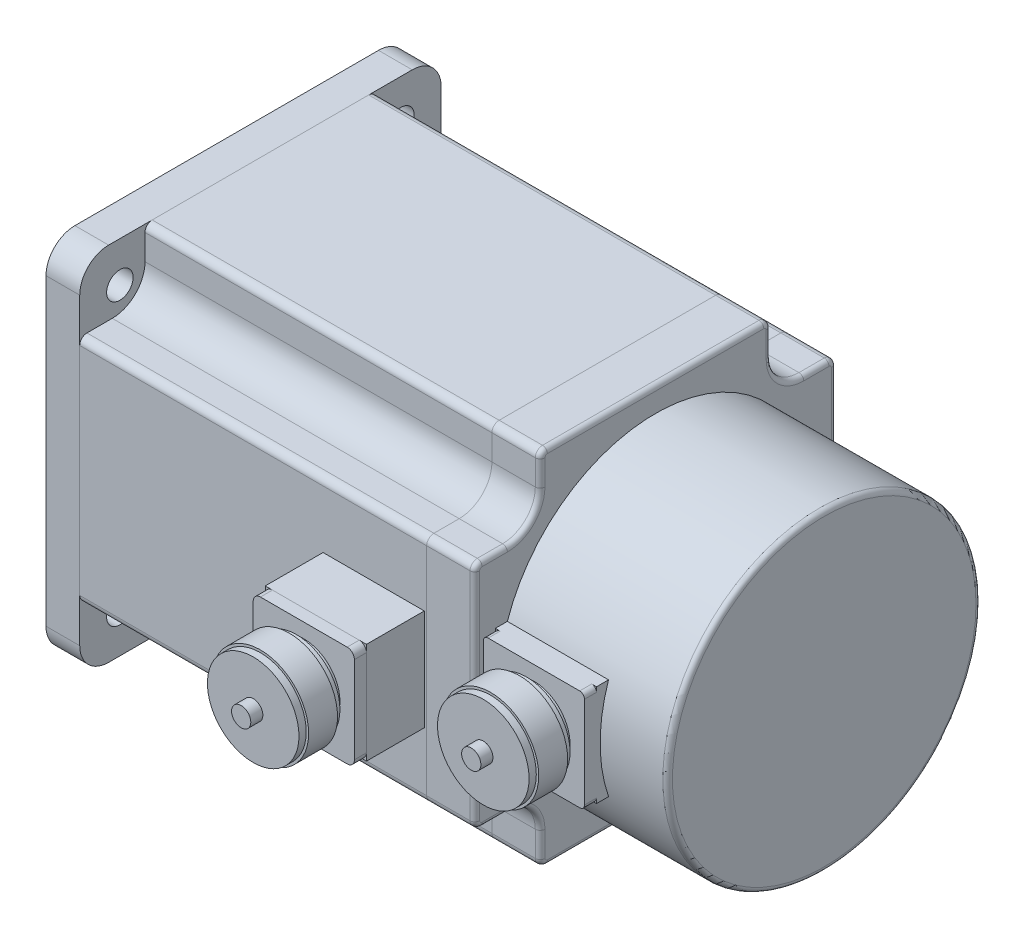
ISO-10303-21;
HEADER;
FILE_DESCRIPTION(('STEP AP214'),'2;1');
FILE_NAME('part.step','',(''),(''),'','','');
FILE_SCHEMA(('AUTOMOTIVE_DESIGN { 1 0 10303 214 1 1 1 1 }'));
ENDSEC;
DATA;
#1=APPLICATION_CONTEXT('core data for automotive mechanical design processes');
#2=APPLICATION_PROTOCOL_DEFINITION('international standard','automotive_design',2000,#1);
#3=PRODUCT_CONTEXT('',#1,'mechanical');
#4=PRODUCT('Part','Part','',(#3));
#5=PRODUCT_RELATED_PRODUCT_CATEGORY('part','',(#4));
#6=PRODUCT_DEFINITION_FORMATION('','',#4);
#7=PRODUCT_DEFINITION_CONTEXT('part definition',#1,'design');
#8=PRODUCT_DEFINITION('design','',#6,#7);
#9=PRODUCT_DEFINITION_SHAPE('','',#8);
#10=(LENGTH_UNIT() NAMED_UNIT(*) SI_UNIT(.MILLI.,.METRE.));
#11=(NAMED_UNIT(*) PLANE_ANGLE_UNIT() SI_UNIT($,.RADIAN.));
#12=(NAMED_UNIT(*) SI_UNIT($,.STERADIAN.) SOLID_ANGLE_UNIT());
#13=UNCERTAINTY_MEASURE_WITH_UNIT(LENGTH_MEASURE(1.E-05),#10,'distance_accuracy_value','');
#14=(GEOMETRIC_REPRESENTATION_CONTEXT(3) GLOBAL_UNCERTAINTY_ASSIGNED_CONTEXT((#13)) GLOBAL_UNIT_ASSIGNED_CONTEXT((#10,
#11,#12)) REPRESENTATION_CONTEXT('',''));
#15=CARTESIAN_POINT('',(0.,0.,0.));
#16=DIRECTION('',(0.,0.,1.));
#17=DIRECTION('',(1.,0.,0.));
#18=AXIS2_PLACEMENT_3D('',#15,#16,#17);
#19=CARTESIAN_POINT('',(-208.,-17.,0.));
#20=DIRECTION('',(0.,1.,0.));
#21=DIRECTION('',(0.,0.,1.));
#22=AXIS2_PLACEMENT_3D('',#19,#20,#21);
#23=CYLINDRICAL_SURFACE('',#22,3.99999999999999);
#24=CARTESIAN_POINT('',(-208.,-9.,0.));
#25=DIRECTION('',(0.,-1.,0.));
#26=DIRECTION('',(0.,0.,-1.));
#27=AXIS2_PLACEMENT_3D('',#24,#25,#26);
#28=CIRCLE('',#27,3.99999999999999);
#29=CARTESIAN_POINT('',(-208.,-9.,3.99999999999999));
#30=VERTEX_POINT('',#29);
#31=CARTESIAN_POINT('',(-208.,-9.,-3.99999999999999));
#32=VERTEX_POINT('',#31);
#33=EDGE_CURVE('E109',#30,#32,#28,.T.);
#34=ORIENTED_EDGE('',*,*,#33,.T.);
#35=DIRECTION('',(0.,1.,0.));
#36=VECTOR('',#35,1.);
#37=CARTESIAN_POINT('',(-208.,-17.,-3.99999999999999));
#38=LINE('',#37,#36);
#39=CARTESIAN_POINT('',(-208.,-17.,-3.99999999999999));
#40=VERTEX_POINT('',#39);
#41=EDGE_CURVE('E12',#40,#32,#38,.T.);
#42=ORIENTED_EDGE('',*,*,#41,.F.);
#43=CARTESIAN_POINT('',(-208.,-17.,0.));
#44=DIRECTION('',(0.,-1.,0.));
#45=DIRECTION('',(0.,0.,-1.));
#46=AXIS2_PLACEMENT_3D('',#43,#44,#45);
#47=CIRCLE('',#46,3.99999999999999);
#48=CARTESIAN_POINT('',(-208.,-17.,3.99999999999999));
#49=VERTEX_POINT('',#48);
#50=EDGE_CURVE('E97',#49,#40,#47,.T.);
#51=ORIENTED_EDGE('',*,*,#50,.F.);
#52=DIRECTION('',(0.,1.,0.));
#53=VECTOR('',#52,1.);
#54=CARTESIAN_POINT('',(-208.,-17.,3.99999999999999));
#55=LINE('',#54,#53);
#56=EDGE_CURVE('E105',#49,#30,#55,.T.);
#57=ORIENTED_EDGE('',*,*,#56,.T.);
#58=EDGE_LOOP('',(#34,#42,#51,#57));
#59=FACE_BOUND('',#58,.T.);
#60=ADVANCED_FACE('F46',(#59),#23,.T.);
#61=CARTESIAN_POINT('',(-171.,-17.,-3.99999999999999));
#62=DIRECTION('',(0.,0.,1.));
#63=DIRECTION('',(1.,0.,0.));
#64=AXIS2_PLACEMENT_3D('',#61,#62,#63);
#65=PLANE('',#64);
#66=DIRECTION('',(1.,0.,0.));
#67=VECTOR('',#66,1.);
#68=CARTESIAN_POINT('',(-171.,-9.,-3.99999999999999));
#69=LINE('',#68,#67);
#70=CARTESIAN_POINT('',(-171.,-9.,-3.99999999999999));
#71=VERTEX_POINT('',#70);
#72=EDGE_CURVE('E101',#32,#71,#69,.T.);
#73=ORIENTED_EDGE('',*,*,#72,.T.);
#74=DIRECTION('',(0.,1.,0.));
#75=VECTOR('',#74,1.);
#76=CARTESIAN_POINT('',(-171.,-17.,-3.99999999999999));
#77=LINE('',#76,#75);
#78=CARTESIAN_POINT('',(-171.,-17.,-3.99999999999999));
#79=VERTEX_POINT('',#78);
#80=EDGE_CURVE('E54',#79,#71,#77,.T.);
#81=ORIENTED_EDGE('',*,*,#80,.F.);
#82=DIRECTION('',(1.,0.,0.));
#83=VECTOR('',#82,1.);
#84=CARTESIAN_POINT('',(-171.,-17.,-3.99999999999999));
#85=LINE('',#84,#83);
#86=EDGE_CURVE('E92',#40,#79,#85,.T.);
#87=ORIENTED_EDGE('',*,*,#86,.F.);
#88=ORIENTED_EDGE('',*,*,#41,.T.);
#89=EDGE_LOOP('',(#73,#81,#87,#88));
#90=FACE_BOUND('',#89,.T.);
#91=ADVANCED_FACE('F100',(#90),#65,.F.);
#92=CARTESIAN_POINT('',(-171.,-17.,0.));
#93=DIRECTION('',(0.,1.,0.));
#94=DIRECTION('',(0.,0.,1.));
#95=AXIS2_PLACEMENT_3D('',#92,#93,#94);
#96=CYLINDRICAL_SURFACE('',#95,3.99999999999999);
#97=CARTESIAN_POINT('',(-171.,-9.,0.));
#98=DIRECTION('',(0.,-1.,0.));
#99=DIRECTION('',(0.,0.,-1.));
#100=AXIS2_PLACEMENT_3D('',#97,#98,#99);
#101=CIRCLE('',#100,3.99999999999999);
#102=CARTESIAN_POINT('',(-171.,-9.,3.99999999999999));
#103=VERTEX_POINT('',#102);
#104=EDGE_CURVE('E79',#71,#103,#101,.T.);
#105=ORIENTED_EDGE('',*,*,#104,.T.);
#106=DIRECTION('',(0.,1.,0.));
#107=VECTOR('',#106,1.);
#108=CARTESIAN_POINT('',(-171.,-17.,3.99999999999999));
#109=LINE('',#108,#107);
#110=CARTESIAN_POINT('',(-171.,-17.,3.99999999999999));
#111=VERTEX_POINT('',#110);
#112=EDGE_CURVE('E102',#111,#103,#109,.T.);
#113=ORIENTED_EDGE('',*,*,#112,.F.);
#114=CARTESIAN_POINT('',(-171.,-17.,0.));
#115=DIRECTION('',(0.,-1.,0.));
#116=DIRECTION('',(0.,0.,-1.));
#117=AXIS2_PLACEMENT_3D('',#114,#115,#116);
#118=CIRCLE('',#117,3.99999999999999);
#119=EDGE_CURVE('E95',#79,#111,#118,.T.);
#120=ORIENTED_EDGE('',*,*,#119,.F.);
#121=ORIENTED_EDGE('',*,*,#80,.T.);
#122=EDGE_LOOP('',(#105,#113,#120,#121));
#123=FACE_BOUND('',#122,.T.);
#124=ADVANCED_FACE('F103',(#123),#96,.T.);
#125=CARTESIAN_POINT('',(-208.,-17.,3.99999999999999));
#126=DIRECTION('',(0.,0.,-1.));
#127=DIRECTION('',(-1.,0.,0.));
#128=AXIS2_PLACEMENT_3D('',#125,#126,#127);
#129=PLANE('',#128);
#130=DIRECTION('',(-1.,0.,0.));
#131=VECTOR('',#130,1.);
#132=CARTESIAN_POINT('',(-208.,-9.,3.99999999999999));
#133=LINE('',#132,#131);
#134=EDGE_CURVE('E85',#103,#30,#133,.T.);
#135=ORIENTED_EDGE('',*,*,#134,.T.);
#136=ORIENTED_EDGE('',*,*,#56,.F.);
#137=DIRECTION('',(-1.,0.,0.));
#138=VECTOR('',#137,1.);
#139=CARTESIAN_POINT('',(-208.,-17.,3.99999999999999));
#140=LINE('',#139,#138);
#141=EDGE_CURVE('E62',#111,#49,#140,.T.);
#142=ORIENTED_EDGE('',*,*,#141,.F.);
#143=ORIENTED_EDGE('',*,*,#112,.T.);
#144=EDGE_LOOP('',(#135,#136,#142,#143));
#145=FACE_BOUND('',#144,.T.);
#146=ADVANCED_FACE('F116',(#145),#129,.F.);
#147=CARTESIAN_POINT('',(-208.,-17.,0.));
#148=DIRECTION('',(0.,-1.,0.));
#149=DIRECTION('',(0.,0.,-1.));
#150=AXIS2_PLACEMENT_3D('',#147,#148,#149);
#151=PLANE('',#150);
#152=ORIENTED_EDGE('',*,*,#50,.T.);
#153=ORIENTED_EDGE('',*,*,#86,.T.);
#154=ORIENTED_EDGE('',*,*,#119,.T.);
#155=ORIENTED_EDGE('',*,*,#141,.T.);
#156=EDGE_LOOP('',(#152,#153,#154,#155));
#157=FACE_BOUND('',#156,.T.);
#158=ADVANCED_FACE('F93',(#157),#151,.T.);
#159=CARTESIAN_POINT('',(-208.,-9.,0.));
#160=DIRECTION('',(0.,-1.,0.));
#161=DIRECTION('',(0.,0.,-1.));
#162=AXIS2_PLACEMENT_3D('',#159,#160,#161);
#163=PLANE('',#162);
#164=ORIENTED_EDGE('',*,*,#33,.F.);
#165=ORIENTED_EDGE('',*,*,#134,.F.);
#166=ORIENTED_EDGE('',*,*,#104,.F.);
#167=ORIENTED_EDGE('',*,*,#72,.F.);
#168=EDGE_LOOP('',(#164,#165,#166,#167));
#169=FACE_BOUND('',#168,.T.);
#170=ADVANCED_FACE('F119',(#169),#163,.F.);
#171=CLOSED_SHELL('',(#60,#91,#124,#146,#158,#170));
#172=MANIFOLD_SOLID_BREP('B2',#171);
#173=CARTESIAN_POINT('',(-216.,0.,0.));
#174=DIRECTION('',(1.,0.,0.));
#175=DIRECTION('',(0.,0.,-1.));
#176=AXIS2_PLACEMENT_3D('',#173,#174,#175);
#177=CYLINDRICAL_SURFACE('',#176,14.);
#178=CARTESIAN_POINT('',(-215.5,0.,0.));
#179=DIRECTION('',(-1.,0.,0.));
#180=DIRECTION('',(0.,0.,1.));
#181=AXIS2_PLACEMENT_3D('',#178,#179,#180);
#182=CIRCLE('',#181,14.);
#183=CARTESIAN_POINT('',(-215.5,0.,14.));
#184=VERTEX_POINT('',#183);
#185=EDGE_CURVE('E255',#184,#184,#182,.F.);
#186=ORIENTED_EDGE('',*,*,#185,.T.);
#187=EDGE_LOOP('',(#186));
#188=FACE_BOUND('',#187,.T.);
#189=CARTESIAN_POINT('',(-163.5,0.,0.));
#190=DIRECTION('',(-1.,0.,0.));
#191=DIRECTION('',(0.,0.,1.));
#192=AXIS2_PLACEMENT_3D('',#189,#190,#191);
#193=CIRCLE('',#192,14.);
#194=CARTESIAN_POINT('',(-163.5,0.,14.));
#195=VERTEX_POINT('',#194);
#196=EDGE_CURVE('E237',#195,#195,#193,.T.);
#197=ORIENTED_EDGE('',*,*,#196,.T.);
#198=EDGE_LOOP('',(#197));
#199=FACE_BOUND('',#198,.T.);
#200=CARTESIAN_POINT('',(-171.,-13.4164078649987,-3.99999999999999));
#201=CARTESIAN_POINT('',(-170.889963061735,-13.4163934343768,-4.00001343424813));
#202=CARTESIAN_POINT('',(-170.779934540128,-13.417761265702,-3.99545969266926));
#203=CARTESIAN_POINT('',(-170.560712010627,-13.4231542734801,-3.97732232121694));
#204=CARTESIAN_POINT('',(-170.451517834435,-13.4271788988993,-3.96374056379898));
#205=CARTESIAN_POINT('',(-170.234991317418,-13.4377658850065,-3.92769415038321));
#206=CARTESIAN_POINT('',(-170.127655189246,-13.4443222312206,-3.90525054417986));
#207=CARTESIAN_POINT('',(-169.915366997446,-13.4597622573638,-3.85169716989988));
#208=CARTESIAN_POINT('',(-169.810414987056,-13.4686459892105,-3.82058720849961));
#209=CARTESIAN_POINT('',(-169.500282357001,-13.4984072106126,-3.71462722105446));
#210=CARTESIAN_POINT('',(-169.299567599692,-13.5224082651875,-3.62710377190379));
#211=CARTESIAN_POINT('',(-168.915683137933,-13.5760110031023,-3.42099335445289));
#212=CARTESIAN_POINT('',(-168.732520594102,-13.6056149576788,-3.30239378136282));
#213=CARTESIAN_POINT('',(-168.383630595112,-13.6680345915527,-3.03385514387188));
#214=CARTESIAN_POINT('',(-168.21847497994,-13.7009134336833,-2.88318637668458));
#215=CARTESIAN_POINT('',(-167.91539864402,-13.7656378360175,-2.55635049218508));
#216=CARTESIAN_POINT('',(-167.777482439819,-13.7974832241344,-2.38017915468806));
#217=CARTESIAN_POINT('',(-167.53034061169,-13.8572672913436,-2.0032879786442));
#218=CARTESIAN_POINT('',(-167.42169609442,-13.885122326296,-1.80217262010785));
#219=CARTESIAN_POINT('',(-167.239992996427,-13.9330517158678,-1.38360719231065));
#220=CARTESIAN_POINT('',(-167.166925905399,-13.9531279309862,-1.16616104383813));
#221=CARTESIAN_POINT('',(-167.060331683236,-13.9827902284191,-0.727119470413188));
#222=CARTESIAN_POINT('',(-167.025822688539,-13.9926363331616,-0.505780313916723));
#223=CARTESIAN_POINT('',(-166.994226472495,-14.0016419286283,-0.0602449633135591));
#224=CARTESIAN_POINT('',(-166.997132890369,-14.0008032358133,0.163950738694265));
#225=CARTESIAN_POINT('',(-167.039612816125,-13.9887201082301,0.601961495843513));
#226=CARTESIAN_POINT('',(-167.078123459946,-13.9777773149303,0.815889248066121));
#227=CARTESIAN_POINT('',(-167.188991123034,-13.9470775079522,1.23410663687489));
#228=CARTESIAN_POINT('',(-167.261349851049,-13.9273200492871,1.43839578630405));
#229=CARTESIAN_POINT('',(-167.438618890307,-13.8807804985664,1.83414901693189));
#230=CARTESIAN_POINT('',(-167.543876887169,-13.853923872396,2.02544821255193));
#231=CARTESIAN_POINT('',(-167.783693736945,-13.7960546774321,2.38801825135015));
#232=CARTESIAN_POINT('',(-167.918258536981,-13.7650412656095,2.55928501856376));
#233=CARTESIAN_POINT('',(-168.218386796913,-13.7009177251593,2.88324485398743));
#234=CARTESIAN_POINT('',(-168.384870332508,-13.6677722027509,3.03507809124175));
#235=CARTESIAN_POINT('',(-168.741426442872,-13.6040627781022,3.30897556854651));
#236=CARTESIAN_POINT('',(-168.931505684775,-13.573499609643,3.43103136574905));
#237=CARTESIAN_POINT('',(-169.231158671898,-13.5321405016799,3.58945338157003));
#238=CARTESIAN_POINT('',(-169.333989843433,-13.5190503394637,3.63832313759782));
#239=CARTESIAN_POINT('',(-169.543626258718,-13.4948216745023,3.72718558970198));
#240=CARTESIAN_POINT('',(-169.650429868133,-13.4836823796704,3.76718189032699));
#241=CARTESIAN_POINT('',(-169.867138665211,-13.463719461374,3.83791732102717));
#242=CARTESIAN_POINT('',(-169.977040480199,-13.4548934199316,3.86866612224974));
#243=CARTESIAN_POINT('',(-170.199195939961,-13.4398293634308,3.92067829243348));
#244=CARTESIAN_POINT('',(-170.311448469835,-13.4335901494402,3.94194605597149));
#245=CARTESIAN_POINT('',(-170.519732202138,-13.4246640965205,3.97223001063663));
#246=CARTESIAN_POINT('',(-170.615545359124,-13.4215735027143,3.98264484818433));
#247=CARTESIAN_POINT('',(-170.807569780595,-13.4174428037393,3.99652828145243));
#248=CARTESIAN_POINT('',(-170.903780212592,-13.4163995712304,4.0000074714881));
#249=CARTESIAN_POINT('',(-171.,-13.4164078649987,3.99999999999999));
#250=B_SPLINE_CURVE_WITH_KNOTS('',3,(#200,#201,#202,#203,#204,#205,#206,#207,#208,#209,#210,
#211,#212,#213,#214,#215,#216,#217,#218,#219,#220,#221,#222,#223,#224,#225,#226,#227,#228,#229,
#230,#231,#232,#233,#234,#235,#236,#237,#238,#239,#240,#241,#242,#243,#244,#245,#246,#247,#248,
#249),.UNSPECIFIED.,.F.,.F.,(4,2,2,2,2,2,2,2,2,2,2,2,2,2,2,2,2,2,2,2,2,2,2,2,4),(0.,
0.329993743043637,0.659919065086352,0.98906537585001,1.31821902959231,1.97575167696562,
2.6335514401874,3.30832474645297,3.98320984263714,4.67064278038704,5.35791119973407,
6.02724874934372,6.6964725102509,7.34634193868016,7.99624417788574,8.65326120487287,
9.31041168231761,9.99056134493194,10.6709036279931,11.0143588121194,11.357674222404,
11.700629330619,12.0434253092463,12.3324405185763,12.6210139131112),.UNSPECIFIED.);
#251=CARTESIAN_POINT('',(-171.,-13.4164078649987,-3.99999999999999));
#252=VERTEX_POINT('',#251);
#253=CARTESIAN_POINT('',(-171.,-13.4164078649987,3.99999999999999));
#254=VERTEX_POINT('',#253);
#255=EDGE_CURVE('E258',#252,#254,#250,.T.);
#256=ORIENTED_EDGE('',*,*,#255,.F.);
#257=DIRECTION('',(1.,0.,0.));
#258=VECTOR('',#257,1.);
#259=CARTESIAN_POINT('',(-216.,-13.4164078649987,-3.99999999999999));
#260=LINE('',#259,#258);
#261=CARTESIAN_POINT('',(-208.,-13.4164078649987,-3.99999999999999));
#262=VERTEX_POINT('',#261);
#263=EDGE_CURVE('E44',#262,#252,#260,.T.);
#264=ORIENTED_EDGE('',*,*,#263,.F.);
#265=CARTESIAN_POINT('',(-208.,-13.4164078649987,3.99999999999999));
#266=CARTESIAN_POINT('',(-208.110036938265,-13.4163934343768,4.00001343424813));
#267=CARTESIAN_POINT('',(-208.220065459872,-13.417761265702,3.99545969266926));
#268=CARTESIAN_POINT('',(-208.439287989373,-13.4231542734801,3.97732232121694));
#269=CARTESIAN_POINT('',(-208.548482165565,-13.4271788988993,3.96374056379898));
#270=CARTESIAN_POINT('',(-208.765008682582,-13.4377658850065,3.9276941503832));
#271=CARTESIAN_POINT('',(-208.872344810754,-13.4443222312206,3.90525054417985));
#272=CARTESIAN_POINT('',(-209.084633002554,-13.4597622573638,3.85169716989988));
#273=CARTESIAN_POINT('',(-209.189585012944,-13.4686459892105,3.8205872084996));
#274=CARTESIAN_POINT('',(-209.499717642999,-13.4984072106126,3.71462722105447));
#275=CARTESIAN_POINT('',(-209.700432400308,-13.5224082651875,3.62710377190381));
#276=CARTESIAN_POINT('',(-210.084316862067,-13.5760110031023,3.42099335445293));
#277=CARTESIAN_POINT('',(-210.267479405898,-13.6056149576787,3.30239378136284));
#278=CARTESIAN_POINT('',(-210.616369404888,-13.6680345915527,3.03385514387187));
#279=CARTESIAN_POINT('',(-210.78152502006,-13.7009134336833,2.88318637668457));
#280=CARTESIAN_POINT('',(-211.08460135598,-13.7656378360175,2.55635049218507));
#281=CARTESIAN_POINT('',(-211.222517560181,-13.7974832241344,2.38017915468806));
#282=CARTESIAN_POINT('',(-211.46965938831,-13.8572672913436,2.00328797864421));
#283=CARTESIAN_POINT('',(-211.57830390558,-13.885122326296,1.80217262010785));
#284=CARTESIAN_POINT('',(-211.760007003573,-13.9330517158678,1.38360719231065));
#285=CARTESIAN_POINT('',(-211.833074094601,-13.9531279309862,1.16616104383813));
#286=CARTESIAN_POINT('',(-211.939668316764,-13.9827902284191,0.727119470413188));
#287=CARTESIAN_POINT('',(-211.974177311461,-13.9926363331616,0.505780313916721));
#288=CARTESIAN_POINT('',(-212.005773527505,-14.0016419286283,0.0602449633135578));
#289=CARTESIAN_POINT('',(-212.002867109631,-14.0008032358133,-0.163950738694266));
#290=CARTESIAN_POINT('',(-211.960387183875,-13.9887201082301,-0.601961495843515));
#291=CARTESIAN_POINT('',(-211.921876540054,-13.9777773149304,-0.815889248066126));
#292=CARTESIAN_POINT('',(-211.811008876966,-13.9470775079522,-1.2341066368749));
#293=CARTESIAN_POINT('',(-211.738650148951,-13.9273200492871,-1.43839578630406));
#294=CARTESIAN_POINT('',(-211.561381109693,-13.8807804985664,-1.83414901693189));
#295=CARTESIAN_POINT('',(-211.456123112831,-13.853923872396,-2.02544821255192));
#296=CARTESIAN_POINT('',(-211.216306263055,-13.7960546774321,-2.38801825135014));
#297=CARTESIAN_POINT('',(-211.081741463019,-13.7650412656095,-2.55928501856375));
#298=CARTESIAN_POINT('',(-210.781613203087,-13.7009177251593,-2.88324485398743));
#299=CARTESIAN_POINT('',(-210.615129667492,-13.6677722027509,-3.03507809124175));
#300=CARTESIAN_POINT('',(-210.258573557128,-13.6040627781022,-3.30897556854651));
#301=CARTESIAN_POINT('',(-210.068494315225,-13.573499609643,-3.43103136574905));
#302=CARTESIAN_POINT('',(-209.768841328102,-13.5321405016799,-3.58945338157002));
#303=CARTESIAN_POINT('',(-209.666010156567,-13.5190503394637,-3.63832313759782));
#304=CARTESIAN_POINT('',(-209.456373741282,-13.4948216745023,-3.72718558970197));
#305=CARTESIAN_POINT('',(-209.349570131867,-13.4836823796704,-3.76718189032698));
#306=CARTESIAN_POINT('',(-209.132861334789,-13.463719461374,-3.83791732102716));
#307=CARTESIAN_POINT('',(-209.022959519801,-13.4548934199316,-3.86866612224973));
#308=CARTESIAN_POINT('',(-208.800804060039,-13.4398293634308,-3.92067829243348));
#309=CARTESIAN_POINT('',(-208.688551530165,-13.4335901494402,-3.94194605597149));
#310=CARTESIAN_POINT('',(-208.480267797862,-13.4246640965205,-3.97223001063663));
#311=CARTESIAN_POINT('',(-208.384454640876,-13.4215735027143,-3.98264484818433));
#312=CARTESIAN_POINT('',(-208.192430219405,-13.4174428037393,-3.99652828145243));
#313=CARTESIAN_POINT('',(-208.096219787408,-13.4163995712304,-4.0000074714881));
#314=CARTESIAN_POINT('',(-208.,-13.4164078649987,-3.99999999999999));
#315=B_SPLINE_CURVE_WITH_KNOTS('',3,(#265,#266,#267,#268,#269,#270,#271,#272,#273,#274,#275,
#276,#277,#278,#279,#280,#281,#282,#283,#284,#285,#286,#287,#288,#289,#290,#291,#292,#293,#294,
#295,#296,#297,#298,#299,#300,#301,#302,#303,#304,#305,#306,#307,#308,#309,#310,#311,#312,#313,
#314),.UNSPECIFIED.,.F.,.F.,(4,2,2,2,2,2,2,2,2,2,2,2,2,2,2,2,2,2,2,2,2,2,2,2,4),(0.,
0.329993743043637,0.65991906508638,0.989065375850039,1.31821902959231,1.97575167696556,
2.6335514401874,3.30832474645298,3.98320984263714,4.67064278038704,5.35791119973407,
6.02724874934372,6.69647251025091,7.34634193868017,7.99624417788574,8.65326120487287,
9.31041168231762,9.99056134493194,10.6709036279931,11.0143588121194,11.357674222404,
11.700629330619,12.0434253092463,12.3324405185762,12.6210139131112),.UNSPECIFIED.);
#316=CARTESIAN_POINT('',(-208.,-13.4164078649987,3.99999999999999));
#317=VERTEX_POINT('',#316);
#318=EDGE_CURVE('E186',#317,#262,#315,.T.);
#319=ORIENTED_EDGE('',*,*,#318,.F.);
#320=DIRECTION('',(1.,0.,0.));
#321=VECTOR('',#320,1.);
#322=CARTESIAN_POINT('',(-216.,-13.4164078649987,3.99999999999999));
#323=LINE('',#322,#321);
#324=EDGE_CURVE('E236',#254,#317,#323,.F.);
#325=ORIENTED_EDGE('',*,*,#324,.F.);
#326=EDGE_LOOP('',(#256,#264,#319,#325));
#327=FACE_BOUND('',#326,.T.);
#328=ADVANCED_FACE('F178',(#188,#199,#327),#177,.T.);
#329=CARTESIAN_POINT('',(-163.5,0.,0.));
#330=DIRECTION('',(-1.,0.,0.));
#331=DIRECTION('',(0.,0.,1.));
#332=AXIS2_PLACEMENT_3D('',#329,#330,#331);
#333=PLANE('',#332);
#334=CARTESIAN_POINT('',(-163.5,0.,0.));
#335=DIRECTION('',(-1.,0.,0.));
#336=DIRECTION('',(0.,0.,1.));
#337=AXIS2_PLACEMENT_3D('',#334,#335,#336);
#338=CIRCLE('',#337,17.);
#339=CARTESIAN_POINT('',(-163.5,0.,17.));
#340=VERTEX_POINT('',#339);
#341=EDGE_CURVE('E249',#340,#340,#338,.T.);
#342=ORIENTED_EDGE('',*,*,#341,.T.);
#343=EDGE_LOOP('',(#342));
#344=FACE_BOUND('',#343,.T.);
#345=ORIENTED_EDGE('',*,*,#196,.F.);
#346=EDGE_LOOP('',(#345));
#347=FACE_BOUND('',#346,.T.);
#348=ADVANCED_FACE('F295',(#344,#347),#333,.T.);
#349=CARTESIAN_POINT('',(-163.,0.,0.));
#350=DIRECTION('',(-1.,0.,0.));
#351=DIRECTION('',(0.,0.,1.));
#352=AXIS2_PLACEMENT_3D('',#349,#350,#351);
#353=PLANE('',#352);
#354=CARTESIAN_POINT('',(-163.,0.,0.));
#355=DIRECTION('',(-1.,0.,0.));
#356=DIRECTION('',(0.,0.,1.));
#357=AXIS2_PLACEMENT_3D('',#354,#355,#356);
#358=CIRCLE('',#357,17.5);
#359=CARTESIAN_POINT('',(-163.,0.,17.5));
#360=VERTEX_POINT('',#359);
#361=EDGE_CURVE('E241',#360,#360,#358,.T.);
#362=ORIENTED_EDGE('',*,*,#361,.F.);
#363=EDGE_LOOP('',(#362));
#364=FACE_BOUND('',#363,.T.);
#365=ADVANCED_FACE('F300',(#364),#353,.F.);
#366=CARTESIAN_POINT('',(-163.,0.,0.));
#367=DIRECTION('',(-1.,0.,0.));
#368=DIRECTION('',(0.,0.,1.));
#369=AXIS2_PLACEMENT_3D('',#366,#367,#368);
#370=TOROIDAL_SURFACE('',#369,17.,0.5);
#371=ORIENTED_EDGE('',*,*,#361,.T.);
#372=EDGE_LOOP('',(#371));
#373=FACE_BOUND('',#372,.T.);
#374=ORIENTED_EDGE('',*,*,#341,.F.);
#375=EDGE_LOOP('',(#374));
#376=FACE_BOUND('',#375,.T.);
#377=ADVANCED_FACE('F312',(#373,#376),#370,.T.);
#378=CARTESIAN_POINT('',(-216.,0.,0.));
#379=DIRECTION('',(-1.,0.,0.));
#380=DIRECTION('',(0.,0.,1.));
#381=AXIS2_PLACEMENT_3D('',#378,#379,#380);
#382=PLANE('',#381);
#383=CARTESIAN_POINT('',(-216.,0.,0.));
#384=DIRECTION('',(-1.,0.,0.));
#385=DIRECTION('',(0.,0.,1.));
#386=AXIS2_PLACEMENT_3D('',#383,#384,#385);
#387=CIRCLE('',#386,13.5);
#388=CARTESIAN_POINT('',(-216.,0.,13.5));
#389=VERTEX_POINT('',#388);
#390=EDGE_CURVE('E252',#389,#389,#387,.T.);
#391=ORIENTED_EDGE('',*,*,#390,.T.);
#392=EDGE_LOOP('',(#391));
#393=FACE_BOUND('',#392,.T.);
#394=ADVANCED_FACE('F280',(#393),#382,.T.);
#395=CARTESIAN_POINT('',(-216.,0.,0.));
#396=DIRECTION('',(1.,0.,0.));
#397=DIRECTION('',(0.,0.,-1.));
#398=AXIS2_PLACEMENT_3D('',#395,#396,#397);
#399=CONICAL_SURFACE('',#398,13.5,0.785398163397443);
#400=ORIENTED_EDGE('',*,*,#185,.F.);
#401=EDGE_LOOP('',(#400));
#402=FACE_BOUND('',#401,.T.);
#403=ORIENTED_EDGE('',*,*,#390,.F.);
#404=EDGE_LOOP('',(#403));
#405=FACE_BOUND('',#404,.T.);
#406=ADVANCED_FACE('F180',(#402,#405),#399,.T.);
#407=CARTESIAN_POINT('',(-208.,-9.,0.));
#408=DIRECTION('',(0.,-1.,0.));
#409=DIRECTION('',(0.,0.,-1.));
#410=AXIS2_PLACEMENT_3D('',#407,#408,#409);
#411=CYLINDRICAL_SURFACE('',#410,3.99999999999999);
#412=DIRECTION('',(0.,-1.,0.));
#413=VECTOR('',#412,1.);
#414=CARTESIAN_POINT('',(-208.,-9.,3.99999999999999));
#415=LINE('',#414,#413);
#416=CARTESIAN_POINT('',(-208.,-9.,3.99999999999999));
#417=VERTEX_POINT('',#416);
#418=EDGE_CURVE('E233',#417,#317,#415,.T.);
#419=ORIENTED_EDGE('',*,*,#418,.T.);
#420=ORIENTED_EDGE('',*,*,#318,.T.);
#421=DIRECTION('',(0.,-1.,0.));
#422=VECTOR('',#421,1.);
#423=CARTESIAN_POINT('',(-208.,-9.,-3.99999999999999));
#424=LINE('',#423,#422);
#425=CARTESIAN_POINT('',(-208.,-9.,-3.99999999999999));
#426=VERTEX_POINT('',#425);
#427=EDGE_CURVE('E192',#426,#262,#424,.T.);
#428=ORIENTED_EDGE('',*,*,#427,.F.);
#429=CARTESIAN_POINT('',(-208.,-9.,0.));
#430=DIRECTION('',(0.,1.,0.));
#431=DIRECTION('',(0.,0.,1.));
#432=AXIS2_PLACEMENT_3D('',#429,#430,#431);
#433=CIRCLE('',#432,3.99999999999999);
#434=EDGE_CURVE('E223',#426,#417,#433,.T.);
#435=ORIENTED_EDGE('',*,*,#434,.T.);
#436=EDGE_LOOP('',(#419,#420,#428,#435));
#437=FACE_BOUND('',#436,.T.);
#438=ADVANCED_FACE('F232',(#437),#411,.F.);
#439=CARTESIAN_POINT('',(-208.,-9.,3.99999999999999));
#440=DIRECTION('',(0.,0.,-1.));
#441=DIRECTION('',(-1.,0.,0.));
#442=AXIS2_PLACEMENT_3D('',#439,#440,#441);
#443=PLANE('',#442);
#444=ORIENTED_EDGE('',*,*,#324,.T.);
#445=ORIENTED_EDGE('',*,*,#418,.F.);
#446=DIRECTION('',(1.,0.,0.));
#447=VECTOR('',#446,1.);
#448=CARTESIAN_POINT('',(-208.,-9.,3.99999999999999));
#449=LINE('',#448,#447);
#450=CARTESIAN_POINT('',(-171.,-9.,3.99999999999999));
#451=VERTEX_POINT('',#450);
#452=EDGE_CURVE('E219',#417,#451,#449,.T.);
#453=ORIENTED_EDGE('',*,*,#452,.T.);
#454=DIRECTION('',(0.,-1.,0.));
#455=VECTOR('',#454,1.);
#456=CARTESIAN_POINT('',(-171.,-9.,3.99999999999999));
#457=LINE('',#456,#455);
#458=EDGE_CURVE('E238',#451,#254,#457,.T.);
#459=ORIENTED_EDGE('',*,*,#458,.T.);
#460=EDGE_LOOP('',(#444,#445,#453,#459));
#461=FACE_BOUND('',#460,.T.);
#462=ADVANCED_FACE('F235',(#461),#443,.T.);
#463=CARTESIAN_POINT('',(-171.,-9.,0.));
#464=DIRECTION('',(0.,-1.,0.));
#465=DIRECTION('',(0.,0.,-1.));
#466=AXIS2_PLACEMENT_3D('',#463,#464,#465);
#467=CYLINDRICAL_SURFACE('',#466,3.99999999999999);
#468=DIRECTION('',(0.,-1.,0.));
#469=VECTOR('',#468,1.);
#470=CARTESIAN_POINT('',(-171.,-9.,-3.99999999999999));
#471=LINE('',#470,#469);
#472=CARTESIAN_POINT('',(-171.,-9.,-3.99999999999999));
#473=VERTEX_POINT('',#472);
#474=EDGE_CURVE('E243',#473,#252,#471,.T.);
#475=ORIENTED_EDGE('',*,*,#474,.T.);
#476=ORIENTED_EDGE('',*,*,#255,.T.);
#477=ORIENTED_EDGE('',*,*,#458,.F.);
#478=CARTESIAN_POINT('',(-171.,-9.,0.));
#479=DIRECTION('',(0.,1.,0.));
#480=DIRECTION('',(0.,0.,1.));
#481=AXIS2_PLACEMENT_3D('',#478,#479,#480);
#482=CIRCLE('',#481,3.99999999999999);
#483=EDGE_CURVE('E224',#451,#473,#482,.T.);
#484=ORIENTED_EDGE('',*,*,#483,.T.);
#485=EDGE_LOOP('',(#475,#476,#477,#484));
#486=FACE_BOUND('',#485,.T.);
#487=ADVANCED_FACE('F268',(#486),#467,.F.);
#488=CARTESIAN_POINT('',(-171.,-9.,-3.99999999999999));
#489=DIRECTION('',(0.,0.,1.));
#490=DIRECTION('',(1.,0.,0.));
#491=AXIS2_PLACEMENT_3D('',#488,#489,#490);
#492=PLANE('',#491);
#493=ORIENTED_EDGE('',*,*,#263,.T.);
#494=ORIENTED_EDGE('',*,*,#474,.F.);
#495=DIRECTION('',(-1.,0.,0.));
#496=VECTOR('',#495,1.);
#497=CARTESIAN_POINT('',(-171.,-9.,-3.99999999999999));
#498=LINE('',#497,#496);
#499=EDGE_CURVE('E286',#473,#426,#498,.T.);
#500=ORIENTED_EDGE('',*,*,#499,.T.);
#501=ORIENTED_EDGE('',*,*,#427,.T.);
#502=EDGE_LOOP('',(#493,#494,#500,#501));
#503=FACE_BOUND('',#502,.T.);
#504=ADVANCED_FACE('F273',(#503),#492,.T.);
#505=CARTESIAN_POINT('',(-208.,-9.,0.));
#506=DIRECTION('',(0.,1.,0.));
#507=DIRECTION('',(0.,0.,1.));
#508=AXIS2_PLACEMENT_3D('',#505,#506,#507);
#509=PLANE('',#508);
#510=ORIENTED_EDGE('',*,*,#434,.F.);
#511=ORIENTED_EDGE('',*,*,#499,.F.);
#512=ORIENTED_EDGE('',*,*,#483,.F.);
#513=ORIENTED_EDGE('',*,*,#452,.F.);
#514=EDGE_LOOP('',(#510,#511,#512,#513));
#515=FACE_BOUND('',#514,.T.);
#516=ADVANCED_FACE('F221',(#515),#509,.F.);
#517=CLOSED_SHELL('',(#328,#348,#365,#377,#394,#406,#438,#462,#487,#504,#516));
#518=MANIFOLD_SOLID_BREP('B6',#517);
#519=CARTESIAN_POINT('',(-22.,0.,125.));
#520=DIRECTION('',(0.,0.,1.));
#521=DIRECTION('',(1.,0.,0.));
#522=AXIS2_PLACEMENT_3D('',#519,#520,#521);
#523=PLANE('',#522);
#524=CARTESIAN_POINT('',(-22.,0.,125.));
#525=DIRECTION('',(0.,0.,1.));
#526=DIRECTION('',(1.,0.,0.));
#527=AXIS2_PLACEMENT_3D('',#524,#525,#526);
#528=CIRCLE('',#527,19.);
#529=CARTESIAN_POINT('',(-3.,0.,125.));
#530=VERTEX_POINT('',#529);
#531=EDGE_CURVE('E406',#530,#530,#528,.T.);
#532=ORIENTED_EDGE('',*,*,#531,.T.);
#533=EDGE_LOOP('',(#532));
#534=FACE_BOUND('',#533,.T.);
#535=CARTESIAN_POINT('',(-22.,0.,125.));
#536=DIRECTION('',(0.,0.,1.));
#537=DIRECTION('',(1.,0.,0.));
#538=AXIS2_PLACEMENT_3D('',#535,#536,#537);
#539=CIRCLE('',#538,4.);
#540=CARTESIAN_POINT('',(-18.,0.,125.));
#541=VERTEX_POINT('',#540);
#542=EDGE_CURVE('E414',#541,#541,#539,.T.);
#543=ORIENTED_EDGE('',*,*,#542,.F.);
#544=EDGE_LOOP('',(#543));
#545=FACE_BOUND('',#544,.T.);
#546=ADVANCED_FACE('F395',(#534,#545),#523,.T.);
#547=CARTESIAN_POINT('',(-22.,0.,122.));
#548=DIRECTION('',(0.,0.,1.));
#549=DIRECTION('',(1.,0.,0.));
#550=AXIS2_PLACEMENT_3D('',#547,#548,#549);
#551=PLANE('',#550);
#552=CARTESIAN_POINT('',(-22.,0.,122.));
#553=DIRECTION('',(0.,0.,1.));
#554=DIRECTION('',(1.,0.,0.));
#555=AXIS2_PLACEMENT_3D('',#552,#553,#554);
#556=CIRCLE('',#555,20.);
#557=CARTESIAN_POINT('',(-2.,0.,122.));
#558=VERTEX_POINT('',#557);
#559=EDGE_CURVE('E177',#558,#558,#556,.T.);
#560=ORIENTED_EDGE('',*,*,#559,.T.);
#561=EDGE_LOOP('',(#560));
#562=FACE_BOUND('',#561,.T.);
#563=CARTESIAN_POINT('',(-22.,0.,122.));
#564=DIRECTION('',(0.,0.,1.));
#565=DIRECTION('',(1.,0.,0.));
#566=AXIS2_PLACEMENT_3D('',#563,#564,#565);
#567=CIRCLE('',#566,19.);
#568=CARTESIAN_POINT('',(-3.,0.,122.));
#569=VERTEX_POINT('',#568);
#570=EDGE_CURVE('E408',#569,#569,#567,.T.);
#571=ORIENTED_EDGE('',*,*,#570,.F.);
#572=EDGE_LOOP('',(#571));
#573=FACE_BOUND('',#572,.T.);
#574=ADVANCED_FACE('F430',(#562,#573),#551,.T.);
#575=CARTESIAN_POINT('',(-22.,0.,122.));
#576=DIRECTION('',(0.,0.,-1.));
#577=DIRECTION('',(-1.,0.,0.));
#578=AXIS2_PLACEMENT_3D('',#575,#576,#577);
#579=CYLINDRICAL_SURFACE('',#578,20.);
#580=ORIENTED_EDGE('',*,*,#559,.F.);
#581=EDGE_LOOP('',(#580));
#582=FACE_BOUND('',#581,.T.);
#583=CARTESIAN_POINT('',(-22.,0.,110.));
#584=DIRECTION('',(0.,0.,1.));
#585=DIRECTION('',(1.,0.,0.));
#586=AXIS2_PLACEMENT_3D('',#583,#584,#585);
#587=CIRCLE('',#586,20.);
#588=CARTESIAN_POINT('',(-2.,0.,110.));
#589=VERTEX_POINT('',#588);
#590=EDGE_CURVE('E399',#589,#589,#587,.T.);
#591=ORIENTED_EDGE('',*,*,#590,.T.);
#592=EDGE_LOOP('',(#591));
#593=FACE_BOUND('',#592,.T.);
#594=ADVANCED_FACE('F397',(#582,#593),#579,.T.);
#595=CARTESIAN_POINT('',(-22.,0.,110.));
#596=DIRECTION('',(0.,0.,1.));
#597=DIRECTION('',(1.,0.,0.));
#598=AXIS2_PLACEMENT_3D('',#595,#596,#597);
#599=PLANE('',#598);
#600=ORIENTED_EDGE('',*,*,#590,.F.);
#601=EDGE_LOOP('',(#600));
#602=FACE_BOUND('',#601,.T.);
#603=ADVANCED_FACE('F440',(#602),#599,.F.);
#604=CARTESIAN_POINT('',(-22.,0.,125.));
#605=DIRECTION('',(0.,0.,-1.));
#606=DIRECTION('',(-1.,0.,0.));
#607=AXIS2_PLACEMENT_3D('',#604,#605,#606);
#608=CYLINDRICAL_SURFACE('',#607,19.);
#609=ORIENTED_EDGE('',*,*,#531,.F.);
#610=EDGE_LOOP('',(#609));
#611=FACE_BOUND('',#610,.T.);
#612=ORIENTED_EDGE('',*,*,#570,.T.);
#613=EDGE_LOOP('',(#612));
#614=FACE_BOUND('',#613,.T.);
#615=ADVANCED_FACE('F425',(#611,#614),#608,.T.);
#616=CARTESIAN_POINT('',(-22.,0.,130.));
#617=DIRECTION('',(0.,0.,-1.));
#618=DIRECTION('',(-1.,0.,0.));
#619=AXIS2_PLACEMENT_3D('',#616,#617,#618);
#620=CYLINDRICAL_SURFACE('',#619,4.);
#621=CARTESIAN_POINT('',(-22.,0.,130.));
#622=DIRECTION('',(0.,0.,1.));
#623=DIRECTION('',(1.,0.,0.));
#624=AXIS2_PLACEMENT_3D('',#621,#622,#623);
#625=CIRCLE('',#624,4.);
#626=CARTESIAN_POINT('',(-18.,0.,130.));
#627=VERTEX_POINT('',#626);
#628=EDGE_CURVE('E411',#627,#627,#625,.T.);
#629=ORIENTED_EDGE('',*,*,#628,.F.);
#630=EDGE_LOOP('',(#629));
#631=FACE_BOUND('',#630,.T.);
#632=ORIENTED_EDGE('',*,*,#542,.T.);
#633=EDGE_LOOP('',(#632));
#634=FACE_BOUND('',#633,.T.);
#635=ADVANCED_FACE('F422',(#631,#634),#620,.T.);
#636=CARTESIAN_POINT('',(-22.,0.,130.));
#637=DIRECTION('',(0.,0.,1.));
#638=DIRECTION('',(1.,0.,0.));
#639=AXIS2_PLACEMENT_3D('',#636,#637,#638);
#640=PLANE('',#639);
#641=ORIENTED_EDGE('',*,*,#628,.T.);
#642=EDGE_LOOP('',(#641));
#643=FACE_BOUND('',#642,.T.);
#644=ADVANCED_FACE('F420',(#643),#640,.T.);
#645=CLOSED_SHELL('',(#546,#574,#594,#603,#615,#635,#644));
#646=MANIFOLD_SOLID_BREP('B38',#645);
#647=CARTESIAN_POINT('',(-22.,0.,110.));
#648=DIRECTION('',(0.,0.,-1.));
#649=DIRECTION('',(-1.,0.,0.));
#650=AXIS2_PLACEMENT_3D('',#647,#648,#649);
#651=CYLINDRICAL_SURFACE('',#650,18.);
#652=CARTESIAN_POINT('',(-22.,0.,110.));
#653=DIRECTION('',(0.,0.,1.));
#654=DIRECTION('',(1.,0.,0.));
#655=AXIS2_PLACEMENT_3D('',#652,#653,#654);
#656=CIRCLE('',#655,18.);
#657=CARTESIAN_POINT('',(-4.,0.,110.));
#658=VERTEX_POINT('',#657);
#659=EDGE_CURVE('E394',#658,#658,#656,.T.);
#660=ORIENTED_EDGE('',*,*,#659,.F.);
#661=EDGE_LOOP('',(#660));
#662=FACE_BOUND('',#661,.T.);
#663=CARTESIAN_POINT('',(-22.,0.,107.));
#664=DIRECTION('',(0.,0.,1.));
#665=DIRECTION('',(1.,0.,0.));
#666=AXIS2_PLACEMENT_3D('',#663,#664,#665);
#667=CIRCLE('',#666,18.);
#668=CARTESIAN_POINT('',(-4.,0.,107.));
#669=VERTEX_POINT('',#668);
#670=EDGE_CURVE('E507',#669,#669,#667,.T.);
#671=ORIENTED_EDGE('',*,*,#670,.T.);
#672=EDGE_LOOP('',(#671));
#673=FACE_BOUND('',#672,.T.);
#674=ADVANCED_FACE('F504',(#662,#673),#651,.T.);
#675=CARTESIAN_POINT('',(-22.,0.,110.));
#676=DIRECTION('',(0.,0.,1.));
#677=DIRECTION('',(1.,0.,0.));
#678=AXIS2_PLACEMENT_3D('',#675,#676,#677);
#679=PLANE('',#678);
#680=ORIENTED_EDGE('',*,*,#659,.T.);
#681=EDGE_LOOP('',(#680));
#682=FACE_BOUND('',#681,.T.);
#683=ADVANCED_FACE('F519',(#682),#679,.T.);
#684=CARTESIAN_POINT('',(-22.,0.,107.));
#685=DIRECTION('',(0.,0.,1.));
#686=DIRECTION('',(1.,0.,0.));
#687=AXIS2_PLACEMENT_3D('',#684,#685,#686);
#688=PLANE('',#687);
#689=ORIENTED_EDGE('',*,*,#670,.F.);
#690=EDGE_LOOP('',(#689));
#691=FACE_BOUND('',#690,.T.);
#692=ADVANCED_FACE('F517',(#691),#688,.F.);
#693=CLOSED_SHELL('',(#674,#683,#692));
#694=MANIFOLD_SOLID_BREP('B172',#693);
#695=CARTESIAN_POINT('',(-22.,0.,107.));
#696=DIRECTION('',(0.,0.,-1.));
#697=DIRECTION('',(-1.,0.,0.));
#698=AXIS2_PLACEMENT_3D('',#695,#696,#697);
#699=CYLINDRICAL_SURFACE('',#698,15.);
#700=CARTESIAN_POINT('',(-22.,0.,107.));
#701=DIRECTION('',(0.,0.,1.));
#702=DIRECTION('',(1.,0.,0.));
#703=AXIS2_PLACEMENT_3D('',#700,#701,#702);
#704=CIRCLE('',#703,15.);
#705=CARTESIAN_POINT('',(-7.,0.,107.));
#706=VERTEX_POINT('',#705);
#707=EDGE_CURVE('E503',#706,#706,#704,.T.);
#708=ORIENTED_EDGE('',*,*,#707,.F.);
#709=EDGE_LOOP('',(#708));
#710=FACE_BOUND('',#709,.T.);
#711=CARTESIAN_POINT('',(-22.,0.,104.));
#712=DIRECTION('',(0.,0.,1.));
#713=DIRECTION('',(1.,0.,0.));
#714=AXIS2_PLACEMENT_3D('',#711,#712,#713);
#715=CIRCLE('',#714,15.);
#716=CARTESIAN_POINT('',(-7.,0.,104.));
#717=VERTEX_POINT('',#716);
#718=EDGE_CURVE('E558',#717,#717,#715,.T.);
#719=ORIENTED_EDGE('',*,*,#718,.T.);
#720=EDGE_LOOP('',(#719));
#721=FACE_BOUND('',#720,.T.);
#722=ADVANCED_FACE('F555',(#710,#721),#699,.T.);
#723=CARTESIAN_POINT('',(-22.,0.,107.));
#724=DIRECTION('',(0.,0.,1.));
#725=DIRECTION('',(1.,0.,0.));
#726=AXIS2_PLACEMENT_3D('',#723,#724,#725);
#727=PLANE('',#726);
#728=ORIENTED_EDGE('',*,*,#707,.T.);
#729=EDGE_LOOP('',(#728));
#730=FACE_BOUND('',#729,.T.);
#731=ADVANCED_FACE('F570',(#730),#727,.T.);
#732=CARTESIAN_POINT('',(-22.,0.,104.));
#733=DIRECTION('',(0.,0.,1.));
#734=DIRECTION('',(1.,0.,0.));
#735=AXIS2_PLACEMENT_3D('',#732,#733,#734);
#736=PLANE('',#735);
#737=ORIENTED_EDGE('',*,*,#718,.F.);
#738=EDGE_LOOP('',(#737));
#739=FACE_BOUND('',#738,.T.);
#740=ADVANCED_FACE('F568',(#739),#736,.F.);
#741=CLOSED_SHELL('',(#722,#731,#740));
#742=MANIFOLD_SOLID_BREP('B389',#741);
#743=CARTESIAN_POINT('',(-40.,-18.,104.));
#744=DIRECTION('',(0.,0.,-1.));
#745=DIRECTION('',(-1.,0.,0.));
#746=AXIS2_PLACEMENT_3D('',#743,#744,#745);
#747=CYLINDRICAL_SURFACE('',#746,3.);
#748=CARTESIAN_POINT('',(-40.,-18.,99.));
#749=DIRECTION('',(0.,0.,1.));
#750=DIRECTION('',(-1.,0.,0.));
#751=AXIS2_PLACEMENT_3D('',#748,#749,#750);
#752=CIRCLE('',#751,3.);
#753=CARTESIAN_POINT('',(-43.,-18.,99.));
#754=VERTEX_POINT('',#753);
#755=CARTESIAN_POINT('',(-40.,-21.,99.));
#756=VERTEX_POINT('',#755);
#757=EDGE_CURVE('E702',#754,#756,#752,.T.);
#758=ORIENTED_EDGE('',*,*,#757,.T.);
#759=DIRECTION('',(0.,0.,-1.));
#760=VECTOR('',#759,1.);
#761=CARTESIAN_POINT('',(-40.,-21.,104.));
#762=LINE('',#761,#760);
#763=CARTESIAN_POINT('',(-40.,-21.,104.));
#764=VERTEX_POINT('',#763);
#765=EDGE_CURVE('E553',#764,#756,#762,.T.);
#766=ORIENTED_EDGE('',*,*,#765,.F.);
#767=CARTESIAN_POINT('',(-40.,-18.,104.));
#768=DIRECTION('',(0.,0.,1.));
#769=DIRECTION('',(-1.,0.,0.));
#770=AXIS2_PLACEMENT_3D('',#767,#768,#769);
#771=CIRCLE('',#770,3.);
#772=CARTESIAN_POINT('',(-43.,-18.,104.));
#773=VERTEX_POINT('',#772);
#774=EDGE_CURVE('E716',#773,#764,#771,.T.);
#775=ORIENTED_EDGE('',*,*,#774,.F.);
#776=DIRECTION('',(0.,0.,-1.));
#777=VECTOR('',#776,1.);
#778=CARTESIAN_POINT('',(-43.,-18.,104.));
#779=LINE('',#778,#777);
#780=EDGE_CURVE('E698',#773,#754,#779,.T.);
#781=ORIENTED_EDGE('',*,*,#780,.T.);
#782=EDGE_LOOP('',(#758,#766,#775,#781));
#783=FACE_BOUND('',#782,.T.);
#784=ADVANCED_FACE('F606',(#783),#747,.T.);
#785=CARTESIAN_POINT('',(-40.,-21.,104.));
#786=DIRECTION('',(0.,1.,0.));
#787=DIRECTION('',(0.,0.,1.));
#788=AXIS2_PLACEMENT_3D('',#785,#786,#787);
#789=PLANE('',#788);
#790=DIRECTION('',(1.,0.,0.));
#791=VECTOR('',#790,1.);
#792=CARTESIAN_POINT('',(-40.,-21.,99.));
#793=LINE('',#792,#791);
#794=CARTESIAN_POINT('',(-4.00000000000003,-21.,99.));
#795=VERTEX_POINT('',#794);
#796=EDGE_CURVE('E705',#756,#795,#793,.T.);
#797=ORIENTED_EDGE('',*,*,#796,.T.);
#798=DIRECTION('',(0.,0.,-1.));
#799=VECTOR('',#798,1.);
#800=CARTESIAN_POINT('',(-4.00000000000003,-21.,104.));
#801=LINE('',#800,#799);
#802=CARTESIAN_POINT('',(-4.00000000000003,-21.,104.));
#803=VERTEX_POINT('',#802);
#804=EDGE_CURVE('E614',#803,#795,#801,.T.);
#805=ORIENTED_EDGE('',*,*,#804,.F.);
#806=DIRECTION('',(1.,0.,0.));
#807=VECTOR('',#806,1.);
#808=CARTESIAN_POINT('',(-40.,-21.,104.));
#809=LINE('',#808,#807);
#810=EDGE_CURVE('E665',#764,#803,#809,.T.);
#811=ORIENTED_EDGE('',*,*,#810,.F.);
#812=ORIENTED_EDGE('',*,*,#765,.T.);
#813=EDGE_LOOP('',(#797,#805,#811,#812));
#814=FACE_BOUND('',#813,.T.);
#815=ADVANCED_FACE('F751',(#814),#789,.F.);
#816=CARTESIAN_POINT('',(-4.00000000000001,-18.,104.));
#817=DIRECTION('',(0.,0.,-1.));
#818=DIRECTION('',(-1.,0.,0.));
#819=AXIS2_PLACEMENT_3D('',#816,#817,#818);
#820=CYLINDRICAL_SURFACE('',#819,3.);
#821=CARTESIAN_POINT('',(-4.00000000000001,-18.,99.));
#822=DIRECTION('',(0.,0.,1.));
#823=DIRECTION('',(1.,0.,0.));
#824=AXIS2_PLACEMENT_3D('',#821,#822,#823);
#825=CIRCLE('',#824,3.);
#826=CARTESIAN_POINT('',(-1.00000000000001,-18.,99.));
#827=VERTEX_POINT('',#826);
#828=EDGE_CURVE('E707',#795,#827,#825,.T.);
#829=ORIENTED_EDGE('',*,*,#828,.T.);
#830=DIRECTION('',(0.,0.,-1.));
#831=VECTOR('',#830,1.);
#832=CARTESIAN_POINT('',(-1.00000000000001,-18.,104.));
#833=LINE('',#832,#831);
#834=CARTESIAN_POINT('',(-1.00000000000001,-18.,104.));
#835=VERTEX_POINT('',#834);
#836=EDGE_CURVE('E723',#835,#827,#833,.T.);
#837=ORIENTED_EDGE('',*,*,#836,.F.);
#838=CARTESIAN_POINT('',(-4.00000000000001,-18.,104.));
#839=DIRECTION('',(0.,0.,1.));
#840=DIRECTION('',(1.,0.,0.));
#841=AXIS2_PLACEMENT_3D('',#838,#839,#840);
#842=CIRCLE('',#841,3.);
#843=EDGE_CURVE('E731',#803,#835,#842,.T.);
#844=ORIENTED_EDGE('',*,*,#843,.F.);
#845=ORIENTED_EDGE('',*,*,#804,.T.);
#846=EDGE_LOOP('',(#829,#837,#844,#845));
#847=FACE_BOUND('',#846,.T.);
#848=ADVANCED_FACE('F729',(#847),#820,.T.);
#849=CARTESIAN_POINT('',(-1.00000000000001,-18.,104.));
#850=DIRECTION('',(-1.,0.,0.));
#851=DIRECTION('',(0.,0.,1.));
#852=AXIS2_PLACEMENT_3D('',#849,#850,#851);
#853=PLANE('',#852);
#854=DIRECTION('',(0.,1.,0.));
#855=VECTOR('',#854,1.);
#856=CARTESIAN_POINT('',(-1.00000000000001,-18.,99.));
#857=LINE('',#856,#855);
#858=CARTESIAN_POINT('',(-1.00000000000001,18.,99.));
#859=VERTEX_POINT('',#858);
#860=EDGE_CURVE('E709',#827,#859,#857,.T.);
#861=ORIENTED_EDGE('',*,*,#860,.T.);
#862=DIRECTION('',(0.,0.,-1.));
#863=VECTOR('',#862,1.);
#864=CARTESIAN_POINT('',(-1.00000000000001,18.,104.));
#865=LINE('',#864,#863);
#866=CARTESIAN_POINT('',(-1.00000000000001,18.,104.));
#867=VERTEX_POINT('',#866);
#868=EDGE_CURVE('E720',#867,#859,#865,.T.);
#869=ORIENTED_EDGE('',*,*,#868,.F.);
#870=DIRECTION('',(0.,1.,0.));
#871=VECTOR('',#870,1.);
#872=CARTESIAN_POINT('',(-1.00000000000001,-18.,104.));
#873=LINE('',#872,#871);
#874=EDGE_CURVE('E743',#835,#867,#873,.T.);
#875=ORIENTED_EDGE('',*,*,#874,.F.);
#876=ORIENTED_EDGE('',*,*,#836,.T.);
#877=EDGE_LOOP('',(#861,#869,#875,#876));
#878=FACE_BOUND('',#877,.T.);
#879=ADVANCED_FACE('F739',(#878),#853,.F.);
#880=CARTESIAN_POINT('',(-4.00000000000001,18.,104.));
#881=DIRECTION('',(0.,0.,-1.));
#882=DIRECTION('',(-1.,0.,0.));
#883=AXIS2_PLACEMENT_3D('',#880,#881,#882);
#884=CYLINDRICAL_SURFACE('',#883,3.);
#885=CARTESIAN_POINT('',(-4.00000000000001,18.,99.));
#886=DIRECTION('',(0.,0.,1.));
#887=DIRECTION('',(-1.,0.,0.));
#888=AXIS2_PLACEMENT_3D('',#885,#886,#887);
#889=CIRCLE('',#888,3.);
#890=CARTESIAN_POINT('',(-4.00000000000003,21.,99.));
#891=VERTEX_POINT('',#890);
#892=EDGE_CURVE('E711',#859,#891,#889,.T.);
#893=ORIENTED_EDGE('',*,*,#892,.T.);
#894=DIRECTION('',(0.,0.,-1.));
#895=VECTOR('',#894,1.);
#896=CARTESIAN_POINT('',(-4.00000000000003,21.,104.));
#897=LINE('',#896,#895);
#898=CARTESIAN_POINT('',(-4.00000000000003,21.,104.));
#899=VERTEX_POINT('',#898);
#900=EDGE_CURVE('E693',#899,#891,#897,.T.);
#901=ORIENTED_EDGE('',*,*,#900,.F.);
#902=CARTESIAN_POINT('',(-4.00000000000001,18.,104.));
#903=DIRECTION('',(0.,0.,1.));
#904=DIRECTION('',(-1.,0.,0.));
#905=AXIS2_PLACEMENT_3D('',#902,#903,#904);
#906=CIRCLE('',#905,3.);
#907=EDGE_CURVE('E684',#867,#899,#906,.T.);
#908=ORIENTED_EDGE('',*,*,#907,.F.);
#909=ORIENTED_EDGE('',*,*,#868,.T.);
#910=EDGE_LOOP('',(#893,#901,#908,#909));
#911=FACE_BOUND('',#910,.T.);
#912=ADVANCED_FACE('F742',(#911),#884,.T.);
#913=CARTESIAN_POINT('',(-40.,21.,104.));
#914=DIRECTION('',(0.,-1.,0.));
#915=DIRECTION('',(0.,0.,-1.));
#916=AXIS2_PLACEMENT_3D('',#913,#914,#915);
#917=PLANE('',#916);
#918=DIRECTION('',(-1.,0.,0.));
#919=VECTOR('',#918,1.);
#920=CARTESIAN_POINT('',(-40.,21.,99.));
#921=LINE('',#920,#919);
#922=CARTESIAN_POINT('',(-40.,21.,99.));
#923=VERTEX_POINT('',#922);
#924=EDGE_CURVE('E692',#891,#923,#921,.T.);
#925=ORIENTED_EDGE('',*,*,#924,.T.);
#926=DIRECTION('',(0.,0.,-1.));
#927=VECTOR('',#926,1.);
#928=CARTESIAN_POINT('',(-40.,21.,104.));
#929=LINE('',#928,#927);
#930=CARTESIAN_POINT('',(-40.,21.,104.));
#931=VERTEX_POINT('',#930);
#932=EDGE_CURVE('E689',#931,#923,#929,.T.);
#933=ORIENTED_EDGE('',*,*,#932,.F.);
#934=DIRECTION('',(-1.,0.,0.));
#935=VECTOR('',#934,1.);
#936=CARTESIAN_POINT('',(-40.,21.,104.));
#937=LINE('',#936,#935);
#938=EDGE_CURVE('E678',#899,#931,#937,.T.);
#939=ORIENTED_EDGE('',*,*,#938,.F.);
#940=ORIENTED_EDGE('',*,*,#900,.T.);
#941=EDGE_LOOP('',(#925,#933,#939,#940));
#942=FACE_BOUND('',#941,.T.);
#943=ADVANCED_FACE('F690',(#942),#917,.F.);
#944=CARTESIAN_POINT('',(-40.,18.,104.));
#945=DIRECTION('',(0.,0.,-1.));
#946=DIRECTION('',(-1.,0.,0.));
#947=AXIS2_PLACEMENT_3D('',#944,#945,#946);
#948=CYLINDRICAL_SURFACE('',#947,3.);
#949=CARTESIAN_POINT('',(-40.,18.,99.));
#950=DIRECTION('',(0.,0.,1.));
#951=DIRECTION('',(-1.,0.,0.));
#952=AXIS2_PLACEMENT_3D('',#949,#950,#951);
#953=CIRCLE('',#952,3.);
#954=CARTESIAN_POINT('',(-43.,18.,99.));
#955=VERTEX_POINT('',#954);
#956=EDGE_CURVE('E651',#923,#955,#953,.T.);
#957=ORIENTED_EDGE('',*,*,#956,.T.);
#958=DIRECTION('',(0.,0.,-1.));
#959=VECTOR('',#958,1.);
#960=CARTESIAN_POINT('',(-43.,18.,104.));
#961=LINE('',#960,#959);
#962=CARTESIAN_POINT('',(-43.,18.,104.));
#963=VERTEX_POINT('',#962);
#964=EDGE_CURVE('E694',#963,#955,#961,.T.);
#965=ORIENTED_EDGE('',*,*,#964,.F.);
#966=CARTESIAN_POINT('',(-40.,18.,104.));
#967=DIRECTION('',(0.,0.,1.));
#968=DIRECTION('',(-1.,0.,0.));
#969=AXIS2_PLACEMENT_3D('',#966,#967,#968);
#970=CIRCLE('',#969,3.);
#971=EDGE_CURVE('E682',#931,#963,#970,.T.);
#972=ORIENTED_EDGE('',*,*,#971,.F.);
#973=ORIENTED_EDGE('',*,*,#932,.T.);
#974=EDGE_LOOP('',(#957,#965,#972,#973));
#975=FACE_BOUND('',#974,.T.);
#976=ADVANCED_FACE('F696',(#975),#948,.T.);
#977=CARTESIAN_POINT('',(-43.,-18.,104.));
#978=DIRECTION('',(1.,0.,0.));
#979=DIRECTION('',(0.,0.,-1.));
#980=AXIS2_PLACEMENT_3D('',#977,#978,#979);
#981=PLANE('',#980);
#982=DIRECTION('',(0.,-1.,0.));
#983=VECTOR('',#982,1.);
#984=CARTESIAN_POINT('',(-43.,-18.,99.));
#985=LINE('',#984,#983);
#986=EDGE_CURVE('E657',#955,#754,#985,.T.);
#987=ORIENTED_EDGE('',*,*,#986,.T.);
#988=ORIENTED_EDGE('',*,*,#780,.F.);
#989=DIRECTION('',(0.,-1.,0.));
#990=VECTOR('',#989,1.);
#991=CARTESIAN_POINT('',(-43.,-18.,104.));
#992=LINE('',#991,#990);
#993=EDGE_CURVE('E622',#963,#773,#992,.T.);
#994=ORIENTED_EDGE('',*,*,#993,.F.);
#995=ORIENTED_EDGE('',*,*,#964,.T.);
#996=EDGE_LOOP('',(#987,#988,#994,#995));
#997=FACE_BOUND('',#996,.T.);
#998=ADVANCED_FACE('F767',(#997),#981,.F.);
#999=CARTESIAN_POINT('',(-40.,-18.,104.));
#1000=DIRECTION('',(0.,0.,-1.));
#1001=DIRECTION('',(-1.,0.,0.));
#1002=AXIS2_PLACEMENT_3D('',#999,#1000,#1001);
#1003=PLANE('',#1002);
#1004=ORIENTED_EDGE('',*,*,#774,.T.);
#1005=ORIENTED_EDGE('',*,*,#810,.T.);
#1006=ORIENTED_EDGE('',*,*,#843,.T.);
#1007=ORIENTED_EDGE('',*,*,#874,.T.);
#1008=ORIENTED_EDGE('',*,*,#907,.T.);
#1009=ORIENTED_EDGE('',*,*,#938,.T.);
#1010=ORIENTED_EDGE('',*,*,#971,.T.);
#1011=ORIENTED_EDGE('',*,*,#993,.T.);
#1012=EDGE_LOOP('',(#1004,#1005,#1006,#1007,#1008,#1009,#1010,#1011));
#1013=FACE_BOUND('',#1012,.T.);
#1014=ADVANCED_FACE('F680',(#1013),#1003,.F.);
#1015=CARTESIAN_POINT('',(-40.,-18.,99.));
#1016=DIRECTION('',(0.,0.,-1.));
#1017=DIRECTION('',(-1.,0.,0.));
#1018=AXIS2_PLACEMENT_3D('',#1015,#1016,#1017);
#1019=PLANE('',#1018);
#1020=ORIENTED_EDGE('',*,*,#757,.F.);
#1021=ORIENTED_EDGE('',*,*,#986,.F.);
#1022=ORIENTED_EDGE('',*,*,#956,.F.);
#1023=ORIENTED_EDGE('',*,*,#924,.F.);
#1024=ORIENTED_EDGE('',*,*,#892,.F.);
#1025=ORIENTED_EDGE('',*,*,#860,.F.);
#1026=ORIENTED_EDGE('',*,*,#828,.F.);
#1027=ORIENTED_EDGE('',*,*,#796,.F.);
#1028=EDGE_LOOP('',(#1020,#1021,#1022,#1023,#1024,#1025,#1026,#1027));
#1029=FACE_BOUND('',#1028,.T.);
#1030=ADVANCED_FACE('F735',(#1029),#1019,.T.);
#1031=CLOSED_SHELL('',(#784,#815,#848,#879,#912,#943,#976,#998,#1014,#1030));
#1032=MANIFOLD_SOLID_BREP('B498',#1031);
#1033=CARTESIAN_POINT('',(-0.999999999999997,-21.,99.));
#1034=DIRECTION('',(-1.,0.,0.));
#1035=DIRECTION('',(0.,-1.,0.));
#1036=AXIS2_PLACEMENT_3D('',#1033,#1034,#1035);
#1037=PLANE('',#1036);
#1038=DIRECTION('',(0.,1.,0.));
#1039=VECTOR('',#1038,1.);
#1040=CARTESIAN_POINT('',(-0.999999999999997,-21.,75.));
#1041=LINE('',#1040,#1039);
#1042=CARTESIAN_POINT('',(-0.999999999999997,-21.,75.));
#1043=VERTEX_POINT('',#1042);
#1044=CARTESIAN_POINT('',(-1.00000000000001,21.,75.));
#1045=VERTEX_POINT('',#1044);
#1046=EDGE_CURVE('E907',#1043,#1045,#1041,.T.);
#1047=ORIENTED_EDGE('',*,*,#1046,.T.);
#1048=DIRECTION('',(0.,0.,-1.));
#1049=VECTOR('',#1048,1.);
#1050=CARTESIAN_POINT('',(-1.00000000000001,21.,99.));
#1051=LINE('',#1050,#1049);
#1052=CARTESIAN_POINT('',(-1.00000000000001,21.,99.));
#1053=VERTEX_POINT('',#1052);
#1054=EDGE_CURVE('E604',#1053,#1045,#1051,.T.);
#1055=ORIENTED_EDGE('',*,*,#1054,.F.);
#1056=DIRECTION('',(0.,1.,0.));
#1057=VECTOR('',#1056,1.);
#1058=CARTESIAN_POINT('',(-0.999999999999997,-21.,99.));
#1059=LINE('',#1058,#1057);
#1060=CARTESIAN_POINT('',(-0.999999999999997,-21.,99.));
#1061=VERTEX_POINT('',#1060);
#1062=EDGE_CURVE('E895',#1061,#1053,#1059,.T.);
#1063=ORIENTED_EDGE('',*,*,#1062,.F.);
#1064=DIRECTION('',(0.,0.,-1.));
#1065=VECTOR('',#1064,1.);
#1066=CARTESIAN_POINT('',(-0.999999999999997,-21.,99.));
#1067=LINE('',#1066,#1065);
#1068=EDGE_CURVE('E903',#1061,#1043,#1067,.T.);
#1069=ORIENTED_EDGE('',*,*,#1068,.T.);
#1070=EDGE_LOOP('',(#1047,#1055,#1063,#1069));
#1071=FACE_BOUND('',#1070,.T.);
#1072=ADVANCED_FACE('F844',(#1071),#1037,.F.);
#1073=CARTESIAN_POINT('',(-43.,21.,99.));
#1074=DIRECTION('',(0.,-1.,0.));
#1075=DIRECTION('',(0.,0.,-1.));
#1076=AXIS2_PLACEMENT_3D('',#1073,#1074,#1075);
#1077=PLANE('',#1076);
#1078=DIRECTION('',(-1.,0.,0.));
#1079=VECTOR('',#1078,1.);
#1080=CARTESIAN_POINT('',(-43.,21.,75.));
#1081=LINE('',#1080,#1079);
#1082=CARTESIAN_POINT('',(-43.,21.,75.));
#1083=VERTEX_POINT('',#1082);
#1084=EDGE_CURVE('E899',#1045,#1083,#1081,.T.);
#1085=ORIENTED_EDGE('',*,*,#1084,.T.);
#1086=DIRECTION('',(0.,0.,-1.));
#1087=VECTOR('',#1086,1.);
#1088=CARTESIAN_POINT('',(-43.,21.,99.));
#1089=LINE('',#1088,#1087);
#1090=CARTESIAN_POINT('',(-43.,21.,99.));
#1091=VERTEX_POINT('',#1090);
#1092=EDGE_CURVE('E852',#1091,#1083,#1089,.T.);
#1093=ORIENTED_EDGE('',*,*,#1092,.F.);
#1094=DIRECTION('',(-1.,0.,0.));
#1095=VECTOR('',#1094,1.);
#1096=CARTESIAN_POINT('',(-43.,21.,99.));
#1097=LINE('',#1096,#1095);
#1098=EDGE_CURVE('E890',#1053,#1091,#1097,.T.);
#1099=ORIENTED_EDGE('',*,*,#1098,.F.);
#1100=ORIENTED_EDGE('',*,*,#1054,.T.);
#1101=EDGE_LOOP('',(#1085,#1093,#1099,#1100));
#1102=FACE_BOUND('',#1101,.T.);
#1103=ADVANCED_FACE('F898',(#1102),#1077,.F.);
#1104=CARTESIAN_POINT('',(-43.,-21.,99.));
#1105=DIRECTION('',(1.,0.,0.));
#1106=DIRECTION('',(0.,1.,0.));
#1107=AXIS2_PLACEMENT_3D('',#1104,#1105,#1106);
#1108=PLANE('',#1107);
#1109=DIRECTION('',(0.,-1.,0.));
#1110=VECTOR('',#1109,1.);
#1111=CARTESIAN_POINT('',(-43.,-21.,75.));
#1112=LINE('',#1111,#1110);
#1113=CARTESIAN_POINT('',(-43.,-21.,75.));
#1114=VERTEX_POINT('',#1113);
#1115=EDGE_CURVE('E877',#1083,#1114,#1112,.T.);
#1116=ORIENTED_EDGE('',*,*,#1115,.T.);
#1117=DIRECTION('',(0.,0.,-1.));
#1118=VECTOR('',#1117,1.);
#1119=CARTESIAN_POINT('',(-43.,-21.,99.));
#1120=LINE('',#1119,#1118);
#1121=CARTESIAN_POINT('',(-43.,-21.,99.));
#1122=VERTEX_POINT('',#1121);
#1123=EDGE_CURVE('E900',#1122,#1114,#1120,.T.);
#1124=ORIENTED_EDGE('',*,*,#1123,.F.);
#1125=DIRECTION('',(0.,-1.,0.));
#1126=VECTOR('',#1125,1.);
#1127=CARTESIAN_POINT('',(-43.,-21.,99.));
#1128=LINE('',#1127,#1126);
#1129=EDGE_CURVE('E893',#1091,#1122,#1128,.T.);
#1130=ORIENTED_EDGE('',*,*,#1129,.F.);
#1131=ORIENTED_EDGE('',*,*,#1092,.T.);
#1132=EDGE_LOOP('',(#1116,#1124,#1130,#1131));
#1133=FACE_BOUND('',#1132,.T.);
#1134=ADVANCED_FACE('F901',(#1133),#1108,.F.);
#1135=CARTESIAN_POINT('',(-43.,-21.,99.));
#1136=DIRECTION('',(0.,1.,0.));
#1137=DIRECTION('',(0.,0.,1.));
#1138=AXIS2_PLACEMENT_3D('',#1135,#1136,#1137);
#1139=PLANE('',#1138);
#1140=DIRECTION('',(1.,0.,0.));
#1141=VECTOR('',#1140,1.);
#1142=CARTESIAN_POINT('',(-43.,-21.,75.));
#1143=LINE('',#1142,#1141);
#1144=EDGE_CURVE('E883',#1114,#1043,#1143,.T.);
#1145=ORIENTED_EDGE('',*,*,#1144,.T.);
#1146=ORIENTED_EDGE('',*,*,#1068,.F.);
#1147=DIRECTION('',(1.,0.,0.));
#1148=VECTOR('',#1147,1.);
#1149=CARTESIAN_POINT('',(-43.,-21.,99.));
#1150=LINE('',#1149,#1148);
#1151=EDGE_CURVE('E860',#1122,#1061,#1150,.T.);
#1152=ORIENTED_EDGE('',*,*,#1151,.F.);
#1153=ORIENTED_EDGE('',*,*,#1123,.T.);
#1154=EDGE_LOOP('',(#1145,#1146,#1152,#1153));
#1155=FACE_BOUND('',#1154,.T.);
#1156=ADVANCED_FACE('F914',(#1155),#1139,.F.);
#1157=CARTESIAN_POINT('',(0.,0.,99.));
#1158=DIRECTION('',(0.,0.,-1.));
#1159=DIRECTION('',(-1.,0.,0.));
#1160=AXIS2_PLACEMENT_3D('',#1157,#1158,#1159);
#1161=PLANE('',#1160);
#1162=ORIENTED_EDGE('',*,*,#1062,.T.);
#1163=ORIENTED_EDGE('',*,*,#1098,.T.);
#1164=ORIENTED_EDGE('',*,*,#1129,.T.);
#1165=ORIENTED_EDGE('',*,*,#1151,.T.);
#1166=EDGE_LOOP('',(#1162,#1163,#1164,#1165));
#1167=FACE_BOUND('',#1166,.T.);
#1168=ADVANCED_FACE('F891',(#1167),#1161,.F.);
#1169=CARTESIAN_POINT('',(0.,0.,75.));
#1170=DIRECTION('',(0.,0.,-1.));
#1171=DIRECTION('',(-1.,0.,0.));
#1172=AXIS2_PLACEMENT_3D('',#1169,#1170,#1171);
#1173=PLANE('',#1172);
#1174=ORIENTED_EDGE('',*,*,#1046,.F.);
#1175=ORIENTED_EDGE('',*,*,#1144,.F.);
#1176=ORIENTED_EDGE('',*,*,#1115,.F.);
#1177=ORIENTED_EDGE('',*,*,#1084,.F.);
#1178=EDGE_LOOP('',(#1174,#1175,#1176,#1177));
#1179=FACE_BOUND('',#1178,.T.);
#1180=ADVANCED_FACE('F917',(#1179),#1173,.T.);
#1181=CLOSED_SHELL('',(#1072,#1103,#1134,#1156,#1168,#1180));
#1182=MANIFOLD_SOLID_BREP('B547',#1181);
#1183=CARTESIAN_POINT('',(-158.,-63.,-63.));
#1184=DIRECTION('',(1.,0.,0.));
#1185=DIRECTION('',(0.,0.,-1.));
#1186=AXIS2_PLACEMENT_3D('',#1183,#1184,#1185);
#1187=PLANE('',#1186);
#1188=CARTESIAN_POINT('',(-158.,-63.,-63.));
#1189=DIRECTION('',(-1.,0.,0.));
#1190=DIRECTION('',(0.,0.,-1.));
#1191=AXIS2_PLACEMENT_3D('',#1188,#1189,#1190);
#1192=CIRCLE('',#1191,12.);
#1193=CARTESIAN_POINT('',(-158.,-62.9999999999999,-75.));
#1194=VERTEX_POINT('',#1193);
#1195=CARTESIAN_POINT('',(-158.,-75.,-62.9999999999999));
#1196=VERTEX_POINT('',#1195);
#1197=EDGE_CURVE('E1091',#1194,#1196,#1192,.T.);
#1198=ORIENTED_EDGE('',*,*,#1197,.T.);
#1199=DIRECTION('',(0.,0.,1.));
#1200=VECTOR('',#1199,1.);
#1201=CARTESIAN_POINT('',(-158.,-75.,-62.9999999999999));
#1202=LINE('',#1201,#1200);
#1203=CARTESIAN_POINT('',(-158.,-75.,62.9999999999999));
#1204=VERTEX_POINT('',#1203);
#1205=EDGE_CURVE('E1039',#1196,#1204,#1202,.T.);
#1206=ORIENTED_EDGE('',*,*,#1205,.T.);
#1207=CARTESIAN_POINT('',(-158.,-63.,63.));
#1208=DIRECTION('',(-1.,0.,0.));
#1209=DIRECTION('',(0.,0.,1.));
#1210=AXIS2_PLACEMENT_3D('',#1207,#1208,#1209);
#1211=CIRCLE('',#1210,12.);
#1212=CARTESIAN_POINT('',(-158.,-62.9999999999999,75.));
#1213=VERTEX_POINT('',#1212);
#1214=EDGE_CURVE('E1143',#1204,#1213,#1211,.T.);
#1215=ORIENTED_EDGE('',*,*,#1214,.T.);
#1216=DIRECTION('',(0.,1.,0.));
#1217=VECTOR('',#1216,1.);
#1218=CARTESIAN_POINT('',(-158.,-62.9999999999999,75.));
#1219=LINE('',#1218,#1217);
#1220=CARTESIAN_POINT('',(-158.,62.9999999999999,75.));
#1221=VERTEX_POINT('',#1220);
#1222=EDGE_CURVE('E1145',#1213,#1221,#1219,.T.);
#1223=ORIENTED_EDGE('',*,*,#1222,.T.);
#1224=CARTESIAN_POINT('',(-158.,63.,63.));
#1225=DIRECTION('',(-1.,0.,0.));
#1226=DIRECTION('',(0.,0.,-1.));
#1227=AXIS2_PLACEMENT_3D('',#1224,#1225,#1226);
#1228=CIRCLE('',#1227,12.);
#1229=CARTESIAN_POINT('',(-158.,75.,62.9999999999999));
#1230=VERTEX_POINT('',#1229);
#1231=EDGE_CURVE('E1058',#1221,#1230,#1228,.T.);
#1232=ORIENTED_EDGE('',*,*,#1231,.T.);
#1233=DIRECTION('',(0.,0.,-1.));
#1234=VECTOR('',#1233,1.);
#1235=CARTESIAN_POINT('',(-158.,75.,-62.9999999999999));
#1236=LINE('',#1235,#1234);
#1237=CARTESIAN_POINT('',(-158.,75.,-62.9999999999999));
#1238=VERTEX_POINT('',#1237);
#1239=EDGE_CURVE('E1052',#1230,#1238,#1236,.T.);
#1240=ORIENTED_EDGE('',*,*,#1239,.T.);
#1241=CARTESIAN_POINT('',(-158.,63.,-63.));
#1242=DIRECTION('',(-1.,0.,0.));
#1243=DIRECTION('',(0.,0.,-1.));
#1244=AXIS2_PLACEMENT_3D('',#1241,#1242,#1243);
#1245=CIRCLE('',#1244,12.);
#1246=CARTESIAN_POINT('',(-158.,62.9999999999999,-75.));
#1247=VERTEX_POINT('',#1246);
#1248=EDGE_CURVE('E1056',#1238,#1247,#1245,.T.);
#1249=ORIENTED_EDGE('',*,*,#1248,.T.);
#1250=DIRECTION('',(0.,-1.,0.));
#1251=VECTOR('',#1250,1.);
#1252=CARTESIAN_POINT('',(-158.,-62.9999999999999,-75.));
#1253=LINE('',#1252,#1251);
#1254=EDGE_CURVE('E995',#1247,#1194,#1253,.T.);
#1255=ORIENTED_EDGE('',*,*,#1254,.T.);
#1256=EDGE_LOOP('',(#1198,#1206,#1215,#1223,#1232,#1240,#1249,#1255));
#1257=FACE_BOUND('',#1256,.T.);
#1258=CARTESIAN_POINT('',(-158.,58.3363094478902,-58.3363094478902));
#1259=DIRECTION('',(-1.,0.,0.));
#1260=DIRECTION('',(0.,0.,1.));
#1261=AXIS2_PLACEMENT_3D('',#1258,#1259,#1260);
#1262=CIRCLE('',#1261,5.5);
#1263=CARTESIAN_POINT('',(-158.,58.3363094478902,-52.8363094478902));
#1264=VERTEX_POINT('',#1263);
#1265=EDGE_CURVE('E1151',#1264,#1264,#1262,.T.);
#1266=ORIENTED_EDGE('',*,*,#1265,.F.);
#1267=EDGE_LOOP('',(#1266));
#1268=FACE_BOUND('',#1267,.T.);
#1269=CARTESIAN_POINT('',(-158.,58.3363094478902,58.3363094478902));
#1270=DIRECTION('',(-1.,0.,0.));
#1271=DIRECTION('',(0.,0.,1.));
#1272=AXIS2_PLACEMENT_3D('',#1269,#1270,#1271);
#1273=CIRCLE('',#1272,5.5);
#1274=CARTESIAN_POINT('',(-158.,58.3363094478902,63.8363094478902));
#1275=VERTEX_POINT('',#1274);
#1276=EDGE_CURVE('E1157',#1275,#1275,#1273,.T.);
#1277=ORIENTED_EDGE('',*,*,#1276,.F.);
#1278=EDGE_LOOP('',(#1277));
#1279=FACE_BOUND('',#1278,.T.);
#1280=CARTESIAN_POINT('',(-158.,-58.3363094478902,58.3363094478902));
#1281=DIRECTION('',(-1.,0.,0.));
#1282=DIRECTION('',(0.,0.,1.));
#1283=AXIS2_PLACEMENT_3D('',#1280,#1281,#1282);
#1284=CIRCLE('',#1283,5.5);
#1285=CARTESIAN_POINT('',(-158.,-58.3363094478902,63.8363094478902));
#1286=VERTEX_POINT('',#1285);
#1287=EDGE_CURVE('E1163',#1286,#1286,#1284,.T.);
#1288=ORIENTED_EDGE('',*,*,#1287,.F.);
#1289=EDGE_LOOP('',(#1288));
#1290=FACE_BOUND('',#1289,.T.);
#1291=CARTESIAN_POINT('',(-158.,-58.3363094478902,-58.3363094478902));
#1292=DIRECTION('',(-1.,0.,0.));
#1293=DIRECTION('',(0.,0.,1.));
#1294=AXIS2_PLACEMENT_3D('',#1291,#1292,#1293);
#1295=CIRCLE('',#1294,5.5);
#1296=CARTESIAN_POINT('',(-158.,-58.3363094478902,-52.8363094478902));
#1297=VERTEX_POINT('',#1296);
#1298=EDGE_CURVE('E1169',#1297,#1297,#1295,.T.);
#1299=ORIENTED_EDGE('',*,*,#1298,.F.);
#1300=EDGE_LOOP('',(#1299));
#1301=FACE_BOUND('',#1300,.T.);
#1302=CARTESIAN_POINT('',(-158.,0.,0.));
#1303=DIRECTION('',(1.,0.,0.));
#1304=DIRECTION('',(0.,0.,-1.));
#1305=AXIS2_PLACEMENT_3D('',#1302,#1303,#1304);
#1306=CIRCLE('',#1305,65.);
#1307=CARTESIAN_POINT('',(-158.,0.,-65.));
#1308=VERTEX_POINT('',#1307);
#1309=EDGE_CURVE('E842',#1308,#1308,#1306,.F.);
#1310=ORIENTED_EDGE('',*,*,#1309,.F.);
#1311=EDGE_LOOP('',(#1310));
#1312=FACE_BOUND('',#1311,.T.);
#1313=ADVANCED_FACE('F978',(#1257,#1268,#1279,#1290,#1301,#1312),#1187,.F.);
#1314=CARTESIAN_POINT('',(-158.,-63.,-63.));
#1315=DIRECTION('',(1.,0.,0.));
#1316=DIRECTION('',(0.,0.,-1.));
#1317=AXIS2_PLACEMENT_3D('',#1314,#1315,#1316);
#1318=CYLINDRICAL_SURFACE('',#1317,12.);
#1319=CARTESIAN_POINT('',(-144.,-63.,-63.));
#1320=DIRECTION('',(-1.,0.,0.));
#1321=DIRECTION('',(0.,0.,-1.));
#1322=AXIS2_PLACEMENT_3D('',#1319,#1320,#1321);
#1323=CIRCLE('',#1322,12.);
#1324=CARTESIAN_POINT('',(-144.,-62.9999999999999,-75.));
#1325=VERTEX_POINT('',#1324);
#1326=CARTESIAN_POINT('',(-144.,-75.,-62.9999999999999));
#1327=VERTEX_POINT('',#1326);
#1328=EDGE_CURVE('E1076',#1325,#1327,#1323,.T.);
#1329=ORIENTED_EDGE('',*,*,#1328,.T.);
#1330=DIRECTION('',(1.,0.,0.));
#1331=VECTOR('',#1330,1.);
#1332=CARTESIAN_POINT('',(-158.,-75.,-62.9999999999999));
#1333=LINE('',#1332,#1331);
#1334=EDGE_CURVE('E1104',#1196,#1327,#1333,.T.);
#1335=ORIENTED_EDGE('',*,*,#1334,.F.);
#1336=ORIENTED_EDGE('',*,*,#1197,.F.);
#1337=DIRECTION('',(1.,0.,0.));
#1338=VECTOR('',#1337,1.);
#1339=CARTESIAN_POINT('',(-158.,-62.9999999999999,-75.));
#1340=LINE('',#1339,#1338);
#1341=EDGE_CURVE('E1072',#1194,#1325,#1340,.T.);
#1342=ORIENTED_EDGE('',*,*,#1341,.T.);
#1343=EDGE_LOOP('',(#1329,#1335,#1336,#1342));
#1344=FACE_BOUND('',#1343,.T.);
#1345=ADVANCED_FACE('F980',(#1344),#1318,.T.);
#1346=CARTESIAN_POINT('',(-158.,-75.,-62.9999999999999));
#1347=DIRECTION('',(0.,1.,0.));
#1348=DIRECTION('',(0.,0.,1.));
#1349=AXIS2_PLACEMENT_3D('',#1346,#1347,#1348);
#1350=PLANE('',#1349);
#1351=DIRECTION('',(0.,0.,1.));
#1352=VECTOR('',#1351,1.);
#1353=CARTESIAN_POINT('',(-144.,-75.,-62.9999999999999));
#1354=LINE('',#1353,#1352);
#1355=CARTESIAN_POINT('',(-144.,-75.,62.9999999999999));
#1356=VERTEX_POINT('',#1355);
#1357=EDGE_CURVE('E1079',#1327,#1356,#1354,.T.);
#1358=ORIENTED_EDGE('',*,*,#1357,.T.);
#1359=DIRECTION('',(1.,0.,0.));
#1360=VECTOR('',#1359,1.);
#1361=CARTESIAN_POINT('',(-158.,-75.,62.9999999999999));
#1362=LINE('',#1361,#1360);
#1363=EDGE_CURVE('E1101',#1204,#1356,#1362,.T.);
#1364=ORIENTED_EDGE('',*,*,#1363,.F.);
#1365=ORIENTED_EDGE('',*,*,#1205,.F.);
#1366=ORIENTED_EDGE('',*,*,#1334,.T.);
#1367=EDGE_LOOP('',(#1358,#1364,#1365,#1366));
#1368=FACE_BOUND('',#1367,.T.);
#1369=ADVANCED_FACE('F1127',(#1368),#1350,.F.);
#1370=CARTESIAN_POINT('',(-158.,-63.,63.));
#1371=DIRECTION('',(1.,0.,0.));
#1372=DIRECTION('',(0.,0.,-1.));
#1373=AXIS2_PLACEMENT_3D('',#1370,#1371,#1372);
#1374=CYLINDRICAL_SURFACE('',#1373,12.);
#1375=CARTESIAN_POINT('',(-144.,-63.,63.));
#1376=DIRECTION('',(-1.,0.,0.));
#1377=DIRECTION('',(0.,0.,1.));
#1378=AXIS2_PLACEMENT_3D('',#1375,#1376,#1377);
#1379=CIRCLE('',#1378,12.);
#1380=CARTESIAN_POINT('',(-144.,-62.9999999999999,75.));
#1381=VERTEX_POINT('',#1380);
#1382=EDGE_CURVE('E1082',#1356,#1381,#1379,.T.);
#1383=ORIENTED_EDGE('',*,*,#1382,.T.);
#1384=DIRECTION('',(1.,0.,0.));
#1385=VECTOR('',#1384,1.);
#1386=CARTESIAN_POINT('',(-158.,-62.9999999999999,75.));
#1387=LINE('',#1386,#1385);
#1388=EDGE_CURVE('E1098',#1213,#1381,#1387,.T.);
#1389=ORIENTED_EDGE('',*,*,#1388,.F.);
#1390=ORIENTED_EDGE('',*,*,#1214,.F.);
#1391=ORIENTED_EDGE('',*,*,#1363,.T.);
#1392=EDGE_LOOP('',(#1383,#1389,#1390,#1391));
#1393=FACE_BOUND('',#1392,.T.);
#1394=ADVANCED_FACE('F1132',(#1393),#1374,.T.);
#1395=CARTESIAN_POINT('',(-158.,-62.9999999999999,75.));
#1396=DIRECTION('',(0.,0.,-1.));
#1397=DIRECTION('',(-1.,0.,0.));
#1398=AXIS2_PLACEMENT_3D('',#1395,#1396,#1397);
#1399=PLANE('',#1398);
#1400=DIRECTION('',(0.,1.,0.));
#1401=VECTOR('',#1400,1.);
#1402=CARTESIAN_POINT('',(-144.,-62.9999999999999,75.));
#1403=LINE('',#1402,#1401);
#1404=CARTESIAN_POINT('',(-144.,62.9999999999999,75.));
#1405=VERTEX_POINT('',#1404);
#1406=EDGE_CURVE('E1084',#1381,#1405,#1403,.T.);
#1407=ORIENTED_EDGE('',*,*,#1406,.T.);
#1408=DIRECTION('',(1.,0.,0.));
#1409=VECTOR('',#1408,1.);
#1410=CARTESIAN_POINT('',(-158.,62.9999999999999,75.));
#1411=LINE('',#1410,#1409);
#1412=EDGE_CURVE('E1095',#1221,#1405,#1411,.T.);
#1413=ORIENTED_EDGE('',*,*,#1412,.F.);
#1414=ORIENTED_EDGE('',*,*,#1222,.F.);
#1415=ORIENTED_EDGE('',*,*,#1388,.T.);
#1416=EDGE_LOOP('',(#1407,#1413,#1414,#1415));
#1417=FACE_BOUND('',#1416,.T.);
#1418=ADVANCED_FACE('F1252',(#1417),#1399,.F.);
#1419=CARTESIAN_POINT('',(-158.,63.,63.));
#1420=DIRECTION('',(1.,0.,0.));
#1421=DIRECTION('',(0.,0.,-1.));
#1422=AXIS2_PLACEMENT_3D('',#1419,#1420,#1421);
#1423=CYLINDRICAL_SURFACE('',#1422,12.);
#1424=CARTESIAN_POINT('',(-144.,63.,63.));
#1425=DIRECTION('',(-1.,0.,0.));
#1426=DIRECTION('',(0.,0.,-1.));
#1427=AXIS2_PLACEMENT_3D('',#1424,#1425,#1426);
#1428=CIRCLE('',#1427,12.);
#1429=CARTESIAN_POINT('',(-144.,75.,62.9999999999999));
#1430=VERTEX_POINT('',#1429);
#1431=EDGE_CURVE('E1086',#1405,#1430,#1428,.T.);
#1432=ORIENTED_EDGE('',*,*,#1431,.T.);
#1433=DIRECTION('',(1.,0.,0.));
#1434=VECTOR('',#1433,1.);
#1435=CARTESIAN_POINT('',(-158.,75.,62.9999999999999));
#1436=LINE('',#1435,#1434);
#1437=EDGE_CURVE('E1067',#1230,#1430,#1436,.T.);
#1438=ORIENTED_EDGE('',*,*,#1437,.F.);
#1439=ORIENTED_EDGE('',*,*,#1231,.F.);
#1440=ORIENTED_EDGE('',*,*,#1412,.T.);
#1441=EDGE_LOOP('',(#1432,#1438,#1439,#1440));
#1442=FACE_BOUND('',#1441,.T.);
#1443=ADVANCED_FACE('F1249',(#1442),#1423,.T.);
#1444=CARTESIAN_POINT('',(-158.,75.,-62.9999999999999));
#1445=DIRECTION('',(0.,-1.,0.));
#1446=DIRECTION('',(0.,0.,-1.));
#1447=AXIS2_PLACEMENT_3D('',#1444,#1445,#1446);
#1448=PLANE('',#1447);
#1449=DIRECTION('',(0.,0.,-1.));
#1450=VECTOR('',#1449,1.);
#1451=CARTESIAN_POINT('',(-144.,75.,-62.9999999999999));
#1452=LINE('',#1451,#1450);
#1453=CARTESIAN_POINT('',(-144.,75.,-62.9999999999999));
#1454=VERTEX_POINT('',#1453);
#1455=EDGE_CURVE('E1066',#1430,#1454,#1452,.T.);
#1456=ORIENTED_EDGE('',*,*,#1455,.T.);
#1457=DIRECTION('',(1.,0.,0.));
#1458=VECTOR('',#1457,1.);
#1459=CARTESIAN_POINT('',(-158.,75.,-62.9999999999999));
#1460=LINE('',#1459,#1458);
#1461=EDGE_CURVE('E1063',#1238,#1454,#1460,.T.);
#1462=ORIENTED_EDGE('',*,*,#1461,.F.);
#1463=ORIENTED_EDGE('',*,*,#1239,.F.);
#1464=ORIENTED_EDGE('',*,*,#1437,.T.);
#1465=EDGE_LOOP('',(#1456,#1462,#1463,#1464));
#1466=FACE_BOUND('',#1465,.T.);
#1467=ADVANCED_FACE('F1064',(#1466),#1448,.F.);
#1468=CARTESIAN_POINT('',(-158.,63.,-63.));
#1469=DIRECTION('',(1.,0.,0.));
#1470=DIRECTION('',(0.,0.,-1.));
#1471=AXIS2_PLACEMENT_3D('',#1468,#1469,#1470);
#1472=CYLINDRICAL_SURFACE('',#1471,12.);
#1473=CARTESIAN_POINT('',(-144.,63.,-63.));
#1474=DIRECTION('',(-1.,0.,0.));
#1475=DIRECTION('',(0.,0.,-1.));
#1476=AXIS2_PLACEMENT_3D('',#1473,#1474,#1475);
#1477=CIRCLE('',#1476,12.);
#1478=CARTESIAN_POINT('',(-144.,62.9999999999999,-75.));
#1479=VERTEX_POINT('',#1478);
#1480=EDGE_CURVE('E1024',#1454,#1479,#1477,.T.);
#1481=ORIENTED_EDGE('',*,*,#1480,.T.);
#1482=DIRECTION('',(1.,0.,0.));
#1483=VECTOR('',#1482,1.);
#1484=CARTESIAN_POINT('',(-158.,62.9999999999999,-75.));
#1485=LINE('',#1484,#1483);
#1486=EDGE_CURVE('E1068',#1247,#1479,#1485,.T.);
#1487=ORIENTED_EDGE('',*,*,#1486,.F.);
#1488=ORIENTED_EDGE('',*,*,#1248,.F.);
#1489=ORIENTED_EDGE('',*,*,#1461,.T.);
#1490=EDGE_LOOP('',(#1481,#1487,#1488,#1489));
#1491=FACE_BOUND('',#1490,.T.);
#1492=ADVANCED_FACE('F1070',(#1491),#1472,.T.);
#1493=CARTESIAN_POINT('',(-158.,-62.9999999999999,-75.));
#1494=DIRECTION('',(0.,0.,1.));
#1495=DIRECTION('',(1.,0.,0.));
#1496=AXIS2_PLACEMENT_3D('',#1493,#1494,#1495);
#1497=PLANE('',#1496);
#1498=DIRECTION('',(0.,-1.,0.));
#1499=VECTOR('',#1498,1.);
#1500=CARTESIAN_POINT('',(-144.,-62.9999999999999,-75.));
#1501=LINE('',#1500,#1499);
#1502=EDGE_CURVE('E1030',#1479,#1325,#1501,.T.);
#1503=ORIENTED_EDGE('',*,*,#1502,.T.);
#1504=ORIENTED_EDGE('',*,*,#1341,.F.);
#1505=ORIENTED_EDGE('',*,*,#1254,.F.);
#1506=ORIENTED_EDGE('',*,*,#1486,.T.);
#1507=EDGE_LOOP('',(#1503,#1504,#1505,#1506));
#1508=FACE_BOUND('',#1507,.T.);
#1509=ADVANCED_FACE('F1221',(#1508),#1497,.F.);
#1510=CARTESIAN_POINT('',(-144.,-63.,-63.));
#1511=DIRECTION('',(1.,0.,0.));
#1512=DIRECTION('',(0.,0.,-1.));
#1513=AXIS2_PLACEMENT_3D('',#1510,#1511,#1512);
#1514=PLANE('',#1513);
#1515=CARTESIAN_POINT('',(-144.,-58.3363094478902,-58.3363094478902));
#1516=DIRECTION('',(-1.,0.,0.));
#1517=DIRECTION('',(0.,0.,1.));
#1518=AXIS2_PLACEMENT_3D('',#1515,#1516,#1517);
#1519=CIRCLE('',#1518,5.5);
#1520=CARTESIAN_POINT('',(-144.,-58.3363094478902,-52.8363094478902));
#1521=VERTEX_POINT('',#1520);
#1522=EDGE_CURVE('E1166',#1521,#1521,#1519,.T.);
#1523=ORIENTED_EDGE('',*,*,#1522,.T.);
#1524=EDGE_LOOP('',(#1523));
#1525=FACE_BOUND('',#1524,.T.);
#1526=CARTESIAN_POINT('',(-144.,-58.3363094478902,58.3363094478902));
#1527=DIRECTION('',(-1.,0.,0.));
#1528=DIRECTION('',(0.,0.,1.));
#1529=AXIS2_PLACEMENT_3D('',#1526,#1527,#1528);
#1530=CIRCLE('',#1529,5.5);
#1531=CARTESIAN_POINT('',(-144.,-58.3363094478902,63.8363094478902));
#1532=VERTEX_POINT('',#1531);
#1533=EDGE_CURVE('E1160',#1532,#1532,#1530,.T.);
#1534=ORIENTED_EDGE('',*,*,#1533,.T.);
#1535=EDGE_LOOP('',(#1534));
#1536=FACE_BOUND('',#1535,.T.);
#1537=CARTESIAN_POINT('',(-144.,58.3363094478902,58.3363094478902));
#1538=DIRECTION('',(-1.,0.,0.));
#1539=DIRECTION('',(0.,0.,1.));
#1540=AXIS2_PLACEMENT_3D('',#1537,#1538,#1539);
#1541=CIRCLE('',#1540,5.5);
#1542=CARTESIAN_POINT('',(-144.,58.3363094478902,63.8363094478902));
#1543=VERTEX_POINT('',#1542);
#1544=EDGE_CURVE('E1154',#1543,#1543,#1541,.T.);
#1545=ORIENTED_EDGE('',*,*,#1544,.T.);
#1546=EDGE_LOOP('',(#1545));
#1547=FACE_BOUND('',#1546,.T.);
#1548=CARTESIAN_POINT('',(-144.,58.3363094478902,-58.3363094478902));
#1549=DIRECTION('',(-1.,0.,0.));
#1550=DIRECTION('',(0.,0.,1.));
#1551=AXIS2_PLACEMENT_3D('',#1548,#1549,#1550);
#1552=CIRCLE('',#1551,5.5);
#1553=CARTESIAN_POINT('',(-144.,58.3363094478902,-52.8363094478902));
#1554=VERTEX_POINT('',#1553);
#1555=EDGE_CURVE('E1080',#1554,#1554,#1552,.T.);
#1556=ORIENTED_EDGE('',*,*,#1555,.T.);
#1557=EDGE_LOOP('',(#1556));
#1558=FACE_BOUND('',#1557,.T.);
#1559=ORIENTED_EDGE('',*,*,#1328,.F.);
#1560=ORIENTED_EDGE('',*,*,#1502,.F.);
#1561=ORIENTED_EDGE('',*,*,#1480,.F.);
#1562=ORIENTED_EDGE('',*,*,#1455,.F.);
#1563=ORIENTED_EDGE('',*,*,#1431,.F.);
#1564=ORIENTED_EDGE('',*,*,#1406,.F.);
#1565=ORIENTED_EDGE('',*,*,#1382,.F.);
#1566=ORIENTED_EDGE('',*,*,#1357,.F.);
#1567=EDGE_LOOP('',(#1559,#1560,#1561,#1562,#1563,#1564,#1565,#1566));
#1568=FACE_BOUND('',#1567,.T.);
#1569=ADVANCED_FACE('F1137',(#1525,#1536,#1547,#1558,#1568),#1514,.T.);
#1570=CARTESIAN_POINT('',(-144.,58.3363094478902,-58.3363094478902));
#1571=DIRECTION('',(-1.,0.,0.));
#1572=DIRECTION('',(0.,0.,1.));
#1573=AXIS2_PLACEMENT_3D('',#1570,#1571,#1572);
#1574=CYLINDRICAL_SURFACE('',#1573,5.5);
#1575=ORIENTED_EDGE('',*,*,#1555,.F.);
#1576=EDGE_LOOP('',(#1575));
#1577=FACE_BOUND('',#1576,.T.);
#1578=ORIENTED_EDGE('',*,*,#1265,.T.);
#1579=EDGE_LOOP('',(#1578));
#1580=FACE_BOUND('',#1579,.T.);
#1581=ADVANCED_FACE('F1214',(#1577,#1580),#1574,.F.);
#1582=CARTESIAN_POINT('',(-144.,58.3363094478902,58.3363094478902));
#1583=DIRECTION('',(-1.,0.,0.));
#1584=DIRECTION('',(0.,0.,1.));
#1585=AXIS2_PLACEMENT_3D('',#1582,#1583,#1584);
#1586=CYLINDRICAL_SURFACE('',#1585,5.5);
#1587=ORIENTED_EDGE('',*,*,#1544,.F.);
#1588=EDGE_LOOP('',(#1587));
#1589=FACE_BOUND('',#1588,.T.);
#1590=ORIENTED_EDGE('',*,*,#1276,.T.);
#1591=EDGE_LOOP('',(#1590));
#1592=FACE_BOUND('',#1591,.T.);
#1593=ADVANCED_FACE('F1211',(#1589,#1592),#1586,.F.);
#1594=CARTESIAN_POINT('',(-144.,-58.3363094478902,58.3363094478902));
#1595=DIRECTION('',(-1.,0.,0.));
#1596=DIRECTION('',(0.,0.,1.));
#1597=AXIS2_PLACEMENT_3D('',#1594,#1595,#1596);
#1598=CYLINDRICAL_SURFACE('',#1597,5.5);
#1599=ORIENTED_EDGE('',*,*,#1533,.F.);
#1600=EDGE_LOOP('',(#1599));
#1601=FACE_BOUND('',#1600,.T.);
#1602=ORIENTED_EDGE('',*,*,#1287,.T.);
#1603=EDGE_LOOP('',(#1602));
#1604=FACE_BOUND('',#1603,.T.);
#1605=ADVANCED_FACE('F1201',(#1601,#1604),#1598,.F.);
#1606=CARTESIAN_POINT('',(-144.,-58.3363094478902,-58.3363094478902));
#1607=DIRECTION('',(-1.,0.,0.));
#1608=DIRECTION('',(0.,0.,1.));
#1609=AXIS2_PLACEMENT_3D('',#1606,#1607,#1608);
#1610=CYLINDRICAL_SURFACE('',#1609,5.5);
#1611=ORIENTED_EDGE('',*,*,#1522,.F.);
#1612=EDGE_LOOP('',(#1611));
#1613=FACE_BOUND('',#1612,.T.);
#1614=ORIENTED_EDGE('',*,*,#1298,.T.);
#1615=EDGE_LOOP('',(#1614));
#1616=FACE_BOUND('',#1615,.T.);
#1617=ADVANCED_FACE('F1192',(#1613,#1616),#1610,.F.);
#1618=CARTESIAN_POINT('',(-163.,0.,0.));
#1619=DIRECTION('',(-1.,0.,0.));
#1620=DIRECTION('',(0.,0.,1.));
#1621=AXIS2_PLACEMENT_3D('',#1618,#1619,#1620);
#1622=PLANE('',#1621);
#1623=CARTESIAN_POINT('',(-163.,0.,0.));
#1624=DIRECTION('',(-1.,0.,0.));
#1625=DIRECTION('',(0.,0.,1.));
#1626=AXIS2_PLACEMENT_3D('',#1623,#1624,#1625);
#1627=CIRCLE('',#1626,65.);
#1628=CARTESIAN_POINT('',(-163.,0.,65.));
#1629=VERTEX_POINT('',#1628);
#1630=EDGE_CURVE('E1177',#1629,#1629,#1627,.T.);
#1631=ORIENTED_EDGE('',*,*,#1630,.T.);
#1632=EDGE_LOOP('',(#1631));
#1633=FACE_BOUND('',#1632,.T.);
#1634=CARTESIAN_POINT('',(-163.,0.,0.));
#1635=DIRECTION('',(-1.,0.,0.));
#1636=DIRECTION('',(0.,0.,1.));
#1637=AXIS2_PLACEMENT_3D('',#1634,#1635,#1636);
#1638=CIRCLE('',#1637,57.5);
#1639=CARTESIAN_POINT('',(-163.,0.,57.5));
#1640=VERTEX_POINT('',#1639);
#1641=EDGE_CURVE('E1180',#1640,#1640,#1638,.T.);
#1642=ORIENTED_EDGE('',*,*,#1641,.F.);
#1643=EDGE_LOOP('',(#1642));
#1644=FACE_BOUND('',#1643,.T.);
#1645=ADVANCED_FACE('F1189',(#1633,#1644),#1622,.T.);
#1646=CARTESIAN_POINT('',(-163.,0.,0.));
#1647=DIRECTION('',(1.,0.,0.));
#1648=DIRECTION('',(0.,0.,-1.));
#1649=AXIS2_PLACEMENT_3D('',#1646,#1647,#1648);
#1650=CYLINDRICAL_SURFACE('',#1649,65.);
#1651=ORIENTED_EDGE('',*,*,#1630,.F.);
#1652=EDGE_LOOP('',(#1651));
#1653=FACE_BOUND('',#1652,.T.);
#1654=ORIENTED_EDGE('',*,*,#1309,.T.);
#1655=EDGE_LOOP('',(#1654));
#1656=FACE_BOUND('',#1655,.T.);
#1657=ADVANCED_FACE('F1191',(#1653,#1656),#1650,.T.);
#1658=CARTESIAN_POINT('',(-163.,0.,0.));
#1659=DIRECTION('',(1.,0.,0.));
#1660=DIRECTION('',(0.,0.,-1.));
#1661=AXIS2_PLACEMENT_3D('',#1658,#1659,#1660);
#1662=CYLINDRICAL_SURFACE('',#1661,57.5);
#1663=ORIENTED_EDGE('',*,*,#1641,.T.);
#1664=EDGE_LOOP('',(#1663));
#1665=FACE_BOUND('',#1664,.T.);
#1666=CARTESIAN_POINT('',(-158.,0.,0.));
#1667=DIRECTION('',(-1.,0.,0.));
#1668=DIRECTION('',(0.,0.,1.));
#1669=AXIS2_PLACEMENT_3D('',#1666,#1667,#1668);
#1670=CIRCLE('',#1669,57.5);
#1671=CARTESIAN_POINT('',(-158.,0.,57.5));
#1672=VERTEX_POINT('',#1671);
#1673=EDGE_CURVE('E1181',#1672,#1672,#1670,.T.);
#1674=ORIENTED_EDGE('',*,*,#1673,.F.);
#1675=EDGE_LOOP('',(#1674));
#1676=FACE_BOUND('',#1675,.T.);
#1677=ADVANCED_FACE('F1186',(#1665,#1676),#1662,.F.);
#1678=CARTESIAN_POINT('',(-163.,0.,0.));
#1679=DIRECTION('',(-1.,0.,0.));
#1680=DIRECTION('',(0.,0.,1.));
#1681=AXIS2_PLACEMENT_3D('',#1678,#1679,#1680);
#1682=PLANE('',#1681);
#1683=CARTESIAN_POINT('',(-163.,0.,0.));
#1684=DIRECTION('',(-1.,0.,0.));
#1685=DIRECTION('',(0.,0.,1.));
#1686=AXIS2_PLACEMENT_3D('',#1683,#1684,#1685);
#1687=CIRCLE('',#1686,35.);
#1688=CARTESIAN_POINT('',(-163.,0.,35.));
#1689=VERTEX_POINT('',#1688);
#1690=EDGE_CURVE('E1172',#1689,#1689,#1687,.T.);
#1691=ORIENTED_EDGE('',*,*,#1690,.T.);
#1692=EDGE_LOOP('',(#1691));
#1693=FACE_BOUND('',#1692,.T.);
#1694=ADVANCED_FACE('F1117',(#1693),#1682,.T.);
#1695=CARTESIAN_POINT('',(-163.,0.,0.));
#1696=DIRECTION('',(1.,0.,0.));
#1697=DIRECTION('',(0.,0.,-1.));
#1698=AXIS2_PLACEMENT_3D('',#1695,#1696,#1697);
#1699=CYLINDRICAL_SURFACE('',#1698,35.);
#1700=ORIENTED_EDGE('',*,*,#1690,.F.);
#1701=EDGE_LOOP('',(#1700));
#1702=FACE_BOUND('',#1701,.T.);
#1703=CARTESIAN_POINT('',(-158.,0.,0.));
#1704=DIRECTION('',(1.,0.,0.));
#1705=DIRECTION('',(0.,0.,-1.));
#1706=AXIS2_PLACEMENT_3D('',#1703,#1704,#1705);
#1707=CIRCLE('',#1706,35.);
#1708=CARTESIAN_POINT('',(-158.,0.,-35.));
#1709=VERTEX_POINT('',#1708);
#1710=EDGE_CURVE('E987',#1709,#1709,#1707,.F.);
#1711=ORIENTED_EDGE('',*,*,#1710,.T.);
#1712=EDGE_LOOP('',(#1711));
#1713=FACE_BOUND('',#1712,.T.);
#1714=ADVANCED_FACE('F1108',(#1702,#1713),#1699,.T.);
#1715=ORIENTED_EDGE('',*,*,#1673,.T.);
#1716=EDGE_LOOP('',(#1715));
#1717=FACE_BOUND('',#1716,.T.);
#1718=ORIENTED_EDGE('',*,*,#1710,.F.);
#1719=EDGE_LOOP('',(#1718));
#1720=FACE_BOUND('',#1719,.T.);
#1721=ADVANCED_FACE('F1110',(#1717,#1720),#1187,.F.);
#1722=CLOSED_SHELL('',(#1313,#1345,#1369,#1394,#1418,#1443,#1467,#1492,#1509,#1569,#1581,#1593,
#1605,#1617,#1645,#1657,#1677,#1694,#1714,#1721));
#1723=MANIFOLD_SOLID_BREP('B598',#1722);
#1724=CARTESIAN_POINT('',(-144.,75.,-62.9999999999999));
#1725=DIRECTION('',(0.,-1.,0.));
#1726=DIRECTION('',(0.,0.,-1.));
#1727=AXIS2_PLACEMENT_3D('',#1724,#1725,#1726);
#1728=PLANE('',#1727);
#1729=DIRECTION('',(1.,0.,0.));
#1730=VECTOR('',#1729,1.);
#1731=CARTESIAN_POINT('',(-144.,75.,44.9169222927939));
#1732=LINE('',#1731,#1730);
#1733=CARTESIAN_POINT('',(-144.,75.,44.9169222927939));
#1734=VERTEX_POINT('',#1733);
#1735=CARTESIAN_POINT('',(0.,75.,44.9169222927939));
#1736=VERTEX_POINT('',#1735);
#1737=EDGE_CURVE('E1646',#1734,#1736,#1732,.T.);
#1738=ORIENTED_EDGE('',*,*,#1737,.T.);
#1739=DIRECTION('',(0.,0.,-1.));
#1740=VECTOR('',#1739,1.);
#1741=CARTESIAN_POINT('',(0.,75.,-62.9999999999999));
#1742=LINE('',#1741,#1740);
#1743=CARTESIAN_POINT('',(0.,75.,-44.9169222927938));
#1744=VERTEX_POINT('',#1743);
#1745=EDGE_CURVE('E1584',#1736,#1744,#1742,.T.);
#1746=ORIENTED_EDGE('',*,*,#1745,.T.);
#1747=DIRECTION('',(1.,0.,0.));
#1748=VECTOR('',#1747,1.);
#1749=CARTESIAN_POINT('',(-144.,75.,-44.9169222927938));
#1750=LINE('',#1749,#1748);
#1751=CARTESIAN_POINT('',(-144.,75.,-44.9169222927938));
#1752=VERTEX_POINT('',#1751);
#1753=EDGE_CURVE('E1689',#1752,#1744,#1750,.T.);
#1754=ORIENTED_EDGE('',*,*,#1753,.F.);
#1755=DIRECTION('',(0.,0.,-1.));
#1756=VECTOR('',#1755,1.);
#1757=CARTESIAN_POINT('',(-144.,75.,-62.9999999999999));
#1758=LINE('',#1757,#1756);
#1759=EDGE_CURVE('E1595',#1734,#1752,#1758,.T.);
#1760=ORIENTED_EDGE('',*,*,#1759,.F.);
#1761=EDGE_LOOP('',(#1738,#1746,#1754,#1760));
#1762=FACE_BOUND('',#1761,.T.);
#1763=ADVANCED_FACE('F1388',(#1762),#1728,.F.);
#1764=CARTESIAN_POINT('',(-144.,-62.9999999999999,-75.));
#1765=DIRECTION('',(0.,0.,1.));
#1766=DIRECTION('',(1.,0.,0.));
#1767=AXIS2_PLACEMENT_3D('',#1764,#1765,#1766);
#1768=PLANE('',#1767);
#1769=DIRECTION('',(0.,-1.,0.));
#1770=VECTOR('',#1769,1.);
#1771=CARTESIAN_POINT('',(0.,-62.9999999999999,-75.));
#1772=LINE('',#1771,#1770);
#1773=CARTESIAN_POINT('',(0.,44.9169222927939,-75.));
#1774=VERTEX_POINT('',#1773);
#1775=CARTESIAN_POINT('',(0.,-44.9169222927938,-75.));
#1776=VERTEX_POINT('',#1775);
#1777=EDGE_CURVE('E1587',#1774,#1776,#1772,.T.);
#1778=ORIENTED_EDGE('',*,*,#1777,.T.);
#1779=DIRECTION('',(1.,0.,0.));
#1780=VECTOR('',#1779,1.);
#1781=CARTESIAN_POINT('',(-144.,-44.9169222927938,-75.));
#1782=LINE('',#1781,#1780);
#1783=CARTESIAN_POINT('',(-144.,-44.9169222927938,-75.));
#1784=VERTEX_POINT('',#1783);
#1785=EDGE_CURVE('E1709',#1784,#1776,#1782,.T.);
#1786=ORIENTED_EDGE('',*,*,#1785,.F.);
#1787=DIRECTION('',(0.,-1.,0.));
#1788=VECTOR('',#1787,1.);
#1789=CARTESIAN_POINT('',(-144.,-62.9999999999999,-75.));
#1790=LINE('',#1789,#1788);
#1791=CARTESIAN_POINT('',(-144.,44.9169222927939,-75.));
#1792=VERTEX_POINT('',#1791);
#1793=EDGE_CURVE('E1580',#1792,#1784,#1790,.T.);
#1794=ORIENTED_EDGE('',*,*,#1793,.F.);
#1795=DIRECTION('',(1.,0.,0.));
#1796=VECTOR('',#1795,1.);
#1797=CARTESIAN_POINT('',(-144.,44.9169222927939,-75.));
#1798=LINE('',#1797,#1796);
#1799=EDGE_CURVE('E1691',#1792,#1774,#1798,.T.);
#1800=ORIENTED_EDGE('',*,*,#1799,.T.);
#1801=EDGE_LOOP('',(#1778,#1786,#1794,#1800));
#1802=FACE_BOUND('',#1801,.T.);
#1803=ADVANCED_FACE('F1707',(#1802),#1768,.F.);
#1804=CARTESIAN_POINT('',(-144.,-75.,-62.9999999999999));
#1805=DIRECTION('',(0.,1.,0.));
#1806=DIRECTION('',(0.,0.,1.));
#1807=AXIS2_PLACEMENT_3D('',#1804,#1805,#1806);
#1808=PLANE('',#1807);
#1809=DIRECTION('',(0.,0.,1.));
#1810=VECTOR('',#1809,1.);
#1811=CARTESIAN_POINT('',(0.,-75.,-62.9999999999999));
#1812=LINE('',#1811,#1810);
#1813=CARTESIAN_POINT('',(0.,-75.,-44.9169222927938));
#1814=VERTEX_POINT('',#1813);
#1815=CARTESIAN_POINT('',(0.,-75.,44.9169222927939));
#1816=VERTEX_POINT('',#1815);
#1817=EDGE_CURVE('E1591',#1814,#1816,#1812,.T.);
#1818=ORIENTED_EDGE('',*,*,#1817,.T.);
#1819=DIRECTION('',(1.,0.,0.));
#1820=VECTOR('',#1819,1.);
#1821=CARTESIAN_POINT('',(-144.,-75.,44.9169222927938));
#1822=LINE('',#1821,#1820);
#1823=CARTESIAN_POINT('',(-144.,-75.,44.9169222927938));
#1824=VERTEX_POINT('',#1823);
#1825=EDGE_CURVE('E1558',#1824,#1816,#1822,.T.);
#1826=ORIENTED_EDGE('',*,*,#1825,.F.);
#1827=DIRECTION('',(0.,0.,1.));
#1828=VECTOR('',#1827,1.);
#1829=CARTESIAN_POINT('',(-144.,-75.,-62.9999999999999));
#1830=LINE('',#1829,#1828);
#1831=CARTESIAN_POINT('',(-144.,-75.,-44.9169222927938));
#1832=VERTEX_POINT('',#1831);
#1833=EDGE_CURVE('E1575',#1832,#1824,#1830,.T.);
#1834=ORIENTED_EDGE('',*,*,#1833,.F.);
#1835=DIRECTION('',(1.,0.,0.));
#1836=VECTOR('',#1835,1.);
#1837=CARTESIAN_POINT('',(-144.,-75.,-44.9169222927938));
#1838=LINE('',#1837,#1836);
#1839=EDGE_CURVE('E1713',#1832,#1814,#1838,.T.);
#1840=ORIENTED_EDGE('',*,*,#1839,.T.);
#1841=EDGE_LOOP('',(#1818,#1826,#1834,#1840));
#1842=FACE_BOUND('',#1841,.T.);
#1843=ADVANCED_FACE('F1808',(#1842),#1808,.F.);
#1844=CARTESIAN_POINT('',(-144.,-62.9999999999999,75.));
#1845=DIRECTION('',(0.,0.,-1.));
#1846=DIRECTION('',(-1.,0.,0.));
#1847=AXIS2_PLACEMENT_3D('',#1844,#1845,#1846);
#1848=PLANE('',#1847);
#1849=DIRECTION('',(1.,0.,0.));
#1850=VECTOR('',#1849,1.);
#1851=CARTESIAN_POINT('',(-144.,-44.9169222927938,75.));
#1852=LINE('',#1851,#1850);
#1853=CARTESIAN_POINT('',(-144.,-44.9169222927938,75.));
#1854=VERTEX_POINT('',#1853);
#1855=CARTESIAN_POINT('',(0.,-44.9169222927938,75.));
#1856=VERTEX_POINT('',#1855);
#1857=EDGE_CURVE('E1547',#1854,#1856,#1852,.T.);
#1858=ORIENTED_EDGE('',*,*,#1857,.T.);
#1859=DIRECTION('',(0.,1.,0.));
#1860=VECTOR('',#1859,1.);
#1861=CARTESIAN_POINT('',(0.,-62.9999999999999,75.));
#1862=LINE('',#1861,#1860);
#1863=CARTESIAN_POINT('',(0.,44.9169222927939,75.));
#1864=VERTEX_POINT('',#1863);
#1865=EDGE_CURVE('E1594',#1856,#1864,#1862,.T.);
#1866=ORIENTED_EDGE('',*,*,#1865,.T.);
#1867=DIRECTION('',(1.,0.,0.));
#1868=VECTOR('',#1867,1.);
#1869=CARTESIAN_POINT('',(-144.,44.9169222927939,75.));
#1870=LINE('',#1869,#1868);
#1871=CARTESIAN_POINT('',(-144.,44.9169222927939,75.));
#1872=VERTEX_POINT('',#1871);
#1873=EDGE_CURVE('E1573',#1872,#1864,#1870,.T.);
#1874=ORIENTED_EDGE('',*,*,#1873,.F.);
#1875=DIRECTION('',(0.,1.,0.));
#1876=VECTOR('',#1875,1.);
#1877=CARTESIAN_POINT('',(-144.,-62.9999999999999,75.));
#1878=LINE('',#1877,#1876);
#1879=EDGE_CURVE('E1565',#1854,#1872,#1878,.T.);
#1880=ORIENTED_EDGE('',*,*,#1879,.F.);
#1881=EDGE_LOOP('',(#1858,#1866,#1874,#1880));
#1882=FACE_BOUND('',#1881,.T.);
#1883=ADVANCED_FACE('F1572',(#1882),#1848,.F.);
#1884=CARTESIAN_POINT('',(-144.,63.,63.));
#1885=DIRECTION('',(1.,0.,0.));
#1886=DIRECTION('',(0.,0.,-1.));
#1887=AXIS2_PLACEMENT_3D('',#1884,#1885,#1886);
#1888=PLANE('',#1887);
#1889=DIRECTION('',(0.,0.,1.));
#1890=VECTOR('',#1889,1.);
#1891=CARTESIAN_POINT('',(-144.,-47.9169222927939,61.5));
#1892=LINE('',#1891,#1890);
#1893=CARTESIAN_POINT('',(-144.,-47.9169222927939,61.5));
#1894=VERTEX_POINT('',#1893);
#1895=CARTESIAN_POINT('',(-144.,-47.9169222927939,72.));
#1896=VERTEX_POINT('',#1895);
#1897=EDGE_CURVE('E1559',#1894,#1896,#1892,.T.);
#1898=ORIENTED_EDGE('',*,*,#1897,.T.);
#1899=CARTESIAN_POINT('',(-144.,-44.9169222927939,72.));
#1900=DIRECTION('',(-1.,0.,0.));
#1901=DIRECTION('',(0.,0.,1.));
#1902=AXIS2_PLACEMENT_3D('',#1899,#1900,#1901);
#1903=CIRCLE('',#1902,3.);
#1904=EDGE_CURVE('E1551',#1896,#1854,#1903,.T.);
#1905=ORIENTED_EDGE('',*,*,#1904,.T.);
#1906=ORIENTED_EDGE('',*,*,#1879,.T.);
#1907=CARTESIAN_POINT('',(-144.,44.9169222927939,72.));
#1908=DIRECTION('',(-1.,0.,0.));
#1909=DIRECTION('',(0.,0.,1.));
#1910=AXIS2_PLACEMENT_3D('',#1907,#1908,#1909);
#1911=CIRCLE('',#1910,3.);
#1912=CARTESIAN_POINT('',(-144.,47.9169222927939,72.));
#1913=VERTEX_POINT('',#1912);
#1914=EDGE_CURVE('E1644',#1872,#1913,#1911,.T.);
#1915=ORIENTED_EDGE('',*,*,#1914,.T.);
#1916=DIRECTION('',(0.,0.,-1.));
#1917=VECTOR('',#1916,1.);
#1918=CARTESIAN_POINT('',(-144.,47.9169222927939,72.));
#1919=LINE('',#1918,#1917);
#1920=CARTESIAN_POINT('',(-144.,47.9169222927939,61.5));
#1921=VERTEX_POINT('',#1920);
#1922=EDGE_CURVE('E1727',#1913,#1921,#1919,.T.);
#1923=ORIENTED_EDGE('',*,*,#1922,.T.);
#1924=CARTESIAN_POINT('',(-144.,61.5,61.5));
#1925=DIRECTION('',(1.,0.,0.));
#1926=DIRECTION('',(0.,0.,-1.));
#1927=AXIS2_PLACEMENT_3D('',#1924,#1925,#1926);
#1928=CIRCLE('',#1927,13.5830777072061);
#1929=CARTESIAN_POINT('',(-144.,61.5,47.9169222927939));
#1930=VERTEX_POINT('',#1929);
#1931=EDGE_CURVE('E1730',#1921,#1930,#1928,.T.);
#1932=ORIENTED_EDGE('',*,*,#1931,.T.);
#1933=DIRECTION('',(0.,1.,0.));
#1934=VECTOR('',#1933,1.);
#1935=CARTESIAN_POINT('',(-144.,61.5,47.9169222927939));
#1936=LINE('',#1935,#1934);
#1937=CARTESIAN_POINT('',(-144.,72.,47.9169222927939));
#1938=VERTEX_POINT('',#1937);
#1939=EDGE_CURVE('E1732',#1930,#1938,#1936,.T.);
#1940=ORIENTED_EDGE('',*,*,#1939,.T.);
#1941=CARTESIAN_POINT('',(-144.,72.,44.9169222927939));
#1942=DIRECTION('',(-1.,0.,0.));
#1943=DIRECTION('',(0.,0.,1.));
#1944=AXIS2_PLACEMENT_3D('',#1941,#1942,#1943);
#1945=CIRCLE('',#1944,3.);
#1946=EDGE_CURVE('E1655',#1938,#1734,#1945,.T.);
#1947=ORIENTED_EDGE('',*,*,#1946,.T.);
#1948=ORIENTED_EDGE('',*,*,#1759,.T.);
#1949=CARTESIAN_POINT('',(-144.,72.,-44.9169222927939));
#1950=DIRECTION('',(-1.,0.,0.));
#1951=DIRECTION('',(0.,0.,1.));
#1952=AXIS2_PLACEMENT_3D('',#1949,#1950,#1951);
#1953=CIRCLE('',#1952,3.);
#1954=CARTESIAN_POINT('',(-144.,72.,-47.9169222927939));
#1955=VERTEX_POINT('',#1954);
#1956=EDGE_CURVE('E1676',#1752,#1955,#1953,.T.);
#1957=ORIENTED_EDGE('',*,*,#1956,.T.);
#1958=DIRECTION('',(0.,-1.,0.));
#1959=VECTOR('',#1958,1.);
#1960=CARTESIAN_POINT('',(-144.,72.,-47.9169222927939));
#1961=LINE('',#1960,#1959);
#1962=CARTESIAN_POINT('',(-144.,61.5,-47.9169222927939));
#1963=VERTEX_POINT('',#1962);
#1964=EDGE_CURVE('E1679',#1955,#1963,#1961,.T.);
#1965=ORIENTED_EDGE('',*,*,#1964,.T.);
#1966=CARTESIAN_POINT('',(-144.,61.5,-61.5));
#1967=DIRECTION('',(1.,0.,0.));
#1968=DIRECTION('',(0.,0.,-1.));
#1969=AXIS2_PLACEMENT_3D('',#1966,#1967,#1968);
#1970=CIRCLE('',#1969,13.5830777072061);
#1971=CARTESIAN_POINT('',(-144.,47.9169222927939,-61.5));
#1972=VERTEX_POINT('',#1971);
#1973=EDGE_CURVE('E1667',#1963,#1972,#1970,.T.);
#1974=ORIENTED_EDGE('',*,*,#1973,.T.);
#1975=DIRECTION('',(0.,0.,-1.));
#1976=VECTOR('',#1975,1.);
#1977=CARTESIAN_POINT('',(-144.,47.9169222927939,-61.5));
#1978=LINE('',#1977,#1976);
#1979=CARTESIAN_POINT('',(-144.,47.9169222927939,-72.));
#1980=VERTEX_POINT('',#1979);
#1981=EDGE_CURVE('E1670',#1972,#1980,#1978,.T.);
#1982=ORIENTED_EDGE('',*,*,#1981,.T.);
#1983=CARTESIAN_POINT('',(-144.,44.9169222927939,-72.));
#1984=DIRECTION('',(-1.,0.,0.));
#1985=DIRECTION('',(0.,0.,1.));
#1986=AXIS2_PLACEMENT_3D('',#1983,#1984,#1985);
#1987=CIRCLE('',#1986,3.);
#1988=EDGE_CURVE('E1673',#1980,#1792,#1987,.T.);
#1989=ORIENTED_EDGE('',*,*,#1988,.T.);
#1990=ORIENTED_EDGE('',*,*,#1793,.T.);
#1991=CARTESIAN_POINT('',(-144.,-44.9169222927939,-72.));
#1992=DIRECTION('',(-1.,0.,0.));
#1993=DIRECTION('',(0.,0.,1.));
#1994=AXIS2_PLACEMENT_3D('',#1991,#1992,#1993);
#1995=CIRCLE('',#1994,3.);
#1996=CARTESIAN_POINT('',(-144.,-47.9169222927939,-72.));
#1997=VERTEX_POINT('',#1996);
#1998=EDGE_CURVE('E1703',#1784,#1997,#1995,.T.);
#1999=ORIENTED_EDGE('',*,*,#1998,.T.);
#2000=DIRECTION('',(0.,0.,1.));
#2001=VECTOR('',#2000,1.);
#2002=CARTESIAN_POINT('',(-144.,-47.9169222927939,-72.));
#2003=LINE('',#2002,#2001);
#2004=CARTESIAN_POINT('',(-144.,-47.9169222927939,-61.5));
#2005=VERTEX_POINT('',#2004);
#2006=EDGE_CURVE('E1725',#1997,#2005,#2003,.T.);
#2007=ORIENTED_EDGE('',*,*,#2006,.T.);
#2008=CARTESIAN_POINT('',(-144.,-61.5,-61.5));
#2009=DIRECTION('',(1.,0.,0.));
#2010=DIRECTION('',(0.,0.,-1.));
#2011=AXIS2_PLACEMENT_3D('',#2008,#2009,#2010);
#2012=CIRCLE('',#2011,13.5830777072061);
#2013=CARTESIAN_POINT('',(-144.,-61.5,-47.9169222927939));
#2014=VERTEX_POINT('',#2013);
#2015=EDGE_CURVE('E1645',#2005,#2014,#2012,.T.);
#2016=ORIENTED_EDGE('',*,*,#2015,.T.);
#2017=DIRECTION('',(0.,-1.,0.));
#2018=VECTOR('',#2017,1.);
#2019=CARTESIAN_POINT('',(-144.,-61.5,-47.9169222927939));
#2020=LINE('',#2019,#2018);
#2021=CARTESIAN_POINT('',(-144.,-72.,-47.9169222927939));
#2022=VERTEX_POINT('',#2021);
#2023=EDGE_CURVE('E1649',#2014,#2022,#2020,.T.);
#2024=ORIENTED_EDGE('',*,*,#2023,.T.);
#2025=CARTESIAN_POINT('',(-144.,-72.,-44.9169222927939));
#2026=DIRECTION('',(-1.,0.,0.));
#2027=DIRECTION('',(0.,0.,1.));
#2028=AXIS2_PLACEMENT_3D('',#2025,#2026,#2027);
#2029=CIRCLE('',#2028,3.);
#2030=EDGE_CURVE('E1770',#2022,#1832,#2029,.T.);
#2031=ORIENTED_EDGE('',*,*,#2030,.T.);
#2032=ORIENTED_EDGE('',*,*,#1833,.T.);
#2033=CARTESIAN_POINT('',(-144.,-72.,44.9169222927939));
#2034=DIRECTION('',(-1.,0.,0.));
#2035=DIRECTION('',(0.,0.,1.));
#2036=AXIS2_PLACEMENT_3D('',#2033,#2034,#2035);
#2037=CIRCLE('',#2036,3.);
#2038=CARTESIAN_POINT('',(-144.,-72.,47.9169222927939));
#2039=VERTEX_POINT('',#2038);
#2040=EDGE_CURVE('E1568',#1824,#2039,#2037,.T.);
#2041=ORIENTED_EDGE('',*,*,#2040,.T.);
#2042=DIRECTION('',(0.,1.,0.));
#2043=VECTOR('',#2042,1.);
#2044=CARTESIAN_POINT('',(-144.,-72.,47.9169222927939));
#2045=LINE('',#2044,#2043);
#2046=CARTESIAN_POINT('',(-144.,-61.5,47.9169222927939));
#2047=VERTEX_POINT('',#2046);
#2048=EDGE_CURVE('E1798',#2039,#2047,#2045,.T.);
#2049=ORIENTED_EDGE('',*,*,#2048,.T.);
#2050=CARTESIAN_POINT('',(-144.,-61.5,61.5));
#2051=DIRECTION('',(1.,0.,0.));
#2052=DIRECTION('',(0.,0.,-1.));
#2053=AXIS2_PLACEMENT_3D('',#2050,#2051,#2052);
#2054=CIRCLE('',#2053,13.5830777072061);
#2055=EDGE_CURVE('E1796',#2047,#1894,#2054,.T.);
#2056=ORIENTED_EDGE('',*,*,#2055,.T.);
#2057=EDGE_LOOP('',(#1898,#1905,#1906,#1915,#1923,#1932,#1940,#1947,#1948,#1957,#1965,#1974,
#1982,#1989,#1990,#1999,#2007,#2016,#2024,#2031,#2032,#2041,#2049,#2056));
#2058=FACE_BOUND('',#2057,.T.);
#2059=ADVANCED_FACE('F1563',(#2058),#1888,.F.);
#2060=CARTESIAN_POINT('',(0.,63.,63.));
#2061=DIRECTION('',(1.,0.,0.));
#2062=DIRECTION('',(0.,0.,-1.));
#2063=AXIS2_PLACEMENT_3D('',#2060,#2061,#2062);
#2064=PLANE('',#2063);
#2065=CARTESIAN_POINT('',(0.,-44.9169222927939,72.));
#2066=DIRECTION('',(1.,0.,0.));
#2067=DIRECTION('',(0.,0.,-1.));
#2068=AXIS2_PLACEMENT_3D('',#2065,#2066,#2067);
#2069=CIRCLE('',#2068,3.);
#2070=CARTESIAN_POINT('',(0.,-47.9169222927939,72.));
#2071=VERTEX_POINT('',#2070);
#2072=EDGE_CURVE('E976',#2071,#1856,#2069,.F.);
#2073=ORIENTED_EDGE('',*,*,#2072,.F.);
#2074=DIRECTION('',(0.,0.,1.));
#2075=VECTOR('',#2074,1.);
#2076=CARTESIAN_POINT('',(0.,-47.9169222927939,63.0000000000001));
#2077=LINE('',#2076,#2075);
#2078=CARTESIAN_POINT('',(0.,-47.9169222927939,61.5));
#2079=VERTEX_POINT('',#2078);
#2080=EDGE_CURVE('E1395',#2079,#2071,#2077,.T.);
#2081=ORIENTED_EDGE('',*,*,#2080,.F.);
#2082=CARTESIAN_POINT('',(0.,-61.5,61.5));
#2083=DIRECTION('',(1.,0.,0.));
#2084=DIRECTION('',(0.,0.,-1.));
#2085=AXIS2_PLACEMENT_3D('',#2082,#2083,#2084);
#2086=CIRCLE('',#2085,13.5830777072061);
#2087=CARTESIAN_POINT('',(0.,-61.5,47.9169222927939));
#2088=VERTEX_POINT('',#2087);
#2089=EDGE_CURVE('E1629',#2088,#2079,#2086,.T.);
#2090=ORIENTED_EDGE('',*,*,#2089,.F.);
#2091=DIRECTION('',(0.,1.,0.));
#2092=VECTOR('',#2091,1.);
#2093=CARTESIAN_POINT('',(0.,63.,47.9169222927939));
#2094=LINE('',#2093,#2092);
#2095=CARTESIAN_POINT('',(0.,-72.,47.9169222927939));
#2096=VERTEX_POINT('',#2095);
#2097=EDGE_CURVE('E1627',#2096,#2088,#2094,.T.);
#2098=ORIENTED_EDGE('',*,*,#2097,.F.);
#2099=CARTESIAN_POINT('',(0.,-72.,44.9169222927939));
#2100=DIRECTION('',(1.,0.,0.));
#2101=DIRECTION('',(0.,0.,-1.));
#2102=AXIS2_PLACEMENT_3D('',#2099,#2100,#2101);
#2103=CIRCLE('',#2102,3.);
#2104=EDGE_CURVE('E1625',#1816,#2096,#2103,.F.);
#2105=ORIENTED_EDGE('',*,*,#2104,.F.);
#2106=ORIENTED_EDGE('',*,*,#1817,.F.);
#2107=CARTESIAN_POINT('',(0.,-72.,-44.9169222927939));
#2108=DIRECTION('',(1.,0.,0.));
#2109=DIRECTION('',(0.,0.,-1.));
#2110=AXIS2_PLACEMENT_3D('',#2107,#2108,#2109);
#2111=CIRCLE('',#2110,3.);
#2112=CARTESIAN_POINT('',(0.,-72.,-47.9169222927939));
#2113=VERTEX_POINT('',#2112);
#2114=EDGE_CURVE('E1617',#2113,#1814,#2111,.F.);
#2115=ORIENTED_EDGE('',*,*,#2114,.F.);
#2116=DIRECTION('',(0.,-1.,0.));
#2117=VECTOR('',#2116,1.);
#2118=CARTESIAN_POINT('',(0.,63.,-47.9169222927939));
#2119=LINE('',#2118,#2117);
#2120=CARTESIAN_POINT('',(0.,-61.5,-47.9169222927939));
#2121=VERTEX_POINT('',#2120);
#2122=EDGE_CURVE('E1615',#2121,#2113,#2119,.T.);
#2123=ORIENTED_EDGE('',*,*,#2122,.F.);
#2124=CARTESIAN_POINT('',(0.,-61.5,-61.5));
#2125=DIRECTION('',(1.,0.,0.));
#2126=DIRECTION('',(0.,0.,-1.));
#2127=AXIS2_PLACEMENT_3D('',#2124,#2125,#2126);
#2128=CIRCLE('',#2127,13.5830777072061);
#2129=CARTESIAN_POINT('',(0.,-47.9169222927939,-61.5));
#2130=VERTEX_POINT('',#2129);
#2131=EDGE_CURVE('E1619',#2130,#2121,#2128,.T.);
#2132=ORIENTED_EDGE('',*,*,#2131,.F.);
#2133=DIRECTION('',(0.,0.,1.));
#2134=VECTOR('',#2133,1.);
#2135=CARTESIAN_POINT('',(0.,-47.9169222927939,63.));
#2136=LINE('',#2135,#2134);
#2137=CARTESIAN_POINT('',(0.,-47.9169222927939,-72.));
#2138=VERTEX_POINT('',#2137);
#2139=EDGE_CURVE('E1621',#2138,#2130,#2136,.T.);
#2140=ORIENTED_EDGE('',*,*,#2139,.F.);
#2141=CARTESIAN_POINT('',(0.,-44.9169222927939,-72.));
#2142=DIRECTION('',(1.,0.,0.));
#2143=DIRECTION('',(0.,0.,-1.));
#2144=AXIS2_PLACEMENT_3D('',#2141,#2142,#2143);
#2145=CIRCLE('',#2144,3.);
#2146=EDGE_CURVE('E1623',#1776,#2138,#2145,.F.);
#2147=ORIENTED_EDGE('',*,*,#2146,.F.);
#2148=ORIENTED_EDGE('',*,*,#1777,.F.);
#2149=CARTESIAN_POINT('',(0.,44.9169222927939,-72.));
#2150=DIRECTION('',(1.,0.,0.));
#2151=DIRECTION('',(0.,0.,-1.));
#2152=AXIS2_PLACEMENT_3D('',#2149,#2150,#2151);
#2153=CIRCLE('',#2152,3.);
#2154=CARTESIAN_POINT('',(0.,47.9169222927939,-72.));
#2155=VERTEX_POINT('',#2154);
#2156=EDGE_CURVE('E1577',#2155,#1774,#2153,.F.);
#2157=ORIENTED_EDGE('',*,*,#2156,.F.);
#2158=DIRECTION('',(0.,0.,-1.));
#2159=VECTOR('',#2158,1.);
#2160=CARTESIAN_POINT('',(0.,47.9169222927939,63.));
#2161=LINE('',#2160,#2159);
#2162=CARTESIAN_POINT('',(0.,47.9169222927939,-61.5));
#2163=VERTEX_POINT('',#2162);
#2164=EDGE_CURVE('E1574',#2163,#2155,#2161,.T.);
#2165=ORIENTED_EDGE('',*,*,#2164,.F.);
#2166=CARTESIAN_POINT('',(0.,61.5,-61.5));
#2167=DIRECTION('',(1.,0.,0.));
#2168=DIRECTION('',(0.,0.,-1.));
#2169=AXIS2_PLACEMENT_3D('',#2166,#2167,#2168);
#2170=CIRCLE('',#2169,13.5830777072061);
#2171=CARTESIAN_POINT('',(0.,61.5,-47.9169222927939));
#2172=VERTEX_POINT('',#2171);
#2173=EDGE_CURVE('E1598',#2172,#2163,#2170,.T.);
#2174=ORIENTED_EDGE('',*,*,#2173,.F.);
#2175=DIRECTION('',(0.,-1.,0.));
#2176=VECTOR('',#2175,1.);
#2177=CARTESIAN_POINT('',(0.,63.0000000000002,-47.9169222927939));
#2178=LINE('',#2177,#2176);
#2179=CARTESIAN_POINT('',(0.,72.,-47.9169222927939));
#2180=VERTEX_POINT('',#2179);
#2181=EDGE_CURVE('E1601',#2180,#2172,#2178,.T.);
#2182=ORIENTED_EDGE('',*,*,#2181,.F.);
#2183=CARTESIAN_POINT('',(0.,72.,-44.9169222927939));
#2184=DIRECTION('',(1.,0.,0.));
#2185=DIRECTION('',(0.,0.,-1.));
#2186=AXIS2_PLACEMENT_3D('',#2183,#2184,#2185);
#2187=CIRCLE('',#2186,3.);
#2188=EDGE_CURVE('E1603',#1744,#2180,#2187,.F.);
#2189=ORIENTED_EDGE('',*,*,#2188,.F.);
#2190=ORIENTED_EDGE('',*,*,#1745,.F.);
#2191=CARTESIAN_POINT('',(0.,72.,44.9169222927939));
#2192=DIRECTION('',(1.,0.,0.));
#2193=DIRECTION('',(0.,0.,-1.));
#2194=AXIS2_PLACEMENT_3D('',#2191,#2192,#2193);
#2195=CIRCLE('',#2194,3.);
#2196=CARTESIAN_POINT('',(0.,72.,47.9169222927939));
#2197=VERTEX_POINT('',#2196);
#2198=EDGE_CURVE('E1611',#2197,#1736,#2195,.F.);
#2199=ORIENTED_EDGE('',*,*,#2198,.F.);
#2200=DIRECTION('',(0.,1.,0.));
#2201=VECTOR('',#2200,1.);
#2202=CARTESIAN_POINT('',(0.,63.,47.9169222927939));
#2203=LINE('',#2202,#2201);
#2204=CARTESIAN_POINT('',(0.,61.5,47.9169222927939));
#2205=VERTEX_POINT('',#2204);
#2206=EDGE_CURVE('E1609',#2205,#2197,#2203,.T.);
#2207=ORIENTED_EDGE('',*,*,#2206,.F.);
#2208=CARTESIAN_POINT('',(0.,61.5,61.5));
#2209=DIRECTION('',(1.,0.,0.));
#2210=DIRECTION('',(0.,0.,-1.));
#2211=AXIS2_PLACEMENT_3D('',#2208,#2209,#2210);
#2212=CIRCLE('',#2211,13.5830777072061);
#2213=CARTESIAN_POINT('',(0.,47.9169222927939,61.5));
#2214=VERTEX_POINT('',#2213);
#2215=EDGE_CURVE('E1607',#2214,#2205,#2212,.T.);
#2216=ORIENTED_EDGE('',*,*,#2215,.F.);
#2217=DIRECTION('',(0.,0.,-1.));
#2218=VECTOR('',#2217,1.);
#2219=CARTESIAN_POINT('',(0.,47.9169222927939,63.));
#2220=LINE('',#2219,#2218);
#2221=CARTESIAN_POINT('',(0.,47.9169222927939,72.));
#2222=VERTEX_POINT('',#2221);
#2223=EDGE_CURVE('E1605',#2222,#2214,#2220,.T.);
#2224=ORIENTED_EDGE('',*,*,#2223,.F.);
#2225=CARTESIAN_POINT('',(0.,44.9169222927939,72.));
#2226=DIRECTION('',(1.,0.,0.));
#2227=DIRECTION('',(0.,0.,-1.));
#2228=AXIS2_PLACEMENT_3D('',#2225,#2226,#2227);
#2229=CIRCLE('',#2228,3.);
#2230=EDGE_CURVE('E1613',#1864,#2222,#2229,.F.);
#2231=ORIENTED_EDGE('',*,*,#2230,.F.);
#2232=ORIENTED_EDGE('',*,*,#1865,.F.);
#2233=EDGE_LOOP('',(#2073,#2081,#2090,#2098,#2105,#2106,#2115,#2123,#2132,#2140,#2147,#2148,
#2157,#2165,#2174,#2182,#2189,#2190,#2199,#2207,#2216,#2224,#2231,#2232));
#2234=FACE_BOUND('',#2233,.T.);
#2235=ADVANCED_FACE('F1638',(#2234),#2064,.T.);
#2236=CARTESIAN_POINT('',(-144.,61.5,-61.5));
#2237=DIRECTION('',(1.,0.,0.));
#2238=DIRECTION('',(0.,0.,-1.));
#2239=AXIS2_PLACEMENT_3D('',#2236,#2237,#2238);
#2240=CYLINDRICAL_SURFACE('',#2239,13.5830777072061);
#2241=ORIENTED_EDGE('',*,*,#2173,.T.);
#2242=DIRECTION('',(1.,0.,0.));
#2243=VECTOR('',#2242,1.);
#2244=CARTESIAN_POINT('',(-144.,47.9169222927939,-61.5));
#2245=LINE('',#2244,#2243);
#2246=EDGE_CURVE('E1682',#1972,#2163,#2245,.T.);
#2247=ORIENTED_EDGE('',*,*,#2246,.F.);
#2248=ORIENTED_EDGE('',*,*,#1973,.F.);
#2249=DIRECTION('',(1.,0.,0.));
#2250=VECTOR('',#2249,1.);
#2251=CARTESIAN_POINT('',(-144.,61.5,-47.9169222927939));
#2252=LINE('',#2251,#2250);
#2253=EDGE_CURVE('E1683',#1963,#2172,#2252,.T.);
#2254=ORIENTED_EDGE('',*,*,#2253,.T.);
#2255=EDGE_LOOP('',(#2241,#2247,#2248,#2254));
#2256=FACE_BOUND('',#2255,.T.);
#2257=ADVANCED_FACE('F1754',(#2256),#2240,.F.);
#2258=CARTESIAN_POINT('',(-144.,72.,-47.9169222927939));
#2259=DIRECTION('',(0.,0.,1.));
#2260=DIRECTION('',(0.,-1.,0.));
#2261=AXIS2_PLACEMENT_3D('',#2258,#2259,#2260);
#2262=PLANE('',#2261);
#2263=ORIENTED_EDGE('',*,*,#2181,.T.);
#2264=ORIENTED_EDGE('',*,*,#2253,.F.);
#2265=ORIENTED_EDGE('',*,*,#1964,.F.);
#2266=DIRECTION('',(1.,0.,0.));
#2267=VECTOR('',#2266,1.);
#2268=CARTESIAN_POINT('',(-144.,72.,-47.9169222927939));
#2269=LINE('',#2268,#2267);
#2270=EDGE_CURVE('E1686',#1955,#2180,#2269,.T.);
#2271=ORIENTED_EDGE('',*,*,#2270,.T.);
#2272=EDGE_LOOP('',(#2263,#2264,#2265,#2271));
#2273=FACE_BOUND('',#2272,.T.);
#2274=ADVANCED_FACE('F1750',(#2273),#2262,.F.);
#2275=CARTESIAN_POINT('',(-144.,72.,-44.9169222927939));
#2276=DIRECTION('',(1.,0.,0.));
#2277=DIRECTION('',(0.,0.,-1.));
#2278=AXIS2_PLACEMENT_3D('',#2275,#2276,#2277);
#2279=CYLINDRICAL_SURFACE('',#2278,3.);
#2280=ORIENTED_EDGE('',*,*,#2188,.T.);
#2281=ORIENTED_EDGE('',*,*,#2270,.F.);
#2282=ORIENTED_EDGE('',*,*,#1956,.F.);
#2283=ORIENTED_EDGE('',*,*,#1753,.T.);
#2284=EDGE_LOOP('',(#2280,#2281,#2282,#2283));
#2285=FACE_BOUND('',#2284,.T.);
#2286=ADVANCED_FACE('F1744',(#2285),#2279,.T.);
#2287=CARTESIAN_POINT('',(-144.,44.9169222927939,-72.));
#2288=DIRECTION('',(1.,0.,0.));
#2289=DIRECTION('',(0.,0.,-1.));
#2290=AXIS2_PLACEMENT_3D('',#2287,#2288,#2289);
#2291=CYLINDRICAL_SURFACE('',#2290,3.);
#2292=ORIENTED_EDGE('',*,*,#2156,.T.);
#2293=ORIENTED_EDGE('',*,*,#1799,.F.);
#2294=ORIENTED_EDGE('',*,*,#1988,.F.);
#2295=DIRECTION('',(1.,0.,0.));
#2296=VECTOR('',#2295,1.);
#2297=CARTESIAN_POINT('',(-144.,47.9169222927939,-72.));
#2298=LINE('',#2297,#2296);
#2299=EDGE_CURVE('E1694',#1980,#2155,#2298,.T.);
#2300=ORIENTED_EDGE('',*,*,#2299,.T.);
#2301=EDGE_LOOP('',(#2292,#2293,#2294,#2300));
#2302=FACE_BOUND('',#2301,.T.);
#2303=ADVANCED_FACE('F1760',(#2302),#2291,.T.);
#2304=CARTESIAN_POINT('',(-144.,47.9169222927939,-61.5));
#2305=DIRECTION('',(0.,-1.,0.));
#2306=DIRECTION('',(0.,0.,-1.));
#2307=AXIS2_PLACEMENT_3D('',#2304,#2305,#2306);
#2308=PLANE('',#2307);
#2309=ORIENTED_EDGE('',*,*,#2164,.T.);
#2310=ORIENTED_EDGE('',*,*,#2299,.F.);
#2311=ORIENTED_EDGE('',*,*,#1981,.F.);
#2312=ORIENTED_EDGE('',*,*,#2246,.T.);
#2313=EDGE_LOOP('',(#2309,#2310,#2311,#2312));
#2314=FACE_BOUND('',#2313,.T.);
#2315=ADVANCED_FACE('F1757',(#2314),#2308,.F.);
#2316=CARTESIAN_POINT('',(-144.,44.9169222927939,72.));
#2317=DIRECTION('',(1.,0.,0.));
#2318=DIRECTION('',(0.,0.,-1.));
#2319=AXIS2_PLACEMENT_3D('',#2316,#2317,#2318);
#2320=CYLINDRICAL_SURFACE('',#2319,3.);
#2321=ORIENTED_EDGE('',*,*,#2230,.T.);
#2322=DIRECTION('',(1.,0.,0.));
#2323=VECTOR('',#2322,1.);
#2324=CARTESIAN_POINT('',(-144.,47.9169222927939,72.));
#2325=LINE('',#2324,#2323);
#2326=EDGE_CURVE('E1410',#1913,#2222,#2325,.T.);
#2327=ORIENTED_EDGE('',*,*,#2326,.F.);
#2328=ORIENTED_EDGE('',*,*,#1914,.F.);
#2329=ORIENTED_EDGE('',*,*,#1873,.T.);
#2330=EDGE_LOOP('',(#2321,#2327,#2328,#2329));
#2331=FACE_BOUND('',#2330,.T.);
#2332=ADVANCED_FACE('F1643',(#2331),#2320,.T.);
#2333=CARTESIAN_POINT('',(-144.,72.,44.9169222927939));
#2334=DIRECTION('',(1.,0.,0.));
#2335=DIRECTION('',(0.,0.,-1.));
#2336=AXIS2_PLACEMENT_3D('',#2333,#2334,#2335);
#2337=CYLINDRICAL_SURFACE('',#2336,3.);
#2338=ORIENTED_EDGE('',*,*,#2198,.T.);
#2339=ORIENTED_EDGE('',*,*,#1737,.F.);
#2340=ORIENTED_EDGE('',*,*,#1946,.F.);
#2341=DIRECTION('',(1.,0.,0.));
#2342=VECTOR('',#2341,1.);
#2343=CARTESIAN_POINT('',(-144.,72.,47.9169222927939));
#2344=LINE('',#2343,#2342);
#2345=EDGE_CURVE('E1652',#1938,#2197,#2344,.T.);
#2346=ORIENTED_EDGE('',*,*,#2345,.T.);
#2347=EDGE_LOOP('',(#2338,#2339,#2340,#2346));
#2348=FACE_BOUND('',#2347,.T.);
#2349=ADVANCED_FACE('F1850',(#2348),#2337,.T.);
#2350=CARTESIAN_POINT('',(-144.,61.5,47.9169222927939));
#2351=DIRECTION('',(0.,0.,-1.));
#2352=DIRECTION('',(0.,1.,0.));
#2353=AXIS2_PLACEMENT_3D('',#2350,#2351,#2352);
#2354=PLANE('',#2353);
#2355=ORIENTED_EDGE('',*,*,#2206,.T.);
#2356=ORIENTED_EDGE('',*,*,#2345,.F.);
#2357=ORIENTED_EDGE('',*,*,#1939,.F.);
#2358=DIRECTION('',(1.,0.,0.));
#2359=VECTOR('',#2358,1.);
#2360=CARTESIAN_POINT('',(-144.,61.5,47.9169222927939));
#2361=LINE('',#2360,#2359);
#2362=EDGE_CURVE('E1660',#1930,#2205,#2361,.T.);
#2363=ORIENTED_EDGE('',*,*,#2362,.T.);
#2364=EDGE_LOOP('',(#2355,#2356,#2357,#2363));
#2365=FACE_BOUND('',#2364,.T.);
#2366=ADVANCED_FACE('F1857',(#2365),#2354,.F.);
#2367=CARTESIAN_POINT('',(-144.,61.5,61.5));
#2368=DIRECTION('',(1.,0.,0.));
#2369=DIRECTION('',(0.,0.,-1.));
#2370=AXIS2_PLACEMENT_3D('',#2367,#2368,#2369);
#2371=CYLINDRICAL_SURFACE('',#2370,13.5830777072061);
#2372=ORIENTED_EDGE('',*,*,#2215,.T.);
#2373=ORIENTED_EDGE('',*,*,#2362,.F.);
#2374=ORIENTED_EDGE('',*,*,#1931,.F.);
#2375=DIRECTION('',(1.,0.,0.));
#2376=VECTOR('',#2375,1.);
#2377=CARTESIAN_POINT('',(-144.,47.9169222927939,61.5));
#2378=LINE('',#2377,#2376);
#2379=EDGE_CURVE('E1663',#1921,#2214,#2378,.T.);
#2380=ORIENTED_EDGE('',*,*,#2379,.T.);
#2381=EDGE_LOOP('',(#2372,#2373,#2374,#2380));
#2382=FACE_BOUND('',#2381,.T.);
#2383=ADVANCED_FACE('F1854',(#2382),#2371,.F.);
#2384=CARTESIAN_POINT('',(-144.,47.9169222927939,72.));
#2385=DIRECTION('',(0.,-1.,0.));
#2386=DIRECTION('',(0.,0.,-1.));
#2387=AXIS2_PLACEMENT_3D('',#2384,#2385,#2386);
#2388=PLANE('',#2387);
#2389=ORIENTED_EDGE('',*,*,#2223,.T.);
#2390=ORIENTED_EDGE('',*,*,#2379,.F.);
#2391=ORIENTED_EDGE('',*,*,#1922,.F.);
#2392=ORIENTED_EDGE('',*,*,#2326,.T.);
#2393=EDGE_LOOP('',(#2389,#2390,#2391,#2392));
#2394=FACE_BOUND('',#2393,.T.);
#2395=ADVANCED_FACE('F1851',(#2394),#2388,.F.);
#2396=CARTESIAN_POINT('',(-144.,-61.5,-61.5));
#2397=DIRECTION('',(1.,0.,0.));
#2398=DIRECTION('',(0.,0.,-1.));
#2399=AXIS2_PLACEMENT_3D('',#2396,#2397,#2398);
#2400=CYLINDRICAL_SURFACE('',#2399,13.5830777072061);
#2401=ORIENTED_EDGE('',*,*,#2131,.T.);
#2402=DIRECTION('',(1.,0.,0.));
#2403=VECTOR('',#2402,1.);
#2404=CARTESIAN_POINT('',(-144.,-61.5,-47.9169222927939));
#2405=LINE('',#2404,#2403);
#2406=EDGE_CURVE('E1402',#2014,#2121,#2405,.T.);
#2407=ORIENTED_EDGE('',*,*,#2406,.F.);
#2408=ORIENTED_EDGE('',*,*,#2015,.F.);
#2409=DIRECTION('',(1.,0.,0.));
#2410=VECTOR('',#2409,1.);
#2411=CARTESIAN_POINT('',(-144.,-47.9169222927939,-61.5));
#2412=LINE('',#2411,#2410);
#2413=EDGE_CURVE('E1569',#2005,#2130,#2412,.T.);
#2414=ORIENTED_EDGE('',*,*,#2413,.T.);
#2415=EDGE_LOOP('',(#2401,#2407,#2408,#2414));
#2416=FACE_BOUND('',#2415,.T.);
#2417=ADVANCED_FACE('F1774',(#2416),#2400,.F.);
#2418=CARTESIAN_POINT('',(-144.,-47.9169222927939,-72.));
#2419=DIRECTION('',(0.,1.,0.));
#2420=DIRECTION('',(0.,0.,1.));
#2421=AXIS2_PLACEMENT_3D('',#2418,#2419,#2420);
#2422=PLANE('',#2421);
#2423=ORIENTED_EDGE('',*,*,#2139,.T.);
#2424=ORIENTED_EDGE('',*,*,#2413,.F.);
#2425=ORIENTED_EDGE('',*,*,#2006,.F.);
#2426=DIRECTION('',(1.,0.,0.));
#2427=VECTOR('',#2426,1.);
#2428=CARTESIAN_POINT('',(-144.,-47.9169222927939,-72.));
#2429=LINE('',#2428,#2427);
#2430=EDGE_CURVE('E1712',#1997,#2138,#2429,.T.);
#2431=ORIENTED_EDGE('',*,*,#2430,.T.);
#2432=EDGE_LOOP('',(#2423,#2424,#2425,#2431));
#2433=FACE_BOUND('',#2432,.T.);
#2434=ADVANCED_FACE('F1766',(#2433),#2422,.F.);
#2435=CARTESIAN_POINT('',(-144.,-44.9169222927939,-72.));
#2436=DIRECTION('',(1.,0.,0.));
#2437=DIRECTION('',(0.,0.,-1.));
#2438=AXIS2_PLACEMENT_3D('',#2435,#2436,#2437);
#2439=CYLINDRICAL_SURFACE('',#2438,3.);
#2440=ORIENTED_EDGE('',*,*,#2146,.T.);
#2441=ORIENTED_EDGE('',*,*,#2430,.F.);
#2442=ORIENTED_EDGE('',*,*,#1998,.F.);
#2443=ORIENTED_EDGE('',*,*,#1785,.T.);
#2444=EDGE_LOOP('',(#2440,#2441,#2442,#2443));
#2445=FACE_BOUND('',#2444,.T.);
#2446=ADVANCED_FACE('F1763',(#2445),#2439,.T.);
#2447=CARTESIAN_POINT('',(-144.,-72.,-44.9169222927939));
#2448=DIRECTION('',(1.,0.,0.));
#2449=DIRECTION('',(0.,0.,-1.));
#2450=AXIS2_PLACEMENT_3D('',#2447,#2448,#2449);
#2451=CYLINDRICAL_SURFACE('',#2450,3.);
#2452=ORIENTED_EDGE('',*,*,#2114,.T.);
#2453=ORIENTED_EDGE('',*,*,#1839,.F.);
#2454=ORIENTED_EDGE('',*,*,#2030,.F.);
#2455=DIRECTION('',(1.,0.,0.));
#2456=VECTOR('',#2455,1.);
#2457=CARTESIAN_POINT('',(-144.,-72.,-47.9169222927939));
#2458=LINE('',#2457,#2456);
#2459=EDGE_CURVE('E1718',#2022,#2113,#2458,.T.);
#2460=ORIENTED_EDGE('',*,*,#2459,.T.);
#2461=EDGE_LOOP('',(#2452,#2453,#2454,#2460));
#2462=FACE_BOUND('',#2461,.T.);
#2463=ADVANCED_FACE('F1781',(#2462),#2451,.T.);
#2464=CARTESIAN_POINT('',(-144.,-61.5,-47.9169222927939));
#2465=DIRECTION('',(0.,0.,1.));
#2466=DIRECTION('',(1.,0.,0.));
#2467=AXIS2_PLACEMENT_3D('',#2464,#2465,#2466);
#2468=PLANE('',#2467);
#2469=ORIENTED_EDGE('',*,*,#2122,.T.);
#2470=ORIENTED_EDGE('',*,*,#2459,.F.);
#2471=ORIENTED_EDGE('',*,*,#2023,.F.);
#2472=ORIENTED_EDGE('',*,*,#2406,.T.);
#2473=EDGE_LOOP('',(#2469,#2470,#2471,#2472));
#2474=FACE_BOUND('',#2473,.T.);
#2475=ADVANCED_FACE('F1778',(#2474),#2468,.F.);
#2476=CARTESIAN_POINT('',(-144.,-44.9169222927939,72.));
#2477=DIRECTION('',(1.,0.,0.));
#2478=DIRECTION('',(0.,0.,-1.));
#2479=AXIS2_PLACEMENT_3D('',#2476,#2477,#2478);
#2480=CYLINDRICAL_SURFACE('',#2479,3.);
#2481=ORIENTED_EDGE('',*,*,#2072,.T.);
#2482=ORIENTED_EDGE('',*,*,#1857,.F.);
#2483=ORIENTED_EDGE('',*,*,#1904,.F.);
#2484=DIRECTION('',(1.,0.,0.));
#2485=VECTOR('',#2484,1.);
#2486=CARTESIAN_POINT('',(-144.,-47.9169222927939,72.));
#2487=LINE('',#2486,#2485);
#2488=EDGE_CURVE('E1588',#1896,#2071,#2487,.T.);
#2489=ORIENTED_EDGE('',*,*,#2488,.T.);
#2490=EDGE_LOOP('',(#2481,#2482,#2483,#2489));
#2491=FACE_BOUND('',#2490,.T.);
#2492=ADVANCED_FACE('F1549',(#2491),#2480,.T.);
#2493=CARTESIAN_POINT('',(-144.,-47.9169222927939,61.5));
#2494=DIRECTION('',(0.,1.,0.));
#2495=DIRECTION('',(0.,0.,1.));
#2496=AXIS2_PLACEMENT_3D('',#2493,#2494,#2495);
#2497=PLANE('',#2496);
#2498=ORIENTED_EDGE('',*,*,#2080,.T.);
#2499=ORIENTED_EDGE('',*,*,#2488,.F.);
#2500=ORIENTED_EDGE('',*,*,#1897,.F.);
#2501=DIRECTION('',(1.,0.,0.));
#2502=VECTOR('',#2501,1.);
#2503=CARTESIAN_POINT('',(-144.,-47.9169222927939,61.5));
#2504=LINE('',#2503,#2502);
#2505=EDGE_CURVE('E1634',#1894,#2079,#2504,.T.);
#2506=ORIENTED_EDGE('',*,*,#2505,.T.);
#2507=EDGE_LOOP('',(#2498,#2499,#2500,#2506));
#2508=FACE_BOUND('',#2507,.T.);
#2509=ADVANCED_FACE('F1633',(#2508),#2497,.F.);
#2510=CARTESIAN_POINT('',(-144.,-61.5,61.5));
#2511=DIRECTION('',(1.,0.,0.));
#2512=DIRECTION('',(0.,0.,-1.));
#2513=AXIS2_PLACEMENT_3D('',#2510,#2511,#2512);
#2514=CYLINDRICAL_SURFACE('',#2513,13.5830777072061);
#2515=ORIENTED_EDGE('',*,*,#2089,.T.);
#2516=ORIENTED_EDGE('',*,*,#2505,.F.);
#2517=ORIENTED_EDGE('',*,*,#2055,.F.);
#2518=DIRECTION('',(1.,0.,0.));
#2519=VECTOR('',#2518,1.);
#2520=CARTESIAN_POINT('',(-144.,-61.5,47.9169222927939));
#2521=LINE('',#2520,#2519);
#2522=EDGE_CURVE('E1791',#2047,#2088,#2521,.T.);
#2523=ORIENTED_EDGE('',*,*,#2522,.T.);
#2524=EDGE_LOOP('',(#2515,#2516,#2517,#2523));
#2525=FACE_BOUND('',#2524,.T.);
#2526=ADVANCED_FACE('F1814',(#2525),#2514,.F.);
#2527=CARTESIAN_POINT('',(-144.,-72.,47.9169222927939));
#2528=DIRECTION('',(0.,0.,-1.));
#2529=DIRECTION('',(-1.,0.,0.));
#2530=AXIS2_PLACEMENT_3D('',#2527,#2528,#2529);
#2531=PLANE('',#2530);
#2532=ORIENTED_EDGE('',*,*,#2097,.T.);
#2533=ORIENTED_EDGE('',*,*,#2522,.F.);
#2534=ORIENTED_EDGE('',*,*,#2048,.F.);
#2535=DIRECTION('',(1.,0.,0.));
#2536=VECTOR('',#2535,1.);
#2537=CARTESIAN_POINT('',(-144.,-72.,47.9169222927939));
#2538=LINE('',#2537,#2536);
#2539=EDGE_CURVE('E1788',#2039,#2096,#2538,.T.);
#2540=ORIENTED_EDGE('',*,*,#2539,.T.);
#2541=EDGE_LOOP('',(#2532,#2533,#2534,#2540));
#2542=FACE_BOUND('',#2541,.T.);
#2543=ADVANCED_FACE('F1811',(#2542),#2531,.F.);
#2544=CARTESIAN_POINT('',(-144.,-72.,44.9169222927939));
#2545=DIRECTION('',(1.,0.,0.));
#2546=DIRECTION('',(0.,0.,-1.));
#2547=AXIS2_PLACEMENT_3D('',#2544,#2545,#2546);
#2548=CYLINDRICAL_SURFACE('',#2547,3.);
#2549=ORIENTED_EDGE('',*,*,#2104,.T.);
#2550=ORIENTED_EDGE('',*,*,#2539,.F.);
#2551=ORIENTED_EDGE('',*,*,#2040,.F.);
#2552=ORIENTED_EDGE('',*,*,#1825,.T.);
#2553=EDGE_LOOP('',(#2549,#2550,#2551,#2552));
#2554=FACE_BOUND('',#2553,.T.);
#2555=ADVANCED_FACE('F1805',(#2554),#2548,.T.);
#2556=CLOSED_SHELL('',(#1763,#1803,#1843,#1883,#2059,#2235,#2257,#2274,#2286,#2303,#2315,#2332,
#2349,#2366,#2383,#2395,#2417,#2434,#2446,#2463,#2475,#2492,#2509,#2526,#2543,#2555));
#2557=MANIFOLD_SOLID_BREP('B836',#2556);
#2558=CARTESIAN_POINT('',(41.,0.,92.5));
#2559=DIRECTION('',(0.,0.,1.));
#2560=DIRECTION('',(1.,0.,0.));
#2561=AXIS2_PLACEMENT_3D('',#2558,#2559,#2560);
#2562=PLANE('',#2561);
#2563=CARTESIAN_POINT('',(41.,0.,92.5));
#2564=DIRECTION('',(0.,0.,1.));
#2565=DIRECTION('',(1.,0.,0.));
#2566=AXIS2_PLACEMENT_3D('',#2563,#2564,#2565);
#2567=CIRCLE('',#2566,19.);
#2568=CARTESIAN_POINT('',(60.,0.,92.5));
#2569=VERTEX_POINT('',#2568);
#2570=EDGE_CURVE('E3613',#2569,#2569,#2567,.T.);
#2571=ORIENTED_EDGE('',*,*,#2570,.T.);
#2572=EDGE_LOOP('',(#2571));
#2573=FACE_BOUND('',#2572,.T.);
#2574=CARTESIAN_POINT('',(41.,0.,92.5));
#2575=DIRECTION('',(0.,0.,1.));
#2576=DIRECTION('',(1.,0.,0.));
#2577=AXIS2_PLACEMENT_3D('',#2574,#2575,#2576);
#2578=CIRCLE('',#2577,4.00000000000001);
#2579=CARTESIAN_POINT('',(45.,0.,92.5));
#2580=VERTEX_POINT('',#2579);
#2581=EDGE_CURVE('E3621',#2580,#2580,#2578,.T.);
#2582=ORIENTED_EDGE('',*,*,#2581,.F.);
#2583=EDGE_LOOP('',(#2582));
#2584=FACE_BOUND('',#2583,.T.);
#2585=ADVANCED_FACE('F2032',(#2573,#2584),#2562,.T.);
#2586=CARTESIAN_POINT('',(41.,0.,89.5));
#2587=DIRECTION('',(0.,0.,1.));
#2588=DIRECTION('',(1.,0.,0.));
#2589=AXIS2_PLACEMENT_3D('',#2586,#2587,#2588);
#2590=PLANE('',#2589);
#2591=CARTESIAN_POINT('',(41.,0.,89.5));
#2592=DIRECTION('',(0.,0.,1.));
#2593=DIRECTION('',(1.,0.,0.));
#2594=AXIS2_PLACEMENT_3D('',#2591,#2592,#2593);
#2595=CIRCLE('',#2594,20.);
#2596=CARTESIAN_POINT('',(61.,0.,89.5));
#2597=VERTEX_POINT('',#2596);
#2598=EDGE_CURVE('E3607',#2597,#2597,#2595,.T.);
#2599=ORIENTED_EDGE('',*,*,#2598,.T.);
#2600=EDGE_LOOP('',(#2599));
#2601=FACE_BOUND('',#2600,.T.);
#2602=CARTESIAN_POINT('',(41.,0.,89.5));
#2603=DIRECTION('',(0.,0.,1.));
#2604=DIRECTION('',(1.,0.,0.));
#2605=AXIS2_PLACEMENT_3D('',#2602,#2603,#2604);
#2606=CIRCLE('',#2605,19.);
#2607=CARTESIAN_POINT('',(60.,0.,89.5));
#2608=VERTEX_POINT('',#2607);
#2609=EDGE_CURVE('E3616',#2608,#2608,#2606,.T.);
#2610=ORIENTED_EDGE('',*,*,#2609,.F.);
#2611=EDGE_LOOP('',(#2610));
#2612=FACE_BOUND('',#2611,.T.);
#2613=ADVANCED_FACE('F2912',(#2601,#2612),#2590,.T.);
#2614=CARTESIAN_POINT('',(22.,-19.,71.5));
#2615=DIRECTION('',(0.,0.,-1.));
#2616=DIRECTION('',(-1.,0.,0.));
#2617=AXIS2_PLACEMENT_3D('',#2614,#2615,#2616);
#2618=PLANE('',#2617);
#2619=CARTESIAN_POINT('',(22.,-19.,71.5));
#2620=DIRECTION('',(0.,0.,1.));
#2621=DIRECTION('',(-1.,0.,0.));
#2622=AXIS2_PLACEMENT_3D('',#2619,#2620,#2621);
#2623=CIRCLE('',#2622,2.);
#2624=CARTESIAN_POINT('',(20.,-19.,71.5));
#2625=VERTEX_POINT('',#2624);
#2626=CARTESIAN_POINT('',(22.,-21.,71.5));
#2627=VERTEX_POINT('',#2626);
#2628=EDGE_CURVE('E2350',#2625,#2627,#2623,.T.);
#2629=ORIENTED_EDGE('',*,*,#2628,.T.);
#2630=DIRECTION('',(1.,0.,0.));
#2631=VECTOR('',#2630,1.);
#2632=CARTESIAN_POINT('',(22.,-21.,71.5));
#2633=LINE('',#2632,#2631);
#2634=CARTESIAN_POINT('',(60.,-21.,71.5));
#2635=VERTEX_POINT('',#2634);
#2636=EDGE_CURVE('E2337',#2627,#2635,#2633,.T.);
#2637=ORIENTED_EDGE('',*,*,#2636,.T.);
#2638=CARTESIAN_POINT('',(60.,-19.,71.5));
#2639=DIRECTION('',(0.,0.,1.));
#2640=DIRECTION('',(1.,0.,0.));
#2641=AXIS2_PLACEMENT_3D('',#2638,#2639,#2640);
#2642=CIRCLE('',#2641,2.);
#2643=CARTESIAN_POINT('',(62.,-19.,71.5));
#2644=VERTEX_POINT('',#2643);
#2645=EDGE_CURVE('E2349',#2635,#2644,#2642,.T.);
#2646=ORIENTED_EDGE('',*,*,#2645,.T.);
#2647=DIRECTION('',(0.,1.,0.));
#2648=VECTOR('',#2647,1.);
#2649=CARTESIAN_POINT('',(62.,-19.,71.5));
#2650=LINE('',#2649,#2648);
#2651=CARTESIAN_POINT('',(62.,19.,71.5));
#2652=VERTEX_POINT('',#2651);
#2653=EDGE_CURVE('E3584',#2644,#2652,#2650,.T.);
#2654=ORIENTED_EDGE('',*,*,#2653,.T.);
#2655=CARTESIAN_POINT('',(60.,19.,71.5));
#2656=DIRECTION('',(0.,0.,1.));
#2657=DIRECTION('',(-1.,0.,0.));
#2658=AXIS2_PLACEMENT_3D('',#2655,#2656,#2657);
#2659=CIRCLE('',#2658,2.);
#2660=CARTESIAN_POINT('',(60.,21.,71.5));
#2661=VERTEX_POINT('',#2660);
#2662=EDGE_CURVE('E3597',#2652,#2661,#2659,.T.);
#2663=ORIENTED_EDGE('',*,*,#2662,.T.);
#2664=DIRECTION('',(-1.,0.,0.));
#2665=VECTOR('',#2664,1.);
#2666=CARTESIAN_POINT('',(22.,21.,71.5));
#2667=LINE('',#2666,#2665);
#2668=CARTESIAN_POINT('',(22.,21.,71.5));
#2669=VERTEX_POINT('',#2668);
#2670=EDGE_CURVE('E3593',#2661,#2669,#2667,.T.);
#2671=ORIENTED_EDGE('',*,*,#2670,.T.);
#2672=CARTESIAN_POINT('',(22.,19.,71.5));
#2673=DIRECTION('',(0.,0.,1.));
#2674=DIRECTION('',(-1.,0.,0.));
#2675=AXIS2_PLACEMENT_3D('',#2672,#2673,#2674);
#2676=CIRCLE('',#2675,2.);
#2677=CARTESIAN_POINT('',(20.,19.,71.5));
#2678=VERTEX_POINT('',#2677);
#2679=EDGE_CURVE('E3568',#2669,#2678,#2676,.T.);
#2680=ORIENTED_EDGE('',*,*,#2679,.T.);
#2681=DIRECTION('',(0.,-1.,0.));
#2682=VECTOR('',#2681,1.);
#2683=CARTESIAN_POINT('',(20.,-19.,71.5));
#2684=LINE('',#2683,#2682);
#2685=EDGE_CURVE('E2047',#2678,#2625,#2684,.T.);
#2686=ORIENTED_EDGE('',*,*,#2685,.T.);
#2687=EDGE_LOOP('',(#2629,#2637,#2646,#2654,#2663,#2671,#2680,#2686));
#2688=FACE_BOUND('',#2687,.T.);
#2689=CARTESIAN_POINT('',(41.,0.,71.5));
#2690=DIRECTION('',(0.,0.,-1.));
#2691=DIRECTION('',(-1.,0.,0.));
#2692=AXIS2_PLACEMENT_3D('',#2689,#2690,#2691);
#2693=CIRCLE('',#2692,15.);
#2694=CARTESIAN_POINT('',(26.,0.,71.5));
#2695=VERTEX_POINT('',#2694);
#2696=EDGE_CURVE('E1386',#2695,#2695,#2693,.F.);
#2697=ORIENTED_EDGE('',*,*,#2696,.F.);
#2698=EDGE_LOOP('',(#2697));
#2699=FACE_BOUND('',#2698,.T.);
#2700=ADVANCED_FACE('F2353',(#2688,#2699),#2618,.F.);
#2701=CARTESIAN_POINT('',(20.,-63.,-63.));
#2702=DIRECTION('',(1.,0.,0.));
#2703=DIRECTION('',(0.,0.,-1.));
#2704=AXIS2_PLACEMENT_3D('',#2701,#2702,#2703);
#2705=PLANE('',#2704);
#2706=CARTESIAN_POINT('',(20.,44.9169222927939,72.));
#2707=DIRECTION('',(1.,0.,0.));
#2708=DIRECTION('',(0.,0.,-1.));
#2709=AXIS2_PLACEMENT_3D('',#2706,#2707,#2708);
#2710=CIRCLE('',#2709,1.);
#2711=CARTESIAN_POINT('',(20.,45.9169222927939,72.));
#2712=VERTEX_POINT('',#2711);
#2713=CARTESIAN_POINT('',(20.,44.9169222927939,73.));
#2714=VERTEX_POINT('',#2713);
#2715=EDGE_CURVE('E2596',#2712,#2714,#2710,.T.);
#2716=ORIENTED_EDGE('',*,*,#2715,.T.);
#2717=DIRECTION('',(0.,-1.,0.));
#2718=VECTOR('',#2717,1.);
#2719=CARTESIAN_POINT('',(20.,-44.9169222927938,73.));
#2720=LINE('',#2719,#2718);
#2721=CARTESIAN_POINT('',(20.,-44.9169222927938,73.));
#2722=VERTEX_POINT('',#2721);
#2723=EDGE_CURVE('E2598',#2714,#2722,#2720,.T.);
#2724=ORIENTED_EDGE('',*,*,#2723,.T.);
#2725=CARTESIAN_POINT('',(20.,-44.9169222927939,72.));
#2726=DIRECTION('',(1.,0.,0.));
#2727=DIRECTION('',(0.,0.,-1.));
#2728=AXIS2_PLACEMENT_3D('',#2725,#2726,#2727);
#2729=CIRCLE('',#2728,0.999999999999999);
#2730=CARTESIAN_POINT('',(20.,-45.9169222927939,72.));
#2731=VERTEX_POINT('',#2730);
#2732=EDGE_CURVE('E2552',#2722,#2731,#2729,.T.);
#2733=ORIENTED_EDGE('',*,*,#2732,.T.);
#2734=DIRECTION('',(0.,0.,1.));
#2735=VECTOR('',#2734,1.);
#2736=CARTESIAN_POINT('',(20.,-45.9169222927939,61.5));
#2737=LINE('',#2736,#2735);
#2738=CARTESIAN_POINT('',(20.,-45.9169222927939,61.5));
#2739=VERTEX_POINT('',#2738);
#2740=EDGE_CURVE('E2554',#2731,#2739,#2737,.F.);
#2741=ORIENTED_EDGE('',*,*,#2740,.T.);
#2742=CARTESIAN_POINT('',(20.,-61.5,61.5));
#2743=DIRECTION('',(1.,0.,0.));
#2744=DIRECTION('',(0.,0.,-1.));
#2745=AXIS2_PLACEMENT_3D('',#2742,#2743,#2744);
#2746=CIRCLE('',#2745,15.5830777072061);
#2747=CARTESIAN_POINT('',(20.,-61.5,45.9169222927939));
#2748=VERTEX_POINT('',#2747);
#2749=EDGE_CURVE('E2556',#2739,#2748,#2746,.F.);
#2750=ORIENTED_EDGE('',*,*,#2749,.T.);
#2751=DIRECTION('',(0.,1.,0.));
#2752=VECTOR('',#2751,1.);
#2753=CARTESIAN_POINT('',(20.,-72.,45.9169222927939));
#2754=LINE('',#2753,#2752);
#2755=CARTESIAN_POINT('',(20.,-72.,45.9169222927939));
#2756=VERTEX_POINT('',#2755);
#2757=EDGE_CURVE('E2558',#2748,#2756,#2754,.F.);
#2758=ORIENTED_EDGE('',*,*,#2757,.T.);
#2759=CARTESIAN_POINT('',(20.,-72.,44.9169222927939));
#2760=DIRECTION('',(1.,0.,0.));
#2761=DIRECTION('',(0.,0.,-1.));
#2762=AXIS2_PLACEMENT_3D('',#2759,#2760,#2761);
#2763=CIRCLE('',#2762,1.);
#2764=CARTESIAN_POINT('',(20.,-73.,44.9169222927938));
#2765=VERTEX_POINT('',#2764);
#2766=EDGE_CURVE('E2560',#2756,#2765,#2763,.T.);
#2767=ORIENTED_EDGE('',*,*,#2766,.T.);
#2768=DIRECTION('',(0.,0.,-1.));
#2769=VECTOR('',#2768,1.);
#2770=CARTESIAN_POINT('',(20.,-73.,-44.9169222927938));
#2771=LINE('',#2770,#2769);
#2772=CARTESIAN_POINT('',(20.,-73.,-44.9169222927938));
#2773=VERTEX_POINT('',#2772);
#2774=EDGE_CURVE('E2562',#2765,#2773,#2771,.T.);
#2775=ORIENTED_EDGE('',*,*,#2774,.T.);
#2776=CARTESIAN_POINT('',(20.,-72.,-44.9169222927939));
#2777=DIRECTION('',(1.,0.,0.));
#2778=DIRECTION('',(0.,0.,-1.));
#2779=AXIS2_PLACEMENT_3D('',#2776,#2777,#2778);
#2780=CIRCLE('',#2779,1.);
#2781=CARTESIAN_POINT('',(20.,-72.,-45.9169222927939));
#2782=VERTEX_POINT('',#2781);
#2783=EDGE_CURVE('E2564',#2773,#2782,#2780,.T.);
#2784=ORIENTED_EDGE('',*,*,#2783,.T.);
#2785=DIRECTION('',(0.,-1.,0.));
#2786=VECTOR('',#2785,1.);
#2787=CARTESIAN_POINT('',(20.,-61.5,-45.9169222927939));
#2788=LINE('',#2787,#2786);
#2789=CARTESIAN_POINT('',(20.,-61.5,-45.9169222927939));
#2790=VERTEX_POINT('',#2789);
#2791=EDGE_CURVE('E2566',#2782,#2790,#2788,.F.);
#2792=ORIENTED_EDGE('',*,*,#2791,.T.);
#2793=CARTESIAN_POINT('',(20.,-61.5,-61.5));
#2794=DIRECTION('',(1.,0.,0.));
#2795=DIRECTION('',(0.,0.,-1.));
#2796=AXIS2_PLACEMENT_3D('',#2793,#2794,#2795);
#2797=CIRCLE('',#2796,15.5830777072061);
#2798=CARTESIAN_POINT('',(20.,-45.9169222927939,-61.5));
#2799=VERTEX_POINT('',#2798);
#2800=EDGE_CURVE('E2568',#2790,#2799,#2797,.F.);
#2801=ORIENTED_EDGE('',*,*,#2800,.T.);
#2802=DIRECTION('',(0.,0.,1.));
#2803=VECTOR('',#2802,1.);
#2804=CARTESIAN_POINT('',(20.,-45.9169222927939,-72.));
#2805=LINE('',#2804,#2803);
#2806=CARTESIAN_POINT('',(20.,-45.9169222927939,-72.));
#2807=VERTEX_POINT('',#2806);
#2808=EDGE_CURVE('E2570',#2799,#2807,#2805,.F.);
#2809=ORIENTED_EDGE('',*,*,#2808,.T.);
#2810=CARTESIAN_POINT('',(20.,-44.9169222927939,-72.));
#2811=DIRECTION('',(1.,0.,0.));
#2812=DIRECTION('',(0.,0.,-1.));
#2813=AXIS2_PLACEMENT_3D('',#2810,#2811,#2812);
#2814=CIRCLE('',#2813,1.);
#2815=CARTESIAN_POINT('',(20.,-44.9169222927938,-73.));
#2816=VERTEX_POINT('',#2815);
#2817=EDGE_CURVE('E2572',#2807,#2816,#2814,.T.);
#2818=ORIENTED_EDGE('',*,*,#2817,.T.);
#2819=DIRECTION('',(0.,1.,0.));
#2820=VECTOR('',#2819,1.);
#2821=CARTESIAN_POINT('',(20.,44.9169222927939,-73.));
#2822=LINE('',#2821,#2820);
#2823=CARTESIAN_POINT('',(20.,44.9169222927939,-73.));
#2824=VERTEX_POINT('',#2823);
#2825=EDGE_CURVE('E2574',#2816,#2824,#2822,.T.);
#2826=ORIENTED_EDGE('',*,*,#2825,.T.);
#2827=CARTESIAN_POINT('',(20.,44.9169222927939,-72.));
#2828=DIRECTION('',(1.,0.,0.));
#2829=DIRECTION('',(0.,0.,-1.));
#2830=AXIS2_PLACEMENT_3D('',#2827,#2828,#2829);
#2831=CIRCLE('',#2830,1.);
#2832=CARTESIAN_POINT('',(20.,45.9169222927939,-72.));
#2833=VERTEX_POINT('',#2832);
#2834=EDGE_CURVE('E2576',#2824,#2833,#2831,.T.);
#2835=ORIENTED_EDGE('',*,*,#2834,.T.);
#2836=DIRECTION('',(0.,0.,-1.));
#2837=VECTOR('',#2836,1.);
#2838=CARTESIAN_POINT('',(20.,45.9169222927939,-61.5));
#2839=LINE('',#2838,#2837);
#2840=CARTESIAN_POINT('',(20.,45.9169222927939,-61.5));
#2841=VERTEX_POINT('',#2840);
#2842=EDGE_CURVE('E2578',#2833,#2841,#2839,.F.);
#2843=ORIENTED_EDGE('',*,*,#2842,.T.);
#2844=CARTESIAN_POINT('',(20.,61.5,-61.5));
#2845=DIRECTION('',(1.,0.,0.));
#2846=DIRECTION('',(0.,0.,-1.));
#2847=AXIS2_PLACEMENT_3D('',#2844,#2845,#2846);
#2848=CIRCLE('',#2847,15.5830777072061);
#2849=CARTESIAN_POINT('',(20.,61.5,-45.9169222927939));
#2850=VERTEX_POINT('',#2849);
#2851=EDGE_CURVE('E2580',#2841,#2850,#2848,.F.);
#2852=ORIENTED_EDGE('',*,*,#2851,.T.);
#2853=DIRECTION('',(0.,-1.,0.));
#2854=VECTOR('',#2853,1.);
#2855=CARTESIAN_POINT('',(20.,72.,-45.9169222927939));
#2856=LINE('',#2855,#2854);
#2857=CARTESIAN_POINT('',(20.,72.,-45.9169222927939));
#2858=VERTEX_POINT('',#2857);
#2859=EDGE_CURVE('E2582',#2850,#2858,#2856,.F.);
#2860=ORIENTED_EDGE('',*,*,#2859,.T.);
#2861=CARTESIAN_POINT('',(20.,72.,-44.9169222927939));
#2862=DIRECTION('',(1.,0.,0.));
#2863=DIRECTION('',(0.,0.,-1.));
#2864=AXIS2_PLACEMENT_3D('',#2861,#2862,#2863);
#2865=CIRCLE('',#2864,1.);
#2866=CARTESIAN_POINT('',(20.,73.,-44.9169222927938));
#2867=VERTEX_POINT('',#2866);
#2868=EDGE_CURVE('E2584',#2858,#2867,#2865,.T.);
#2869=ORIENTED_EDGE('',*,*,#2868,.T.);
#2870=DIRECTION('',(0.,0.,1.));
#2871=VECTOR('',#2870,1.);
#2872=CARTESIAN_POINT('',(20.,73.,44.9169222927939));
#2873=LINE('',#2872,#2871);
#2874=CARTESIAN_POINT('',(20.,73.,44.9169222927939));
#2875=VERTEX_POINT('',#2874);
#2876=EDGE_CURVE('E2586',#2867,#2875,#2873,.T.);
#2877=ORIENTED_EDGE('',*,*,#2876,.T.);
#2878=CARTESIAN_POINT('',(20.,72.,44.9169222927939));
#2879=DIRECTION('',(1.,0.,0.));
#2880=DIRECTION('',(0.,0.,-1.));
#2881=AXIS2_PLACEMENT_3D('',#2878,#2879,#2880);
#2882=CIRCLE('',#2881,1.);
#2883=CARTESIAN_POINT('',(20.,72.,45.9169222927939));
#2884=VERTEX_POINT('',#2883);
#2885=EDGE_CURVE('E2588',#2875,#2884,#2882,.T.);
#2886=ORIENTED_EDGE('',*,*,#2885,.T.);
#2887=DIRECTION('',(0.,1.,0.));
#2888=VECTOR('',#2887,1.);
#2889=CARTESIAN_POINT('',(20.,61.5,45.9169222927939));
#2890=LINE('',#2889,#2888);
#2891=CARTESIAN_POINT('',(20.,61.5,45.9169222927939));
#2892=VERTEX_POINT('',#2891);
#2893=EDGE_CURVE('E2590',#2884,#2892,#2890,.F.);
#2894=ORIENTED_EDGE('',*,*,#2893,.T.);
#2895=CARTESIAN_POINT('',(20.,61.5,61.5));
#2896=DIRECTION('',(1.,0.,0.));
#2897=DIRECTION('',(0.,0.,-1.));
#2898=AXIS2_PLACEMENT_3D('',#2895,#2896,#2897);
#2899=CIRCLE('',#2898,15.5830777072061);
#2900=CARTESIAN_POINT('',(20.,45.9169222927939,61.5));
#2901=VERTEX_POINT('',#2900);
#2902=EDGE_CURVE('E2592',#2892,#2901,#2899,.F.);
#2903=ORIENTED_EDGE('',*,*,#2902,.T.);
#2904=DIRECTION('',(0.,0.,-1.));
#2905=VECTOR('',#2904,1.);
#2906=CARTESIAN_POINT('',(20.,45.9169222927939,72.));
#2907=LINE('',#2906,#2905);
#2908=EDGE_CURVE('E2594',#2901,#2712,#2907,.F.);
#2909=ORIENTED_EDGE('',*,*,#2908,.T.);
#2910=EDGE_LOOP('',(#2716,#2724,#2733,#2741,#2750,#2758,#2767,#2775,#2784,#2792,#2801,#2809,
#2818,#2826,#2835,#2843,#2852,#2860,#2869,#2877,#2886,#2894,#2903,#2909));
#2911=FACE_BOUND('',#2910,.T.);
#2912=DIRECTION('',(0.,-1.,0.));
#2913=VECTOR('',#2912,1.);
#2914=CARTESIAN_POINT('',(20.,-21.,66.5));
#2915=LINE('',#2914,#2913);
#2916=CARTESIAN_POINT('',(20.,-19.,66.5));
#2917=VERTEX_POINT('',#2916);
#2918=CARTESIAN_POINT('',(20.,-21.,66.5));
#2919=VERTEX_POINT('',#2918);
#2920=EDGE_CURVE('E2389',#2917,#2919,#2915,.T.);
#2921=ORIENTED_EDGE('',*,*,#2920,.F.);
#2922=DIRECTION('',(0.,0.,-1.));
#2923=VECTOR('',#2922,1.);
#2924=CARTESIAN_POINT('',(20.,-19.,71.5));
#2925=LINE('',#2924,#2923);
#2926=EDGE_CURVE('E2052',#2625,#2917,#2925,.T.);
#2927=ORIENTED_EDGE('',*,*,#2926,.F.);
#2928=ORIENTED_EDGE('',*,*,#2685,.F.);
#2929=DIRECTION('',(0.,0.,-1.));
#2930=VECTOR('',#2929,1.);
#2931=CARTESIAN_POINT('',(20.,19.,71.5));
#2932=LINE('',#2931,#2930);
#2933=CARTESIAN_POINT('',(20.,19.,66.5));
#2934=VERTEX_POINT('',#2933);
#2935=EDGE_CURVE('E3570',#2678,#2934,#2932,.T.);
#2936=ORIENTED_EDGE('',*,*,#2935,.T.);
#2937=CARTESIAN_POINT('',(20.,21.,66.5));
#2938=VERTEX_POINT('',#2937);
#2939=EDGE_CURVE('E2390',#2938,#2934,#2915,.T.);
#2940=ORIENTED_EDGE('',*,*,#2939,.F.);
#2941=DIRECTION('',(0.,0.,-1.));
#2942=VECTOR('',#2941,1.);
#2943=CARTESIAN_POINT('',(20.,21.,66.5));
#2944=LINE('',#2943,#2942);
#2945=CARTESIAN_POINT('',(20.,21.,61.5142259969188));
#2946=VERTEX_POINT('',#2945);
#2947=EDGE_CURVE('E2400',#2938,#2946,#2944,.T.);
#2948=ORIENTED_EDGE('',*,*,#2947,.T.);
#2949=CARTESIAN_POINT('',(20.,0.,0.));
#2950=DIRECTION('',(1.,0.,0.));
#2951=DIRECTION('',(0.,0.,-1.));
#2952=AXIS2_PLACEMENT_3D('',#2949,#2950,#2951);
#2953=CIRCLE('',#2952,65.);
#2954=CARTESIAN_POINT('',(20.,-21.,61.5142259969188));
#2955=VERTEX_POINT('',#2954);
#2956=EDGE_CURVE('E2371',#2955,#2946,#2953,.T.);
#2957=ORIENTED_EDGE('',*,*,#2956,.F.);
#2958=DIRECTION('',(0.,0.,-1.));
#2959=VECTOR('',#2958,1.);
#2960=CARTESIAN_POINT('',(20.,-21.,66.5));
#2961=LINE('',#2960,#2959);
#2962=EDGE_CURVE('E2398',#2919,#2955,#2961,.T.);
#2963=ORIENTED_EDGE('',*,*,#2962,.F.);
#2964=EDGE_LOOP('',(#2921,#2927,#2928,#2936,#2940,#2948,#2957,#2963));
#2965=FACE_BOUND('',#2964,.T.);
#2966=ADVANCED_FACE('F2753',(#2911,#2965),#2705,.T.);
#2967=CARTESIAN_POINT('',(0.,0.,66.5));
#2968=DIRECTION('',(0.,0.,-1.));
#2969=DIRECTION('',(-1.,0.,0.));
#2970=AXIS2_PLACEMENT_3D('',#2967,#2968,#2969);
#2971=PLANE('',#2970);
#2972=CARTESIAN_POINT('',(22.,-19.,66.5));
#2973=DIRECTION('',(0.,0.,1.));
#2974=DIRECTION('',(-1.,0.,0.));
#2975=AXIS2_PLACEMENT_3D('',#2972,#2973,#2974);
#2976=CIRCLE('',#2975,2.);
#2977=CARTESIAN_POINT('',(22.,-21.,66.5));
#2978=VERTEX_POINT('',#2977);
#2979=EDGE_CURVE('E2359',#2917,#2978,#2976,.T.);
#2980=ORIENTED_EDGE('',*,*,#2979,.F.);
#2981=ORIENTED_EDGE('',*,*,#2920,.T.);
#2982=DIRECTION('',(1.,0.,0.));
#2983=VECTOR('',#2982,1.);
#2984=CARTESIAN_POINT('',(20.,-21.,66.5));
#2985=LINE('',#2984,#2983);
#2986=EDGE_CURVE('E2393',#2919,#2978,#2985,.T.);
#2987=ORIENTED_EDGE('',*,*,#2986,.T.);
#2988=EDGE_LOOP('',(#2980,#2981,#2987));
#2989=FACE_BOUND('',#2988,.T.);
#2990=ADVANCED_FACE('F2978',(#2989),#2971,.F.);
#2991=CARTESIAN_POINT('',(60.,-19.,66.5));
#2992=DIRECTION('',(0.,0.,1.));
#2993=DIRECTION('',(1.,0.,0.));
#2994=AXIS2_PLACEMENT_3D('',#2991,#2992,#2993);
#2995=CIRCLE('',#2994,2.);
#2996=CARTESIAN_POINT('',(60.,-21.,66.5));
#2997=VERTEX_POINT('',#2996);
#2998=CARTESIAN_POINT('',(62.,-19.,66.5));
#2999=VERTEX_POINT('',#2998);
#3000=EDGE_CURVE('E3586',#2997,#2999,#2995,.T.);
#3001=ORIENTED_EDGE('',*,*,#3000,.F.);
#3002=CARTESIAN_POINT('',(62.,-21.,66.5));
#3003=VERTEX_POINT('',#3002);
#3004=EDGE_CURVE('E2392',#2997,#3003,#2985,.T.);
#3005=ORIENTED_EDGE('',*,*,#3004,.T.);
#3006=DIRECTION('',(0.,1.,0.));
#3007=VECTOR('',#3006,1.);
#3008=CARTESIAN_POINT('',(62.,-21.,66.5));
#3009=LINE('',#3008,#3007);
#3010=EDGE_CURVE('E2384',#3003,#2999,#3009,.T.);
#3011=ORIENTED_EDGE('',*,*,#3010,.T.);
#3012=EDGE_LOOP('',(#3001,#3005,#3011));
#3013=FACE_BOUND('',#3012,.T.);
#3014=ADVANCED_FACE('F2981',(#3013),#2971,.F.);
#3015=CARTESIAN_POINT('',(60.,19.,66.5));
#3016=DIRECTION('',(0.,0.,1.));
#3017=DIRECTION('',(-1.,0.,0.));
#3018=AXIS2_PLACEMENT_3D('',#3015,#3016,#3017);
#3019=CIRCLE('',#3018,2.);
#3020=CARTESIAN_POINT('',(62.,19.,66.5));
#3021=VERTEX_POINT('',#3020);
#3022=CARTESIAN_POINT('',(60.,21.,66.5));
#3023=VERTEX_POINT('',#3022);
#3024=EDGE_CURVE('E3561',#3021,#3023,#3019,.T.);
#3025=ORIENTED_EDGE('',*,*,#3024,.F.);
#3026=CARTESIAN_POINT('',(62.,21.,66.5));
#3027=VERTEX_POINT('',#3026);
#3028=EDGE_CURVE('E2383',#3021,#3027,#3009,.T.);
#3029=ORIENTED_EDGE('',*,*,#3028,.T.);
#3030=DIRECTION('',(-1.,0.,0.));
#3031=VECTOR('',#3030,1.);
#3032=CARTESIAN_POINT('',(20.,21.,66.5));
#3033=LINE('',#3032,#3031);
#3034=EDGE_CURVE('E2387',#3027,#3023,#3033,.T.);
#3035=ORIENTED_EDGE('',*,*,#3034,.T.);
#3036=EDGE_LOOP('',(#3025,#3029,#3035));
#3037=FACE_BOUND('',#3036,.T.);
#3038=ADVANCED_FACE('F3286',(#3037),#2971,.F.);
#3039=CARTESIAN_POINT('',(22.,19.,66.5));
#3040=DIRECTION('',(0.,0.,1.));
#3041=DIRECTION('',(-1.,0.,0.));
#3042=AXIS2_PLACEMENT_3D('',#3039,#3040,#3041);
#3043=CIRCLE('',#3042,2.);
#3044=CARTESIAN_POINT('',(22.,21.,66.5));
#3045=VERTEX_POINT('',#3044);
#3046=EDGE_CURVE('E2356',#3045,#2934,#3043,.T.);
#3047=ORIENTED_EDGE('',*,*,#3046,.F.);
#3048=EDGE_CURVE('E2386',#3045,#2938,#3033,.T.);
#3049=ORIENTED_EDGE('',*,*,#3048,.T.);
#3050=ORIENTED_EDGE('',*,*,#2939,.T.);
#3051=EDGE_LOOP('',(#3047,#3049,#3050));
#3052=FACE_BOUND('',#3051,.T.);
#3053=ADVANCED_FACE('F2983',(#3052),#2971,.F.);
#3054=CARTESIAN_POINT('',(62.,-21.,66.5));
#3055=DIRECTION('',(-1.,0.,0.));
#3056=DIRECTION('',(0.,0.,1.));
#3057=AXIS2_PLACEMENT_3D('',#3054,#3055,#3056);
#3058=PLANE('',#3057);
#3059=CARTESIAN_POINT('',(62.,0.,0.));
#3060=DIRECTION('',(1.,0.,0.));
#3061=DIRECTION('',(0.,0.,-1.));
#3062=AXIS2_PLACEMENT_3D('',#3059,#3060,#3061);
#3063=CIRCLE('',#3062,65.);
#3064=CARTESIAN_POINT('',(62.,21.,61.5142259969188));
#3065=VERTEX_POINT('',#3064);
#3066=CARTESIAN_POINT('',(62.,-21.,61.5142259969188));
#3067=VERTEX_POINT('',#3066);
#3068=EDGE_CURVE('E2380',#3065,#3067,#3063,.T.);
#3069=ORIENTED_EDGE('',*,*,#3068,.F.);
#3070=DIRECTION('',(0.,0.,-1.));
#3071=VECTOR('',#3070,1.);
#3072=CARTESIAN_POINT('',(62.,21.,66.5));
#3073=LINE('',#3072,#3071);
#3074=EDGE_CURVE('E2403',#3027,#3065,#3073,.T.);
#3075=ORIENTED_EDGE('',*,*,#3074,.F.);
#3076=ORIENTED_EDGE('',*,*,#3028,.F.);
#3077=DIRECTION('',(0.,0.,-1.));
#3078=VECTOR('',#3077,1.);
#3079=CARTESIAN_POINT('',(62.,19.,71.5));
#3080=LINE('',#3079,#3078);
#3081=EDGE_CURVE('E3573',#2652,#3021,#3080,.T.);
#3082=ORIENTED_EDGE('',*,*,#3081,.F.);
#3083=ORIENTED_EDGE('',*,*,#2653,.F.);
#3084=DIRECTION('',(0.,0.,-1.));
#3085=VECTOR('',#3084,1.);
#3086=CARTESIAN_POINT('',(62.,-19.,71.5));
#3087=LINE('',#3086,#3085);
#3088=EDGE_CURVE('E2365',#2644,#2999,#3087,.T.);
#3089=ORIENTED_EDGE('',*,*,#3088,.T.);
#3090=ORIENTED_EDGE('',*,*,#3010,.F.);
#3091=DIRECTION('',(0.,0.,-1.));
#3092=VECTOR('',#3091,1.);
#3093=CARTESIAN_POINT('',(62.,-21.,66.5));
#3094=LINE('',#3093,#3092);
#3095=EDGE_CURVE('E2395',#3003,#3067,#3094,.T.);
#3096=ORIENTED_EDGE('',*,*,#3095,.T.);
#3097=EDGE_LOOP('',(#3069,#3075,#3076,#3082,#3083,#3089,#3090,#3096));
#3098=FACE_BOUND('',#3097,.T.);
#3099=ADVANCED_FACE('F2989',(#3098),#3058,.F.);
#3100=CARTESIAN_POINT('',(20.,21.,66.5));
#3101=DIRECTION('',(0.,-1.,0.));
#3102=DIRECTION('',(0.,0.,-1.));
#3103=AXIS2_PLACEMENT_3D('',#3100,#3101,#3102);
#3104=PLANE('',#3103);
#3105=DIRECTION('',(-1.,0.,0.));
#3106=VECTOR('',#3105,1.);
#3107=CARTESIAN_POINT('',(90.,21.,61.5142259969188));
#3108=LINE('',#3107,#3106);
#3109=EDGE_CURVE('E2363',#2946,#3065,#3108,.F.);
#3110=ORIENTED_EDGE('',*,*,#3109,.F.);
#3111=ORIENTED_EDGE('',*,*,#2947,.F.);
#3112=ORIENTED_EDGE('',*,*,#3048,.F.);
#3113=DIRECTION('',(0.,0.,-1.));
#3114=VECTOR('',#3113,1.);
#3115=CARTESIAN_POINT('',(22.,21.,71.5));
#3116=LINE('',#3115,#3114);
#3117=EDGE_CURVE('E3566',#2669,#3045,#3116,.T.);
#3118=ORIENTED_EDGE('',*,*,#3117,.F.);
#3119=ORIENTED_EDGE('',*,*,#2670,.F.);
#3120=DIRECTION('',(0.,0.,-1.));
#3121=VECTOR('',#3120,1.);
#3122=CARTESIAN_POINT('',(60.,21.,71.5));
#3123=LINE('',#3122,#3121);
#3124=EDGE_CURVE('E3569',#2661,#3023,#3123,.T.);
#3125=ORIENTED_EDGE('',*,*,#3124,.T.);
#3126=ORIENTED_EDGE('',*,*,#3034,.F.);
#3127=ORIENTED_EDGE('',*,*,#3074,.T.);
#3128=EDGE_LOOP('',(#3110,#3111,#3112,#3118,#3119,#3125,#3126,#3127));
#3129=FACE_BOUND('',#3128,.T.);
#3130=ADVANCED_FACE('F2986',(#3129),#3104,.F.);
#3131=CARTESIAN_POINT('',(20.,-21.,66.5));
#3132=DIRECTION('',(0.,1.,0.));
#3133=DIRECTION('',(0.,0.,1.));
#3134=AXIS2_PLACEMENT_3D('',#3131,#3132,#3133);
#3135=PLANE('',#3134);
#3136=DIRECTION('',(-1.,0.,0.));
#3137=VECTOR('',#3136,1.);
#3138=CARTESIAN_POINT('',(90.,-21.,61.5142259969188));
#3139=LINE('',#3138,#3137);
#3140=EDGE_CURVE('E2360',#3067,#2955,#3139,.T.);
#3141=ORIENTED_EDGE('',*,*,#3140,.F.);
#3142=ORIENTED_EDGE('',*,*,#3095,.F.);
#3143=ORIENTED_EDGE('',*,*,#3004,.F.);
#3144=DIRECTION('',(0.,0.,-1.));
#3145=VECTOR('',#3144,1.);
#3146=CARTESIAN_POINT('',(60.,-21.,71.5));
#3147=LINE('',#3146,#3145);
#3148=EDGE_CURVE('E2346',#2635,#2997,#3147,.T.);
#3149=ORIENTED_EDGE('',*,*,#3148,.F.);
#3150=ORIENTED_EDGE('',*,*,#2636,.F.);
#3151=DIRECTION('',(0.,0.,-1.));
#3152=VECTOR('',#3151,1.);
#3153=CARTESIAN_POINT('',(22.,-21.,71.5));
#3154=LINE('',#3153,#3152);
#3155=EDGE_CURVE('E2342',#2627,#2978,#3154,.T.);
#3156=ORIENTED_EDGE('',*,*,#3155,.T.);
#3157=ORIENTED_EDGE('',*,*,#2986,.F.);
#3158=ORIENTED_EDGE('',*,*,#2962,.T.);
#3159=EDGE_LOOP('',(#3141,#3142,#3143,#3149,#3150,#3156,#3157,#3158));
#3160=FACE_BOUND('',#3159,.T.);
#3161=ADVANCED_FACE('F2339',(#3160),#3135,.F.);
#3162=CARTESIAN_POINT('',(20.,-62.9999999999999,-75.));
#3163=DIRECTION('',(0.,0.,1.));
#3164=DIRECTION('',(1.,0.,0.));
#3165=AXIS2_PLACEMENT_3D('',#3162,#3163,#3164);
#3166=PLANE('',#3165);
#3167=DIRECTION('',(1.,0.,0.));
#3168=VECTOR('',#3167,1.);
#3169=CARTESIAN_POINT('',(-144.,44.9169222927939,-75.));
#3170=LINE('',#3169,#3168);
#3171=CARTESIAN_POINT('',(0.,44.9169222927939,-75.));
#3172=VERTEX_POINT('',#3171);
#3173=CARTESIAN_POINT('',(18.,44.9169222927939,-75.));
#3174=VERTEX_POINT('',#3173);
#3175=EDGE_CURVE('E2471',#3172,#3174,#3170,.T.);
#3176=ORIENTED_EDGE('',*,*,#3175,.T.);
#3177=DIRECTION('',(0.,1.,0.));
#3178=VECTOR('',#3177,1.);
#3179=CARTESIAN_POINT('',(18.,-44.9169222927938,-75.));
#3180=LINE('',#3179,#3178);
#3181=CARTESIAN_POINT('',(18.,-44.9169222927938,-75.));
#3182=VERTEX_POINT('',#3181);
#3183=EDGE_CURVE('E2626',#3174,#3182,#3180,.F.);
#3184=ORIENTED_EDGE('',*,*,#3183,.T.);
#3185=DIRECTION('',(1.,0.,0.));
#3186=VECTOR('',#3185,1.);
#3187=CARTESIAN_POINT('',(-144.,-44.9169222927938,-75.));
#3188=LINE('',#3187,#3186);
#3189=CARTESIAN_POINT('',(0.,-44.9169222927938,-75.));
#3190=VERTEX_POINT('',#3189);
#3191=EDGE_CURVE('E2432',#3190,#3182,#3188,.T.);
#3192=ORIENTED_EDGE('',*,*,#3191,.F.);
#3193=DIRECTION('',(0.,1.,0.));
#3194=VECTOR('',#3193,1.);
#3195=CARTESIAN_POINT('',(0.,-62.9999999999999,-75.));
#3196=LINE('',#3195,#3194);
#3197=EDGE_CURVE('E2410',#3190,#3172,#3196,.T.);
#3198=ORIENTED_EDGE('',*,*,#3197,.T.);
#3199=EDGE_LOOP('',(#3176,#3184,#3192,#3198));
#3200=FACE_BOUND('',#3199,.T.);
#3201=ADVANCED_FACE('F2728',(#3200),#3166,.F.);
#3202=CARTESIAN_POINT('',(20.,75.,62.9999999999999));
#3203=DIRECTION('',(0.,-1.,0.));
#3204=DIRECTION('',(0.,0.,-1.));
#3205=AXIS2_PLACEMENT_3D('',#3202,#3203,#3204);
#3206=PLANE('',#3205);
#3207=DIRECTION('',(1.,0.,0.));
#3208=VECTOR('',#3207,1.);
#3209=CARTESIAN_POINT('',(-144.,75.,44.9169222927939));
#3210=LINE('',#3209,#3208);
#3211=CARTESIAN_POINT('',(0.,75.,44.9169222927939));
#3212=VERTEX_POINT('',#3211);
#3213=CARTESIAN_POINT('',(18.,75.,44.9169222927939));
#3214=VERTEX_POINT('',#3213);
#3215=EDGE_CURVE('E2447',#3212,#3214,#3210,.T.);
#3216=ORIENTED_EDGE('',*,*,#3215,.T.);
#3217=DIRECTION('',(0.,0.,1.));
#3218=VECTOR('',#3217,1.);
#3219=CARTESIAN_POINT('',(18.,75.,-44.9169222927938));
#3220=LINE('',#3219,#3218);
#3221=CARTESIAN_POINT('',(18.,75.,-44.9169222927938));
#3222=VERTEX_POINT('',#3221);
#3223=EDGE_CURVE('E2614',#3214,#3222,#3220,.F.);
#3224=ORIENTED_EDGE('',*,*,#3223,.T.);
#3225=DIRECTION('',(1.,0.,0.));
#3226=VECTOR('',#3225,1.);
#3227=CARTESIAN_POINT('',(-144.,75.,-44.9169222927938));
#3228=LINE('',#3227,#3226);
#3229=CARTESIAN_POINT('',(0.,75.,-44.9169222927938));
#3230=VERTEX_POINT('',#3229);
#3231=EDGE_CURVE('E2468',#3230,#3222,#3228,.T.);
#3232=ORIENTED_EDGE('',*,*,#3231,.F.);
#3233=DIRECTION('',(0.,0.,1.));
#3234=VECTOR('',#3233,1.);
#3235=CARTESIAN_POINT('',(0.,75.,62.9999999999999));
#3236=LINE('',#3235,#3234);
#3237=EDGE_CURVE('E2483',#3230,#3212,#3236,.T.);
#3238=ORIENTED_EDGE('',*,*,#3237,.T.);
#3239=EDGE_LOOP('',(#3216,#3224,#3232,#3238));
#3240=FACE_BOUND('',#3239,.T.);
#3241=ADVANCED_FACE('F2879',(#3240),#3206,.F.);
#3242=CARTESIAN_POINT('',(20.,-62.9999999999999,75.));
#3243=DIRECTION('',(0.,0.,-1.));
#3244=DIRECTION('',(-1.,0.,0.));
#3245=AXIS2_PLACEMENT_3D('',#3242,#3243,#3244);
#3246=PLANE('',#3245);
#3247=DIRECTION('',(1.,0.,0.));
#3248=VECTOR('',#3247,1.);
#3249=CARTESIAN_POINT('',(-144.,-44.9169222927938,75.));
#3250=LINE('',#3249,#3248);
#3251=CARTESIAN_POINT('',(0.,-44.9169222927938,75.));
#3252=VERTEX_POINT('',#3251);
#3253=CARTESIAN_POINT('',(18.,-44.9169222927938,75.));
#3254=VERTEX_POINT('',#3253);
#3255=EDGE_CURVE('E2423',#3252,#3254,#3250,.T.);
#3256=ORIENTED_EDGE('',*,*,#3255,.T.);
#3257=DIRECTION('',(0.,-1.,0.));
#3258=VECTOR('',#3257,1.);
#3259=CARTESIAN_POINT('',(18.,44.9169222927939,75.));
#3260=LINE('',#3259,#3258);
#3261=CARTESIAN_POINT('',(18.,44.9169222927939,75.));
#3262=VERTEX_POINT('',#3261);
#3263=EDGE_CURVE('E2601',#3254,#3262,#3260,.F.);
#3264=ORIENTED_EDGE('',*,*,#3263,.T.);
#3265=DIRECTION('',(1.,0.,0.));
#3266=VECTOR('',#3265,1.);
#3267=CARTESIAN_POINT('',(-144.,44.9169222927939,75.));
#3268=LINE('',#3267,#3266);
#3269=CARTESIAN_POINT('',(0.,44.9169222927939,75.));
#3270=VERTEX_POINT('',#3269);
#3271=EDGE_CURVE('E2444',#3270,#3262,#3268,.T.);
#3272=ORIENTED_EDGE('',*,*,#3271,.F.);
#3273=DIRECTION('',(0.,-1.,0.));
#3274=VECTOR('',#3273,1.);
#3275=CARTESIAN_POINT('',(0.,-62.9999999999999,75.));
#3276=LINE('',#3275,#3274);
#3277=EDGE_CURVE('E2486',#3270,#3252,#3276,.T.);
#3278=ORIENTED_EDGE('',*,*,#3277,.T.);
#3279=EDGE_LOOP('',(#3256,#3264,#3272,#3278));
#3280=FACE_BOUND('',#3279,.T.);
#3281=ADVANCED_FACE('F2831',(#3280),#3246,.F.);
#3282=CARTESIAN_POINT('',(20.,-75.,62.9999999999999));
#3283=DIRECTION('',(0.,1.,0.));
#3284=DIRECTION('',(0.,0.,1.));
#3285=AXIS2_PLACEMENT_3D('',#3282,#3283,#3284);
#3286=PLANE('',#3285);
#3287=DIRECTION('',(1.,0.,0.));
#3288=VECTOR('',#3287,1.);
#3289=CARTESIAN_POINT('',(-144.,-75.,-44.9169222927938));
#3290=LINE('',#3289,#3288);
#3291=CARTESIAN_POINT('',(0.,-75.,-44.9169222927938));
#3292=VERTEX_POINT('',#3291);
#3293=CARTESIAN_POINT('',(18.,-75.,-44.9169222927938));
#3294=VERTEX_POINT('',#3293);
#3295=EDGE_CURVE('E2435',#3292,#3294,#3290,.T.);
#3296=ORIENTED_EDGE('',*,*,#3295,.T.);
#3297=DIRECTION('',(0.,0.,-1.));
#3298=VECTOR('',#3297,1.);
#3299=CARTESIAN_POINT('',(18.,-75.,44.9169222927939));
#3300=LINE('',#3299,#3298);
#3301=CARTESIAN_POINT('',(18.,-75.,44.9169222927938));
#3302=VERTEX_POINT('',#3301);
#3303=EDGE_CURVE('E2638',#3294,#3302,#3300,.F.);
#3304=ORIENTED_EDGE('',*,*,#3303,.T.);
#3305=DIRECTION('',(1.,0.,0.));
#3306=VECTOR('',#3305,1.);
#3307=CARTESIAN_POINT('',(-144.,-75.,44.9169222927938));
#3308=LINE('',#3307,#3306);
#3309=CARTESIAN_POINT('',(0.,-75.,44.9169222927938));
#3310=VERTEX_POINT('',#3309);
#3311=EDGE_CURVE('E2420',#3310,#3302,#3308,.T.);
#3312=ORIENTED_EDGE('',*,*,#3311,.F.);
#3313=DIRECTION('',(0.,0.,-1.));
#3314=VECTOR('',#3313,1.);
#3315=CARTESIAN_POINT('',(0.,-75.,62.9999999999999));
#3316=LINE('',#3315,#3314);
#3317=EDGE_CURVE('E2489',#3310,#3292,#3316,.T.);
#3318=ORIENTED_EDGE('',*,*,#3317,.T.);
#3319=EDGE_LOOP('',(#3296,#3304,#3312,#3318));
#3320=FACE_BOUND('',#3319,.T.);
#3321=ADVANCED_FACE('F2783',(#3320),#3286,.F.);
#3322=CARTESIAN_POINT('',(0.,-63.,-63.));
#3323=DIRECTION('',(1.,0.,0.));
#3324=DIRECTION('',(0.,0.,-1.));
#3325=AXIS2_PLACEMENT_3D('',#3322,#3323,#3324);
#3326=PLANE('',#3325);
#3327=DIRECTION('',(0.,0.,1.));
#3328=VECTOR('',#3327,1.);
#3329=CARTESIAN_POINT('',(0.,-47.9169222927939,-63.));
#3330=LINE('',#3329,#3328);
#3331=CARTESIAN_POINT('',(0.,-47.9169222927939,61.5));
#3332=VERTEX_POINT('',#3331);
#3333=CARTESIAN_POINT('',(0.,-47.9169222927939,72.));
#3334=VERTEX_POINT('',#3333);
#3335=EDGE_CURVE('E2546',#3332,#3334,#3330,.T.);
#3336=ORIENTED_EDGE('',*,*,#3335,.T.);
#3337=CARTESIAN_POINT('',(0.,-44.9169222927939,72.));
#3338=DIRECTION('',(1.,0.,0.));
#3339=DIRECTION('',(0.,0.,-1.));
#3340=AXIS2_PLACEMENT_3D('',#3337,#3338,#3339);
#3341=CIRCLE('',#3340,3.);
#3342=EDGE_CURVE('E2549',#3334,#3252,#3341,.F.);
#3343=ORIENTED_EDGE('',*,*,#3342,.T.);
#3344=ORIENTED_EDGE('',*,*,#3277,.F.);
#3345=CARTESIAN_POINT('',(0.,44.9169222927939,72.));
#3346=DIRECTION('',(1.,0.,0.));
#3347=DIRECTION('',(0.,0.,-1.));
#3348=AXIS2_PLACEMENT_3D('',#3345,#3346,#3347);
#3349=CIRCLE('',#3348,3.);
#3350=CARTESIAN_POINT('',(0.,47.9169222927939,72.));
#3351=VERTEX_POINT('',#3350);
#3352=EDGE_CURVE('E2519',#3270,#3351,#3349,.F.);
#3353=ORIENTED_EDGE('',*,*,#3352,.T.);
#3354=DIRECTION('',(0.,0.,-1.));
#3355=VECTOR('',#3354,1.);
#3356=CARTESIAN_POINT('',(0.,47.9169222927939,-63.));
#3357=LINE('',#3356,#3355);
#3358=CARTESIAN_POINT('',(0.,47.9169222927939,61.5));
#3359=VERTEX_POINT('',#3358);
#3360=EDGE_CURVE('E2507',#3351,#3359,#3357,.T.);
#3361=ORIENTED_EDGE('',*,*,#3360,.T.);
#3362=CARTESIAN_POINT('',(0.,61.5,61.5));
#3363=DIRECTION('',(1.,0.,0.));
#3364=DIRECTION('',(0.,0.,-1.));
#3365=AXIS2_PLACEMENT_3D('',#3362,#3363,#3364);
#3366=CIRCLE('',#3365,13.5830777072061);
#3367=CARTESIAN_POINT('',(0.,61.5,47.9169222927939));
#3368=VERTEX_POINT('',#3367);
#3369=EDGE_CURVE('E2510',#3359,#3368,#3366,.T.);
#3370=ORIENTED_EDGE('',*,*,#3369,.T.);
#3371=DIRECTION('',(0.,1.,0.));
#3372=VECTOR('',#3371,1.);
#3373=CARTESIAN_POINT('',(0.,-63.0000000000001,47.9169222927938));
#3374=LINE('',#3373,#3372);
#3375=CARTESIAN_POINT('',(0.,72.,47.9169222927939));
#3376=VERTEX_POINT('',#3375);
#3377=EDGE_CURVE('E2513',#3368,#3376,#3374,.T.);
#3378=ORIENTED_EDGE('',*,*,#3377,.T.);
#3379=CARTESIAN_POINT('',(0.,72.,44.9169222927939));
#3380=DIRECTION('',(1.,0.,0.));
#3381=DIRECTION('',(0.,0.,-1.));
#3382=AXIS2_PLACEMENT_3D('',#3379,#3380,#3381);
#3383=CIRCLE('',#3382,3.);
#3384=EDGE_CURVE('E2516',#3376,#3212,#3383,.F.);
#3385=ORIENTED_EDGE('',*,*,#3384,.T.);
#3386=ORIENTED_EDGE('',*,*,#3237,.F.);
#3387=CARTESIAN_POINT('',(0.,72.,-44.9169222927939));
#3388=DIRECTION('',(1.,0.,0.));
#3389=DIRECTION('',(0.,0.,-1.));
#3390=AXIS2_PLACEMENT_3D('',#3387,#3388,#3389);
#3391=CIRCLE('',#3390,3.);
#3392=CARTESIAN_POINT('',(0.,72.,-47.9169222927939));
#3393=VERTEX_POINT('',#3392);
#3394=EDGE_CURVE('E2504',#3230,#3393,#3391,.F.);
#3395=ORIENTED_EDGE('',*,*,#3394,.T.);
#3396=DIRECTION('',(0.,-1.,0.));
#3397=VECTOR('',#3396,1.);
#3398=CARTESIAN_POINT('',(0.,-63.,-47.9169222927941));
#3399=LINE('',#3398,#3397);
#3400=CARTESIAN_POINT('',(0.,61.5,-47.9169222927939));
#3401=VERTEX_POINT('',#3400);
#3402=EDGE_CURVE('E2501',#3393,#3401,#3399,.T.);
#3403=ORIENTED_EDGE('',*,*,#3402,.T.);
#3404=CARTESIAN_POINT('',(0.,61.5,-61.5));
#3405=DIRECTION('',(1.,0.,0.));
#3406=DIRECTION('',(0.,0.,-1.));
#3407=AXIS2_PLACEMENT_3D('',#3404,#3405,#3406);
#3408=CIRCLE('',#3407,13.5830777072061);
#3409=CARTESIAN_POINT('',(0.,47.9169222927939,-61.5));
#3410=VERTEX_POINT('',#3409);
#3411=EDGE_CURVE('E2498',#3401,#3410,#3408,.T.);
#3412=ORIENTED_EDGE('',*,*,#3411,.T.);
#3413=DIRECTION('',(0.,0.,-1.));
#3414=VECTOR('',#3413,1.);
#3415=CARTESIAN_POINT('',(0.,47.9169222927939,-63.));
#3416=LINE('',#3415,#3414);
#3417=CARTESIAN_POINT('',(0.,47.9169222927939,-72.));
#3418=VERTEX_POINT('',#3417);
#3419=EDGE_CURVE('E2492',#3410,#3418,#3416,.T.);
#3420=ORIENTED_EDGE('',*,*,#3419,.T.);
#3421=CARTESIAN_POINT('',(0.,44.9169222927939,-72.));
#3422=DIRECTION('',(1.,0.,0.));
#3423=DIRECTION('',(0.,0.,-1.));
#3424=AXIS2_PLACEMENT_3D('',#3421,#3422,#3423);
#3425=CIRCLE('',#3424,3.);
#3426=EDGE_CURVE('E2495',#3418,#3172,#3425,.F.);
#3427=ORIENTED_EDGE('',*,*,#3426,.T.);
#3428=ORIENTED_EDGE('',*,*,#3197,.F.);
#3429=CARTESIAN_POINT('',(0.,-44.9169222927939,-72.));
#3430=DIRECTION('',(1.,0.,0.));
#3431=DIRECTION('',(0.,0.,-1.));
#3432=AXIS2_PLACEMENT_3D('',#3429,#3430,#3431);
#3433=CIRCLE('',#3432,3.);
#3434=CARTESIAN_POINT('',(0.,-47.9169222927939,-72.));
#3435=VERTEX_POINT('',#3434);
#3436=EDGE_CURVE('E2534',#3190,#3435,#3433,.F.);
#3437=ORIENTED_EDGE('',*,*,#3436,.T.);
#3438=DIRECTION('',(0.,0.,1.));
#3439=VECTOR('',#3438,1.);
#3440=CARTESIAN_POINT('',(0.,-47.9169222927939,-63.));
#3441=LINE('',#3440,#3439);
#3442=CARTESIAN_POINT('',(0.,-47.9169222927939,-61.5));
#3443=VERTEX_POINT('',#3442);
#3444=EDGE_CURVE('E2531',#3435,#3443,#3441,.T.);
#3445=ORIENTED_EDGE('',*,*,#3444,.T.);
#3446=CARTESIAN_POINT('',(0.,-61.5,-61.5));
#3447=DIRECTION('',(1.,0.,0.));
#3448=DIRECTION('',(0.,0.,-1.));
#3449=AXIS2_PLACEMENT_3D('',#3446,#3447,#3448);
#3450=CIRCLE('',#3449,13.5830777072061);
#3451=CARTESIAN_POINT('',(0.,-61.5,-47.9169222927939));
#3452=VERTEX_POINT('',#3451);
#3453=EDGE_CURVE('E2528',#3443,#3452,#3450,.T.);
#3454=ORIENTED_EDGE('',*,*,#3453,.T.);
#3455=DIRECTION('',(0.,-1.,0.));
#3456=VECTOR('',#3455,1.);
#3457=CARTESIAN_POINT('',(0.,-63.,-47.9169222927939));
#3458=LINE('',#3457,#3456);
#3459=CARTESIAN_POINT('',(0.,-72.,-47.9169222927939));
#3460=VERTEX_POINT('',#3459);
#3461=EDGE_CURVE('E2522',#3452,#3460,#3458,.T.);
#3462=ORIENTED_EDGE('',*,*,#3461,.T.);
#3463=CARTESIAN_POINT('',(0.,-72.,-44.9169222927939));
#3464=DIRECTION('',(1.,0.,0.));
#3465=DIRECTION('',(0.,0.,-1.));
#3466=AXIS2_PLACEMENT_3D('',#3463,#3464,#3465);
#3467=CIRCLE('',#3466,3.);
#3468=EDGE_CURVE('E2525',#3460,#3292,#3467,.F.);
#3469=ORIENTED_EDGE('',*,*,#3468,.T.);
#3470=ORIENTED_EDGE('',*,*,#3317,.F.);
#3471=CARTESIAN_POINT('',(0.,-72.,44.9169222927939));
#3472=DIRECTION('',(1.,0.,0.));
#3473=DIRECTION('',(0.,0.,-1.));
#3474=AXIS2_PLACEMENT_3D('',#3471,#3472,#3473);
#3475=CIRCLE('',#3474,3.);
#3476=CARTESIAN_POINT('',(0.,-72.,47.9169222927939));
#3477=VERTEX_POINT('',#3476);
#3478=EDGE_CURVE('E2537',#3310,#3477,#3475,.F.);
#3479=ORIENTED_EDGE('',*,*,#3478,.T.);
#3480=DIRECTION('',(0.,1.,0.));
#3481=VECTOR('',#3480,1.);
#3482=CARTESIAN_POINT('',(0.,-63.,47.9169222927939));
#3483=LINE('',#3482,#3481);
#3484=CARTESIAN_POINT('',(0.,-61.5,47.9169222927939));
#3485=VERTEX_POINT('',#3484);
#3486=EDGE_CURVE('E2540',#3477,#3485,#3483,.T.);
#3487=ORIENTED_EDGE('',*,*,#3486,.T.);
#3488=CARTESIAN_POINT('',(0.,-61.5,61.5));
#3489=DIRECTION('',(1.,0.,0.));
#3490=DIRECTION('',(0.,0.,-1.));
#3491=AXIS2_PLACEMENT_3D('',#3488,#3489,#3490);
#3492=CIRCLE('',#3491,13.5830777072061);
#3493=EDGE_CURVE('E2543',#3485,#3332,#3492,.T.);
#3494=ORIENTED_EDGE('',*,*,#3493,.T.);
#3495=EDGE_LOOP('',(#3336,#3343,#3344,#3353,#3361,#3370,#3378,#3385,#3386,#3395,#3403,#3412,
#3420,#3427,#3428,#3437,#3445,#3454,#3462,#3469,#3470,#3479,#3487,#3494));
#3496=FACE_BOUND('',#3495,.T.);
#3497=ADVANCED_FACE('F2734',(#3496),#3326,.F.);
#3498=CARTESIAN_POINT('',(-144.,61.5,-61.5));
#3499=DIRECTION('',(1.,0.,0.));
#3500=DIRECTION('',(0.,0.,-1.));
#3501=AXIS2_PLACEMENT_3D('',#3498,#3499,#3500);
#3502=CYLINDRICAL_SURFACE('',#3501,13.5830777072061);
#3503=DIRECTION('',(1.,0.,0.));
#3504=VECTOR('',#3503,1.);
#3505=CARTESIAN_POINT('',(-144.,61.5,-47.9169222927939));
#3506=LINE('',#3505,#3504);
#3507=CARTESIAN_POINT('',(18.,61.5,-47.9169222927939));
#3508=VERTEX_POINT('',#3507);
#3509=EDGE_CURVE('E2462',#3401,#3508,#3506,.T.);
#3510=ORIENTED_EDGE('',*,*,#3509,.T.);
#3511=CARTESIAN_POINT('',(18.,61.5,-61.5));
#3512=DIRECTION('',(1.,0.,0.));
#3513=DIRECTION('',(0.,0.,-1.));
#3514=AXIS2_PLACEMENT_3D('',#3511,#3512,#3513);
#3515=CIRCLE('',#3514,13.5830777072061);
#3516=CARTESIAN_POINT('',(18.,47.9169222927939,-61.5));
#3517=VERTEX_POINT('',#3516);
#3518=EDGE_CURVE('E2620',#3508,#3517,#3515,.T.);
#3519=ORIENTED_EDGE('',*,*,#3518,.T.);
#3520=DIRECTION('',(1.,0.,0.));
#3521=VECTOR('',#3520,1.);
#3522=CARTESIAN_POINT('',(-144.,47.9169222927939,-61.5));
#3523=LINE('',#3522,#3521);
#3524=EDGE_CURVE('E2477',#3410,#3517,#3523,.T.);
#3525=ORIENTED_EDGE('',*,*,#3524,.F.);
#3526=ORIENTED_EDGE('',*,*,#3411,.F.);
#3527=EDGE_LOOP('',(#3510,#3519,#3525,#3526));
#3528=FACE_BOUND('',#3527,.T.);
#3529=ADVANCED_FACE('F3026',(#3528),#3502,.F.);
#3530=CARTESIAN_POINT('',(-144.,72.,-47.9169222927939));
#3531=DIRECTION('',(0.,0.,1.));
#3532=DIRECTION('',(0.,-1.,0.));
#3533=AXIS2_PLACEMENT_3D('',#3530,#3531,#3532);
#3534=PLANE('',#3533);
#3535=DIRECTION('',(1.,0.,0.));
#3536=VECTOR('',#3535,1.);
#3537=CARTESIAN_POINT('',(-144.,72.,-47.9169222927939));
#3538=LINE('',#3537,#3536);
#3539=CARTESIAN_POINT('',(18.,72.,-47.9169222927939));
#3540=VERTEX_POINT('',#3539);
#3541=EDGE_CURVE('E2465',#3393,#3540,#3538,.T.);
#3542=ORIENTED_EDGE('',*,*,#3541,.T.);
#3543=DIRECTION('',(0.,-1.,0.));
#3544=VECTOR('',#3543,1.);
#3545=CARTESIAN_POINT('',(18.,61.5,-47.9169222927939));
#3546=LINE('',#3545,#3544);
#3547=EDGE_CURVE('E2618',#3540,#3508,#3546,.T.);
#3548=ORIENTED_EDGE('',*,*,#3547,.T.);
#3549=ORIENTED_EDGE('',*,*,#3509,.F.);
#3550=ORIENTED_EDGE('',*,*,#3402,.F.);
#3551=EDGE_LOOP('',(#3542,#3548,#3549,#3550));
#3552=FACE_BOUND('',#3551,.T.);
#3553=ADVANCED_FACE('F2895',(#3552),#3534,.F.);
#3554=CARTESIAN_POINT('',(-144.,72.,-44.9169222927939));
#3555=DIRECTION('',(1.,0.,0.));
#3556=DIRECTION('',(0.,0.,-1.));
#3557=AXIS2_PLACEMENT_3D('',#3554,#3555,#3556);
#3558=CYLINDRICAL_SURFACE('',#3557,3.);
#3559=ORIENTED_EDGE('',*,*,#3231,.T.);
#3560=CARTESIAN_POINT('',(18.,72.,-44.9169222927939));
#3561=DIRECTION('',(1.,0.,0.));
#3562=DIRECTION('',(0.,0.,-1.));
#3563=AXIS2_PLACEMENT_3D('',#3560,#3561,#3562);
#3564=CIRCLE('',#3563,3.);
#3565=EDGE_CURVE('E2616',#3222,#3540,#3564,.F.);
#3566=ORIENTED_EDGE('',*,*,#3565,.T.);
#3567=ORIENTED_EDGE('',*,*,#3541,.F.);
#3568=ORIENTED_EDGE('',*,*,#3394,.F.);
#3569=EDGE_LOOP('',(#3559,#3566,#3567,#3568));
#3570=FACE_BOUND('',#3569,.T.);
#3571=ADVANCED_FACE('F2892',(#3570),#3558,.T.);
#3572=CARTESIAN_POINT('',(-144.,44.9169222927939,-72.));
#3573=DIRECTION('',(1.,0.,0.));
#3574=DIRECTION('',(0.,0.,-1.));
#3575=AXIS2_PLACEMENT_3D('',#3572,#3573,#3574);
#3576=CYLINDRICAL_SURFACE('',#3575,3.);
#3577=DIRECTION('',(1.,0.,0.));
#3578=VECTOR('',#3577,1.);
#3579=CARTESIAN_POINT('',(-144.,47.9169222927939,-72.));
#3580=LINE('',#3579,#3578);
#3581=CARTESIAN_POINT('',(18.,47.9169222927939,-72.));
#3582=VERTEX_POINT('',#3581);
#3583=EDGE_CURVE('E2474',#3418,#3582,#3580,.T.);
#3584=ORIENTED_EDGE('',*,*,#3583,.T.);
#3585=CARTESIAN_POINT('',(18.,44.9169222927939,-72.));
#3586=DIRECTION('',(1.,0.,0.));
#3587=DIRECTION('',(0.,0.,-1.));
#3588=AXIS2_PLACEMENT_3D('',#3585,#3586,#3587);
#3589=CIRCLE('',#3588,3.);
#3590=EDGE_CURVE('E2624',#3582,#3174,#3589,.F.);
#3591=ORIENTED_EDGE('',*,*,#3590,.T.);
#3592=ORIENTED_EDGE('',*,*,#3175,.F.);
#3593=ORIENTED_EDGE('',*,*,#3426,.F.);
#3594=EDGE_LOOP('',(#3584,#3591,#3592,#3593));
#3595=FACE_BOUND('',#3594,.T.);
#3596=ADVANCED_FACE('F2737',(#3595),#3576,.T.);
#3597=CARTESIAN_POINT('',(-144.,47.9169222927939,-61.5));
#3598=DIRECTION('',(0.,-1.,0.));
#3599=DIRECTION('',(0.,0.,-1.));
#3600=AXIS2_PLACEMENT_3D('',#3597,#3598,#3599);
#3601=PLANE('',#3600);
#3602=ORIENTED_EDGE('',*,*,#3524,.T.);
#3603=DIRECTION('',(0.,0.,-1.));
#3604=VECTOR('',#3603,1.);
#3605=CARTESIAN_POINT('',(18.,47.9169222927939,-72.));
#3606=LINE('',#3605,#3604);
#3607=EDGE_CURVE('E2622',#3517,#3582,#3606,.T.);
#3608=ORIENTED_EDGE('',*,*,#3607,.T.);
#3609=ORIENTED_EDGE('',*,*,#3583,.F.);
#3610=ORIENTED_EDGE('',*,*,#3419,.F.);
#3611=EDGE_LOOP('',(#3602,#3608,#3609,#3610));
#3612=FACE_BOUND('',#3611,.T.);
#3613=ADVANCED_FACE('F2739',(#3612),#3601,.F.);
#3614=CARTESIAN_POINT('',(-144.,44.9169222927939,72.));
#3615=DIRECTION('',(1.,0.,0.));
#3616=DIRECTION('',(0.,0.,-1.));
#3617=AXIS2_PLACEMENT_3D('',#3614,#3615,#3616);
#3618=CYLINDRICAL_SURFACE('',#3617,3.);
#3619=ORIENTED_EDGE('',*,*,#3271,.T.);
#3620=CARTESIAN_POINT('',(18.,44.9169222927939,72.));
#3621=DIRECTION('',(1.,0.,0.));
#3622=DIRECTION('',(0.,0.,-1.));
#3623=AXIS2_PLACEMENT_3D('',#3620,#3621,#3622);
#3624=CIRCLE('',#3623,3.);
#3625=CARTESIAN_POINT('',(18.,47.9169222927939,72.));
#3626=VERTEX_POINT('',#3625);
#3627=EDGE_CURVE('E2604',#3262,#3626,#3624,.F.);
#3628=ORIENTED_EDGE('',*,*,#3627,.T.);
#3629=DIRECTION('',(1.,0.,0.));
#3630=VECTOR('',#3629,1.);
#3631=CARTESIAN_POINT('',(-144.,47.9169222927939,72.));
#3632=LINE('',#3631,#3630);
#3633=EDGE_CURVE('E2459',#3351,#3626,#3632,.T.);
#3634=ORIENTED_EDGE('',*,*,#3633,.F.);
#3635=ORIENTED_EDGE('',*,*,#3352,.F.);
#3636=EDGE_LOOP('',(#3619,#3628,#3634,#3635));
#3637=FACE_BOUND('',#3636,.T.);
#3638=ADVANCED_FACE('F2845',(#3637),#3618,.T.);
#3639=CARTESIAN_POINT('',(-144.,72.,44.9169222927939));
#3640=DIRECTION('',(1.,0.,0.));
#3641=DIRECTION('',(0.,0.,-1.));
#3642=AXIS2_PLACEMENT_3D('',#3639,#3640,#3641);
#3643=CYLINDRICAL_SURFACE('',#3642,3.);
#3644=DIRECTION('',(1.,0.,0.));
#3645=VECTOR('',#3644,1.);
#3646=CARTESIAN_POINT('',(-144.,72.,47.9169222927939));
#3647=LINE('',#3646,#3645);
#3648=CARTESIAN_POINT('',(18.,72.,47.9169222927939));
#3649=VERTEX_POINT('',#3648);
#3650=EDGE_CURVE('E2450',#3376,#3649,#3647,.T.);
#3651=ORIENTED_EDGE('',*,*,#3650,.T.);
#3652=CARTESIAN_POINT('',(18.,72.,44.9169222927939));
#3653=DIRECTION('',(1.,0.,0.));
#3654=DIRECTION('',(0.,0.,-1.));
#3655=AXIS2_PLACEMENT_3D('',#3652,#3653,#3654);
#3656=CIRCLE('',#3655,3.);
#3657=EDGE_CURVE('E2612',#3649,#3214,#3656,.F.);
#3658=ORIENTED_EDGE('',*,*,#3657,.T.);
#3659=ORIENTED_EDGE('',*,*,#3215,.F.);
#3660=ORIENTED_EDGE('',*,*,#3384,.F.);
#3661=EDGE_LOOP('',(#3651,#3658,#3659,#3660));
#3662=FACE_BOUND('',#3661,.T.);
#3663=ADVANCED_FACE('F2876',(#3662),#3643,.T.);
#3664=CARTESIAN_POINT('',(-144.,61.5,47.9169222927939));
#3665=DIRECTION('',(0.,0.,-1.));
#3666=DIRECTION('',(0.,1.,0.));
#3667=AXIS2_PLACEMENT_3D('',#3664,#3665,#3666);
#3668=PLANE('',#3667);
#3669=DIRECTION('',(1.,0.,0.));
#3670=VECTOR('',#3669,1.);
#3671=CARTESIAN_POINT('',(-144.,61.5,47.9169222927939));
#3672=LINE('',#3671,#3670);
#3673=CARTESIAN_POINT('',(18.,61.5,47.9169222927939));
#3674=VERTEX_POINT('',#3673);
#3675=EDGE_CURVE('E2453',#3368,#3674,#3672,.T.);
#3676=ORIENTED_EDGE('',*,*,#3675,.T.);
#3677=DIRECTION('',(0.,1.,0.));
#3678=VECTOR('',#3677,1.);
#3679=CARTESIAN_POINT('',(18.,72.,47.9169222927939));
#3680=LINE('',#3679,#3678);
#3681=EDGE_CURVE('E2610',#3674,#3649,#3680,.T.);
#3682=ORIENTED_EDGE('',*,*,#3681,.T.);
#3683=ORIENTED_EDGE('',*,*,#3650,.F.);
#3684=ORIENTED_EDGE('',*,*,#3377,.F.);
#3685=EDGE_LOOP('',(#3676,#3682,#3683,#3684));
#3686=FACE_BOUND('',#3685,.T.);
#3687=ADVANCED_FACE('F2864',(#3686),#3668,.F.);
#3688=CARTESIAN_POINT('',(-144.,61.5,61.5));
#3689=DIRECTION('',(1.,0.,0.));
#3690=DIRECTION('',(0.,0.,-1.));
#3691=AXIS2_PLACEMENT_3D('',#3688,#3689,#3690);
#3692=CYLINDRICAL_SURFACE('',#3691,13.5830777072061);
#3693=DIRECTION('',(1.,0.,0.));
#3694=VECTOR('',#3693,1.);
#3695=CARTESIAN_POINT('',(-144.,47.9169222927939,61.5));
#3696=LINE('',#3695,#3694);
#3697=CARTESIAN_POINT('',(18.,47.9169222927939,61.5));
#3698=VERTEX_POINT('',#3697);
#3699=EDGE_CURVE('E2456',#3359,#3698,#3696,.T.);
#3700=ORIENTED_EDGE('',*,*,#3699,.T.);
#3701=CARTESIAN_POINT('',(18.,61.5,61.5));
#3702=DIRECTION('',(1.,0.,0.));
#3703=DIRECTION('',(0.,0.,-1.));
#3704=AXIS2_PLACEMENT_3D('',#3701,#3702,#3703);
#3705=CIRCLE('',#3704,13.5830777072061);
#3706=EDGE_CURVE('E2608',#3698,#3674,#3705,.T.);
#3707=ORIENTED_EDGE('',*,*,#3706,.T.);
#3708=ORIENTED_EDGE('',*,*,#3675,.F.);
#3709=ORIENTED_EDGE('',*,*,#3369,.F.);
#3710=EDGE_LOOP('',(#3700,#3707,#3708,#3709));
#3711=FACE_BOUND('',#3710,.T.);
#3712=ADVANCED_FACE('F2860',(#3711),#3692,.F.);
#3713=CARTESIAN_POINT('',(-144.,47.9169222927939,72.));
#3714=DIRECTION('',(0.,-1.,0.));
#3715=DIRECTION('',(0.,0.,-1.));
#3716=AXIS2_PLACEMENT_3D('',#3713,#3714,#3715);
#3717=PLANE('',#3716);
#3718=ORIENTED_EDGE('',*,*,#3633,.T.);
#3719=DIRECTION('',(0.,0.,-1.));
#3720=VECTOR('',#3719,1.);
#3721=CARTESIAN_POINT('',(18.,47.9169222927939,61.5));
#3722=LINE('',#3721,#3720);
#3723=EDGE_CURVE('E2606',#3626,#3698,#3722,.T.);
#3724=ORIENTED_EDGE('',*,*,#3723,.T.);
#3725=ORIENTED_EDGE('',*,*,#3699,.F.);
#3726=ORIENTED_EDGE('',*,*,#3360,.F.);
#3727=EDGE_LOOP('',(#3718,#3724,#3725,#3726));
#3728=FACE_BOUND('',#3727,.T.);
#3729=ADVANCED_FACE('F2848',(#3728),#3717,.F.);
#3730=CARTESIAN_POINT('',(-144.,-61.5,-61.5));
#3731=DIRECTION('',(1.,0.,0.));
#3732=DIRECTION('',(0.,0.,-1.));
#3733=AXIS2_PLACEMENT_3D('',#3730,#3731,#3732);
#3734=CYLINDRICAL_SURFACE('',#3733,13.5830777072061);
#3735=DIRECTION('',(1.,0.,0.));
#3736=VECTOR('',#3735,1.);
#3737=CARTESIAN_POINT('',(-144.,-47.9169222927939,-61.5));
#3738=LINE('',#3737,#3736);
#3739=CARTESIAN_POINT('',(18.,-47.9169222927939,-61.5));
#3740=VERTEX_POINT('',#3739);
#3741=EDGE_CURVE('E2426',#3443,#3740,#3738,.T.);
#3742=ORIENTED_EDGE('',*,*,#3741,.T.);
#3743=CARTESIAN_POINT('',(18.,-61.5,-61.5));
#3744=DIRECTION('',(1.,0.,0.));
#3745=DIRECTION('',(0.,0.,-1.));
#3746=AXIS2_PLACEMENT_3D('',#3743,#3744,#3745);
#3747=CIRCLE('',#3746,13.5830777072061);
#3748=CARTESIAN_POINT('',(18.,-61.5,-47.9169222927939));
#3749=VERTEX_POINT('',#3748);
#3750=EDGE_CURVE('E2632',#3740,#3749,#3747,.T.);
#3751=ORIENTED_EDGE('',*,*,#3750,.T.);
#3752=DIRECTION('',(1.,0.,0.));
#3753=VECTOR('',#3752,1.);
#3754=CARTESIAN_POINT('',(-144.,-61.5,-47.9169222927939));
#3755=LINE('',#3754,#3753);
#3756=EDGE_CURVE('E2441',#3452,#3749,#3755,.T.);
#3757=ORIENTED_EDGE('',*,*,#3756,.F.);
#3758=ORIENTED_EDGE('',*,*,#3453,.F.);
#3759=EDGE_LOOP('',(#3742,#3751,#3757,#3758));
#3760=FACE_BOUND('',#3759,.T.);
#3761=ADVANCED_FACE('F2769',(#3760),#3734,.F.);
#3762=CARTESIAN_POINT('',(-144.,-47.9169222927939,-72.));
#3763=DIRECTION('',(0.,1.,0.));
#3764=DIRECTION('',(0.,0.,1.));
#3765=AXIS2_PLACEMENT_3D('',#3762,#3763,#3764);
#3766=PLANE('',#3765);
#3767=DIRECTION('',(1.,0.,0.));
#3768=VECTOR('',#3767,1.);
#3769=CARTESIAN_POINT('',(-144.,-47.9169222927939,-72.));
#3770=LINE('',#3769,#3768);
#3771=CARTESIAN_POINT('',(18.,-47.9169222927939,-72.));
#3772=VERTEX_POINT('',#3771);
#3773=EDGE_CURVE('E2429',#3435,#3772,#3770,.T.);
#3774=ORIENTED_EDGE('',*,*,#3773,.T.);
#3775=DIRECTION('',(0.,0.,1.));
#3776=VECTOR('',#3775,1.);
#3777=CARTESIAN_POINT('',(18.,-47.9169222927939,-61.5));
#3778=LINE('',#3777,#3776);
#3779=EDGE_CURVE('E2630',#3772,#3740,#3778,.T.);
#3780=ORIENTED_EDGE('',*,*,#3779,.T.);
#3781=ORIENTED_EDGE('',*,*,#3741,.F.);
#3782=ORIENTED_EDGE('',*,*,#3444,.F.);
#3783=EDGE_LOOP('',(#3774,#3780,#3781,#3782));
#3784=FACE_BOUND('',#3783,.T.);
#3785=ADVANCED_FACE('F2767',(#3784),#3766,.F.);
#3786=CARTESIAN_POINT('',(-144.,-44.9169222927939,-72.));
#3787=DIRECTION('',(1.,0.,0.));
#3788=DIRECTION('',(0.,0.,-1.));
#3789=AXIS2_PLACEMENT_3D('',#3786,#3787,#3788);
#3790=CYLINDRICAL_SURFACE('',#3789,3.);
#3791=ORIENTED_EDGE('',*,*,#3191,.T.);
#3792=CARTESIAN_POINT('',(18.,-44.9169222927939,-72.));
#3793=DIRECTION('',(1.,0.,0.));
#3794=DIRECTION('',(0.,0.,-1.));
#3795=AXIS2_PLACEMENT_3D('',#3792,#3793,#3794);
#3796=CIRCLE('',#3795,3.);
#3797=EDGE_CURVE('E2628',#3182,#3772,#3796,.F.);
#3798=ORIENTED_EDGE('',*,*,#3797,.T.);
#3799=ORIENTED_EDGE('',*,*,#3773,.F.);
#3800=ORIENTED_EDGE('',*,*,#3436,.F.);
#3801=EDGE_LOOP('',(#3791,#3798,#3799,#3800));
#3802=FACE_BOUND('',#3801,.T.);
#3803=ADVANCED_FACE('F2731',(#3802),#3790,.T.);
#3804=CARTESIAN_POINT('',(-144.,-72.,-44.9169222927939));
#3805=DIRECTION('',(1.,0.,0.));
#3806=DIRECTION('',(0.,0.,-1.));
#3807=AXIS2_PLACEMENT_3D('',#3804,#3805,#3806);
#3808=CYLINDRICAL_SURFACE('',#3807,3.);
#3809=DIRECTION('',(1.,0.,0.));
#3810=VECTOR('',#3809,1.);
#3811=CARTESIAN_POINT('',(-144.,-72.,-47.9169222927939));
#3812=LINE('',#3811,#3810);
#3813=CARTESIAN_POINT('',(18.,-72.,-47.9169222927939));
#3814=VERTEX_POINT('',#3813);
#3815=EDGE_CURVE('E2438',#3460,#3814,#3812,.T.);
#3816=ORIENTED_EDGE('',*,*,#3815,.T.);
#3817=CARTESIAN_POINT('',(18.,-72.,-44.9169222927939));
#3818=DIRECTION('',(1.,0.,0.));
#3819=DIRECTION('',(0.,0.,-1.));
#3820=AXIS2_PLACEMENT_3D('',#3817,#3818,#3819);
#3821=CIRCLE('',#3820,3.);
#3822=EDGE_CURVE('E2636',#3814,#3294,#3821,.F.);
#3823=ORIENTED_EDGE('',*,*,#3822,.T.);
#3824=ORIENTED_EDGE('',*,*,#3295,.F.);
#3825=ORIENTED_EDGE('',*,*,#3468,.F.);
#3826=EDGE_LOOP('',(#3816,#3823,#3824,#3825));
#3827=FACE_BOUND('',#3826,.T.);
#3828=ADVANCED_FACE('F2779',(#3827),#3808,.T.);
#3829=CARTESIAN_POINT('',(-144.,-61.5,-47.9169222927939));
#3830=DIRECTION('',(0.,0.,1.));
#3831=DIRECTION('',(1.,0.,0.));
#3832=AXIS2_PLACEMENT_3D('',#3829,#3830,#3831);
#3833=PLANE('',#3832);
#3834=ORIENTED_EDGE('',*,*,#3756,.T.);
#3835=DIRECTION('',(0.,-1.,0.));
#3836=VECTOR('',#3835,1.);
#3837=CARTESIAN_POINT('',(18.,-72.,-47.9169222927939));
#3838=LINE('',#3837,#3836);
#3839=EDGE_CURVE('E2634',#3749,#3814,#3838,.T.);
#3840=ORIENTED_EDGE('',*,*,#3839,.T.);
#3841=ORIENTED_EDGE('',*,*,#3815,.F.);
#3842=ORIENTED_EDGE('',*,*,#3461,.F.);
#3843=EDGE_LOOP('',(#3834,#3840,#3841,#3842));
#3844=FACE_BOUND('',#3843,.T.);
#3845=ADVANCED_FACE('F2774',(#3844),#3833,.F.);
#3846=CARTESIAN_POINT('',(-144.,-44.9169222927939,72.));
#3847=DIRECTION('',(1.,0.,0.));
#3848=DIRECTION('',(0.,0.,-1.));
#3849=AXIS2_PLACEMENT_3D('',#3846,#3847,#3848);
#3850=CYLINDRICAL_SURFACE('',#3849,3.);
#3851=DIRECTION('',(1.,0.,0.));
#3852=VECTOR('',#3851,1.);
#3853=CARTESIAN_POINT('',(-144.,-47.9169222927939,72.));
#3854=LINE('',#3853,#3852);
#3855=CARTESIAN_POINT('',(18.,-47.9169222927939,72.));
#3856=VERTEX_POINT('',#3855);
#3857=EDGE_CURVE('E2407',#3334,#3856,#3854,.T.);
#3858=ORIENTED_EDGE('',*,*,#3857,.T.);
#3859=CARTESIAN_POINT('',(18.,-44.9169222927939,72.));
#3860=DIRECTION('',(1.,0.,0.));
#3861=DIRECTION('',(0.,0.,-1.));
#3862=AXIS2_PLACEMENT_3D('',#3859,#3860,#3861);
#3863=CIRCLE('',#3862,3.);
#3864=EDGE_CURVE('E2040',#3856,#3254,#3863,.F.);
#3865=ORIENTED_EDGE('',*,*,#3864,.T.);
#3866=ORIENTED_EDGE('',*,*,#3255,.F.);
#3867=ORIENTED_EDGE('',*,*,#3342,.F.);
#3868=EDGE_LOOP('',(#3858,#3865,#3866,#3867));
#3869=FACE_BOUND('',#3868,.T.);
#3870=ADVANCED_FACE('F2828',(#3869),#3850,.T.);
#3871=CARTESIAN_POINT('',(-144.,-47.9169222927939,61.5));
#3872=DIRECTION('',(0.,1.,0.));
#3873=DIRECTION('',(0.,0.,1.));
#3874=AXIS2_PLACEMENT_3D('',#3871,#3872,#3873);
#3875=PLANE('',#3874);
#3876=DIRECTION('',(1.,0.,0.));
#3877=VECTOR('',#3876,1.);
#3878=CARTESIAN_POINT('',(-144.,-47.9169222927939,61.5));
#3879=LINE('',#3878,#3877);
#3880=CARTESIAN_POINT('',(18.,-47.9169222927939,61.5));
#3881=VERTEX_POINT('',#3880);
#3882=EDGE_CURVE('E2411',#3332,#3881,#3879,.T.);
#3883=ORIENTED_EDGE('',*,*,#3882,.T.);
#3884=DIRECTION('',(0.,0.,1.));
#3885=VECTOR('',#3884,1.);
#3886=CARTESIAN_POINT('',(18.,-47.9169222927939,72.));
#3887=LINE('',#3886,#3885);
#3888=EDGE_CURVE('E2646',#3881,#3856,#3887,.T.);
#3889=ORIENTED_EDGE('',*,*,#3888,.T.);
#3890=ORIENTED_EDGE('',*,*,#3857,.F.);
#3891=ORIENTED_EDGE('',*,*,#3335,.F.);
#3892=EDGE_LOOP('',(#3883,#3889,#3890,#3891));
#3893=FACE_BOUND('',#3892,.T.);
#3894=ADVANCED_FACE('F2812',(#3893),#3875,.F.);
#3895=CARTESIAN_POINT('',(-144.,-61.5,61.5));
#3896=DIRECTION('',(1.,0.,0.));
#3897=DIRECTION('',(0.,0.,-1.));
#3898=AXIS2_PLACEMENT_3D('',#3895,#3896,#3897);
#3899=CYLINDRICAL_SURFACE('',#3898,13.5830777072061);
#3900=DIRECTION('',(1.,0.,0.));
#3901=VECTOR('',#3900,1.);
#3902=CARTESIAN_POINT('',(-144.,-61.5,47.9169222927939));
#3903=LINE('',#3902,#3901);
#3904=CARTESIAN_POINT('',(18.,-61.5,47.9169222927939));
#3905=VERTEX_POINT('',#3904);
#3906=EDGE_CURVE('E2414',#3485,#3905,#3903,.T.);
#3907=ORIENTED_EDGE('',*,*,#3906,.T.);
#3908=CARTESIAN_POINT('',(18.,-61.5,61.5));
#3909=DIRECTION('',(1.,0.,0.));
#3910=DIRECTION('',(0.,0.,-1.));
#3911=AXIS2_PLACEMENT_3D('',#3908,#3909,#3910);
#3912=CIRCLE('',#3911,13.5830777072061);
#3913=EDGE_CURVE('E2644',#3905,#3881,#3912,.T.);
#3914=ORIENTED_EDGE('',*,*,#3913,.T.);
#3915=ORIENTED_EDGE('',*,*,#3882,.F.);
#3916=ORIENTED_EDGE('',*,*,#3493,.F.);
#3917=EDGE_LOOP('',(#3907,#3914,#3915,#3916));
#3918=FACE_BOUND('',#3917,.T.);
#3919=ADVANCED_FACE('F2807',(#3918),#3899,.F.);
#3920=CARTESIAN_POINT('',(-144.,-72.,47.9169222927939));
#3921=DIRECTION('',(0.,0.,-1.));
#3922=DIRECTION('',(-1.,0.,0.));
#3923=AXIS2_PLACEMENT_3D('',#3920,#3921,#3922);
#3924=PLANE('',#3923);
#3925=DIRECTION('',(1.,0.,0.));
#3926=VECTOR('',#3925,1.);
#3927=CARTESIAN_POINT('',(-144.,-72.,47.9169222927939));
#3928=LINE('',#3927,#3926);
#3929=CARTESIAN_POINT('',(18.,-72.,47.9169222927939));
#3930=VERTEX_POINT('',#3929);
#3931=EDGE_CURVE('E2417',#3477,#3930,#3928,.T.);
#3932=ORIENTED_EDGE('',*,*,#3931,.T.);
#3933=DIRECTION('',(0.,1.,0.));
#3934=VECTOR('',#3933,1.);
#3935=CARTESIAN_POINT('',(18.,-61.5,47.9169222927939));
#3936=LINE('',#3935,#3934);
#3937=EDGE_CURVE('E2642',#3930,#3905,#3936,.T.);
#3938=ORIENTED_EDGE('',*,*,#3937,.T.);
#3939=ORIENTED_EDGE('',*,*,#3906,.F.);
#3940=ORIENTED_EDGE('',*,*,#3486,.F.);
#3941=EDGE_LOOP('',(#3932,#3938,#3939,#3940));
#3942=FACE_BOUND('',#3941,.T.);
#3943=ADVANCED_FACE('F2803',(#3942),#3924,.F.);
#3944=CARTESIAN_POINT('',(-144.,-72.,44.9169222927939));
#3945=DIRECTION('',(1.,0.,0.));
#3946=DIRECTION('',(0.,0.,-1.));
#3947=AXIS2_PLACEMENT_3D('',#3944,#3945,#3946);
#3948=CYLINDRICAL_SURFACE('',#3947,3.);
#3949=ORIENTED_EDGE('',*,*,#3311,.T.);
#3950=CARTESIAN_POINT('',(18.,-72.,44.9169222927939));
#3951=DIRECTION('',(1.,0.,0.));
#3952=DIRECTION('',(0.,0.,-1.));
#3953=AXIS2_PLACEMENT_3D('',#3950,#3951,#3952);
#3954=CIRCLE('',#3953,3.);
#3955=EDGE_CURVE('E2640',#3302,#3930,#3954,.F.);
#3956=ORIENTED_EDGE('',*,*,#3955,.T.);
#3957=ORIENTED_EDGE('',*,*,#3931,.F.);
#3958=ORIENTED_EDGE('',*,*,#3478,.F.);
#3959=EDGE_LOOP('',(#3949,#3956,#3957,#3958));
#3960=FACE_BOUND('',#3959,.T.);
#3961=ADVANCED_FACE('F2800',(#3960),#3948,.T.);
#3962=CARTESIAN_POINT('',(18.,-63.,-73.));
#3963=DIRECTION('',(0.,-1.,0.));
#3964=DIRECTION('',(0.,0.,-1.));
#3965=AXIS2_PLACEMENT_3D('',#3962,#3963,#3964);
#3966=CYLINDRICAL_SURFACE('',#3965,2.);
#3967=CARTESIAN_POINT('',(18.,-44.9169222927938,-73.));
#3968=DIRECTION('',(0.,-1.,0.));
#3969=DIRECTION('',(0.,0.,-1.));
#3970=AXIS2_PLACEMENT_3D('',#3967,#3968,#3969);
#3971=CIRCLE('',#3970,2.);
#3972=EDGE_CURVE('E2712',#3182,#2816,#3971,.T.);
#3973=ORIENTED_EDGE('',*,*,#3972,.F.);
#3974=ORIENTED_EDGE('',*,*,#3183,.F.);
#3975=CARTESIAN_POINT('',(18.,44.9169222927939,-73.));
#3976=DIRECTION('',(0.,1.,0.));
#3977=DIRECTION('',(0.,0.,1.));
#3978=AXIS2_PLACEMENT_3D('',#3975,#3976,#3977);
#3979=CIRCLE('',#3978,2.);
#3980=EDGE_CURVE('E2480',#2824,#3174,#3979,.T.);
#3981=ORIENTED_EDGE('',*,*,#3980,.F.);
#3982=ORIENTED_EDGE('',*,*,#2825,.F.);
#3983=EDGE_LOOP('',(#3973,#3974,#3981,#3982));
#3984=FACE_BOUND('',#3983,.T.);
#3985=ADVANCED_FACE('F2034',(#3984),#3966,.T.);
#3986=CARTESIAN_POINT('',(18.,44.9169222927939,-72.));
#3987=DIRECTION('',(1.,0.,0.));
#3988=DIRECTION('',(0.,0.,-1.));
#3989=AXIS2_PLACEMENT_3D('',#3986,#3987,#3988);
#3990=DEGENERATE_TOROIDAL_SURFACE('',#3989,1.,2.,.T.);
#3991=ORIENTED_EDGE('',*,*,#3980,.T.);
#3992=ORIENTED_EDGE('',*,*,#3590,.F.);
#3993=CARTESIAN_POINT('',(18.,45.9169222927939,-72.));
#3994=DIRECTION('',(0.,0.,1.));
#3995=DIRECTION('',(1.,0.,0.));
#3996=AXIS2_PLACEMENT_3D('',#3993,#3994,#3995);
#3997=CIRCLE('',#3996,2.);
#3998=EDGE_CURVE('E2709',#2833,#3582,#3997,.T.);
#3999=ORIENTED_EDGE('',*,*,#3998,.F.);
#4000=ORIENTED_EDGE('',*,*,#2834,.F.);
#4001=EDGE_LOOP('',(#3991,#3992,#3999,#4000));
#4002=FACE_BOUND('',#4001,.T.);
#4003=ADVANCED_FACE('F2719',(#4002),#3990,.T.);
#4004=CARTESIAN_POINT('',(18.,-44.9169222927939,-72.));
#4005=DIRECTION('',(1.,0.,0.));
#4006=DIRECTION('',(0.,0.,-1.));
#4007=AXIS2_PLACEMENT_3D('',#4004,#4005,#4006);
#4008=DEGENERATE_TOROIDAL_SURFACE('',#4007,1.,2.,.T.);
#4009=ORIENTED_EDGE('',*,*,#3972,.T.);
#4010=ORIENTED_EDGE('',*,*,#2817,.F.);
#4011=CARTESIAN_POINT('',(18.,-45.9169222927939,-72.));
#4012=DIRECTION('',(0.,0.,1.));
#4013=DIRECTION('',(0.,-1.,0.));
#4014=AXIS2_PLACEMENT_3D('',#4011,#4012,#4013);
#4015=CIRCLE('',#4014,2.);
#4016=EDGE_CURVE('E2706',#3772,#2807,#4015,.T.);
#4017=ORIENTED_EDGE('',*,*,#4016,.F.);
#4018=ORIENTED_EDGE('',*,*,#3797,.F.);
#4019=EDGE_LOOP('',(#4009,#4010,#4017,#4018));
#4020=FACE_BOUND('',#4019,.T.);
#4021=ADVANCED_FACE('F2759',(#4020),#4008,.T.);
#4022=CARTESIAN_POINT('',(18.,45.9169222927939,-61.5));
#4023=DIRECTION('',(0.,0.,1.));
#4024=DIRECTION('',(1.,0.,0.));
#4025=AXIS2_PLACEMENT_3D('',#4022,#4023,#4024);
#4026=CYLINDRICAL_SURFACE('',#4025,2.);
#4027=ORIENTED_EDGE('',*,*,#3998,.T.);
#4028=ORIENTED_EDGE('',*,*,#3607,.F.);
#4029=CARTESIAN_POINT('',(18.,45.9169222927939,-61.5));
#4030=DIRECTION('',(0.,0.,1.));
#4031=DIRECTION('',(1.,0.,0.));
#4032=AXIS2_PLACEMENT_3D('',#4029,#4030,#4031);
#4033=CIRCLE('',#4032,2.);
#4034=EDGE_CURVE('E2703',#2841,#3517,#4033,.T.);
#4035=ORIENTED_EDGE('',*,*,#4034,.F.);
#4036=ORIENTED_EDGE('',*,*,#2842,.F.);
#4037=EDGE_LOOP('',(#4027,#4028,#4035,#4036));
#4038=FACE_BOUND('',#4037,.T.);
#4039=ADVANCED_FACE('F2744',(#4038),#4026,.T.);
#4040=CARTESIAN_POINT('',(18.,-45.9169222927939,-72.));
#4041=DIRECTION('',(0.,0.,-1.));
#4042=DIRECTION('',(-1.,0.,0.));
#4043=AXIS2_PLACEMENT_3D('',#4040,#4041,#4042);
#4044=CYLINDRICAL_SURFACE('',#4043,2.);
#4045=ORIENTED_EDGE('',*,*,#4016,.T.);
#4046=ORIENTED_EDGE('',*,*,#2808,.F.);
#4047=CARTESIAN_POINT('',(18.,-45.9169222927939,-61.5));
#4048=DIRECTION('',(0.,0.,1.));
#4049=DIRECTION('',(1.,0.,0.));
#4050=AXIS2_PLACEMENT_3D('',#4047,#4048,#4049);
#4051=CIRCLE('',#4050,2.);
#4052=EDGE_CURVE('E2700',#3740,#2799,#4051,.T.);
#4053=ORIENTED_EDGE('',*,*,#4052,.F.);
#4054=ORIENTED_EDGE('',*,*,#3779,.F.);
#4055=EDGE_LOOP('',(#4045,#4046,#4053,#4054));
#4056=FACE_BOUND('',#4055,.T.);
#4057=ADVANCED_FACE('F2762',(#4056),#4044,.T.);
#4058=CARTESIAN_POINT('',(18.,61.5,-61.5));
#4059=DIRECTION('',(1.,0.,0.));
#4060=DIRECTION('',(0.,0.,-1.));
#4061=AXIS2_PLACEMENT_3D('',#4058,#4059,#4060);
#4062=TOROIDAL_SURFACE('',#4061,15.5830777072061,2.);
#4063=ORIENTED_EDGE('',*,*,#4034,.T.);
#4064=ORIENTED_EDGE('',*,*,#3518,.F.);
#4065=CARTESIAN_POINT('',(18.,61.5,-45.9169222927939));
#4066=DIRECTION('',(0.,1.,0.));
#4067=DIRECTION('',(0.,0.,1.));
#4068=AXIS2_PLACEMENT_3D('',#4065,#4066,#4067);
#4069=CIRCLE('',#4068,2.);
#4070=EDGE_CURVE('E2697',#2850,#3508,#4069,.T.);
#4071=ORIENTED_EDGE('',*,*,#4070,.F.);
#4072=ORIENTED_EDGE('',*,*,#2851,.F.);
#4073=EDGE_LOOP('',(#4063,#4064,#4071,#4072));
#4074=FACE_BOUND('',#4073,.T.);
#4075=ADVANCED_FACE('F2749',(#4074),#4062,.T.);
#4076=CARTESIAN_POINT('',(18.,-61.5,-61.5));
#4077=DIRECTION('',(1.,0.,0.));
#4078=DIRECTION('',(0.,0.,-1.));
#4079=AXIS2_PLACEMENT_3D('',#4076,#4077,#4078);
#4080=TOROIDAL_SURFACE('',#4079,15.5830777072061,2.);
#4081=ORIENTED_EDGE('',*,*,#4052,.T.);
#4082=ORIENTED_EDGE('',*,*,#2800,.F.);
#4083=CARTESIAN_POINT('',(18.,-61.5,-45.9169222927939));
#4084=DIRECTION('',(0.,-1.,0.));
#4085=DIRECTION('',(0.,0.,-1.));
#4086=AXIS2_PLACEMENT_3D('',#4083,#4084,#4085);
#4087=CIRCLE('',#4086,2.);
#4088=EDGE_CURVE('E2694',#3749,#2790,#4087,.T.);
#4089=ORIENTED_EDGE('',*,*,#4088,.F.);
#4090=ORIENTED_EDGE('',*,*,#3750,.F.);
#4091=EDGE_LOOP('',(#4081,#4082,#4089,#4090));
#4092=FACE_BOUND('',#4091,.T.);
#4093=ADVANCED_FACE('F2901',(#4092),#4080,.T.);
#4094=CARTESIAN_POINT('',(18.,72.,-45.9169222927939));
#4095=DIRECTION('',(0.,1.,0.));
#4096=DIRECTION('',(0.,0.,1.));
#4097=AXIS2_PLACEMENT_3D('',#4094,#4095,#4096);
#4098=CYLINDRICAL_SURFACE('',#4097,2.);
#4099=ORIENTED_EDGE('',*,*,#4070,.T.);
#4100=ORIENTED_EDGE('',*,*,#3547,.F.);
#4101=CARTESIAN_POINT('',(18.,72.,-45.9169222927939));
#4102=DIRECTION('',(0.,1.,0.));
#4103=DIRECTION('',(0.,0.,1.));
#4104=AXIS2_PLACEMENT_3D('',#4101,#4102,#4103);
#4105=CIRCLE('',#4104,2.);
#4106=EDGE_CURVE('E2691',#2858,#3540,#4105,.T.);
#4107=ORIENTED_EDGE('',*,*,#4106,.F.);
#4108=ORIENTED_EDGE('',*,*,#2859,.F.);
#4109=EDGE_LOOP('',(#4099,#4100,#4107,#4108));
#4110=FACE_BOUND('',#4109,.T.);
#4111=ADVANCED_FACE('F2898',(#4110),#4098,.T.);
#4112=CARTESIAN_POINT('',(18.,-61.5,-45.9169222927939));
#4113=DIRECTION('',(0.,1.,0.));
#4114=DIRECTION('',(0.,0.,1.));
#4115=AXIS2_PLACEMENT_3D('',#4112,#4113,#4114);
#4116=CYLINDRICAL_SURFACE('',#4115,2.);
#4117=ORIENTED_EDGE('',*,*,#4088,.T.);
#4118=ORIENTED_EDGE('',*,*,#2791,.F.);
#4119=CARTESIAN_POINT('',(18.,-72.,-45.9169222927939));
#4120=DIRECTION('',(0.,-1.,0.));
#4121=DIRECTION('',(0.,0.,-1.));
#4122=AXIS2_PLACEMENT_3D('',#4119,#4120,#4121);
#4123=CIRCLE('',#4122,2.);
#4124=EDGE_CURVE('E2688',#3814,#2782,#4123,.T.);
#4125=ORIENTED_EDGE('',*,*,#4124,.F.);
#4126=ORIENTED_EDGE('',*,*,#3839,.F.);
#4127=EDGE_LOOP('',(#4117,#4118,#4125,#4126));
#4128=FACE_BOUND('',#4127,.T.);
#4129=ADVANCED_FACE('F2900',(#4128),#4116,.T.);
#4130=CARTESIAN_POINT('',(18.,72.,-44.9169222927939));
#4131=DIRECTION('',(1.,0.,0.));
#4132=DIRECTION('',(0.,0.,-1.));
#4133=AXIS2_PLACEMENT_3D('',#4130,#4131,#4132);
#4134=DEGENERATE_TOROIDAL_SURFACE('',#4133,1.,2.,.T.);
#4135=ORIENTED_EDGE('',*,*,#4106,.T.);
#4136=ORIENTED_EDGE('',*,*,#3565,.F.);
#4137=CARTESIAN_POINT('',(18.,73.,-44.9169222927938));
#4138=DIRECTION('',(0.,0.,1.));
#4139=DIRECTION('',(1.,0.,0.));
#4140=AXIS2_PLACEMENT_3D('',#4137,#4138,#4139);
#4141=CIRCLE('',#4140,2.);
#4142=EDGE_CURVE('E2685',#2867,#3222,#4141,.T.);
#4143=ORIENTED_EDGE('',*,*,#4142,.F.);
#4144=ORIENTED_EDGE('',*,*,#2868,.F.);
#4145=EDGE_LOOP('',(#4135,#4136,#4143,#4144));
#4146=FACE_BOUND('',#4145,.T.);
#4147=ADVANCED_FACE('F2889',(#4146),#4134,.T.);
#4148=CARTESIAN_POINT('',(18.,-72.,-44.9169222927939));
#4149=DIRECTION('',(1.,0.,0.));
#4150=DIRECTION('',(0.,0.,-1.));
#4151=AXIS2_PLACEMENT_3D('',#4148,#4149,#4150);
#4152=DEGENERATE_TOROIDAL_SURFACE('',#4151,1.,2.,.T.);
#4153=ORIENTED_EDGE('',*,*,#4124,.T.);
#4154=ORIENTED_EDGE('',*,*,#2783,.F.);
#4155=CARTESIAN_POINT('',(18.,-73.,-44.9169222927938));
#4156=DIRECTION('',(0.,0.,1.));
#4157=DIRECTION('',(0.,-1.,0.));
#4158=AXIS2_PLACEMENT_3D('',#4155,#4156,#4157);
#4159=CIRCLE('',#4158,2.);
#4160=EDGE_CURVE('E2682',#3294,#2773,#4159,.T.);
#4161=ORIENTED_EDGE('',*,*,#4160,.F.);
#4162=ORIENTED_EDGE('',*,*,#3822,.F.);
#4163=EDGE_LOOP('',(#4153,#4154,#4161,#4162));
#4164=FACE_BOUND('',#4163,.T.);
#4165=ADVANCED_FACE('F2788',(#4164),#4152,.T.);
#4166=CARTESIAN_POINT('',(18.,73.,-63.));
#4167=DIRECTION('',(0.,0.,-1.));
#4168=DIRECTION('',(-1.,0.,0.));
#4169=AXIS2_PLACEMENT_3D('',#4166,#4167,#4168);
#4170=CYLINDRICAL_SURFACE('',#4169,2.);
#4171=ORIENTED_EDGE('',*,*,#4142,.T.);
#4172=ORIENTED_EDGE('',*,*,#3223,.F.);
#4173=CARTESIAN_POINT('',(18.,73.,44.9169222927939));
#4174=DIRECTION('',(0.,0.,1.));
#4175=DIRECTION('',(0.,-1.,0.));
#4176=AXIS2_PLACEMENT_3D('',#4173,#4174,#4175);
#4177=CIRCLE('',#4176,2.);
#4178=EDGE_CURVE('E2679',#2875,#3214,#4177,.T.);
#4179=ORIENTED_EDGE('',*,*,#4178,.F.);
#4180=ORIENTED_EDGE('',*,*,#2876,.F.);
#4181=EDGE_LOOP('',(#4171,#4172,#4179,#4180));
#4182=FACE_BOUND('',#4181,.T.);
#4183=ADVANCED_FACE('F2883',(#4182),#4170,.T.);
#4184=CARTESIAN_POINT('',(18.,-73.,-63.));
#4185=DIRECTION('',(0.,0.,1.));
#4186=DIRECTION('',(1.,0.,0.));
#4187=AXIS2_PLACEMENT_3D('',#4184,#4185,#4186);
#4188=CYLINDRICAL_SURFACE('',#4187,2.);
#4189=ORIENTED_EDGE('',*,*,#4160,.T.);
#4190=ORIENTED_EDGE('',*,*,#2774,.F.);
#4191=CARTESIAN_POINT('',(18.,-73.,44.9169222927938));
#4192=DIRECTION('',(0.,0.,1.));
#4193=DIRECTION('',(1.,0.,0.));
#4194=AXIS2_PLACEMENT_3D('',#4191,#4192,#4193);
#4195=CIRCLE('',#4194,2.);
#4196=EDGE_CURVE('E2676',#3302,#2765,#4195,.T.);
#4197=ORIENTED_EDGE('',*,*,#4196,.F.);
#4198=ORIENTED_EDGE('',*,*,#3303,.F.);
#4199=EDGE_LOOP('',(#4189,#4190,#4197,#4198));
#4200=FACE_BOUND('',#4199,.T.);
#4201=ADVANCED_FACE('F2792',(#4200),#4188,.T.);
#4202=CARTESIAN_POINT('',(18.,72.,44.9169222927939));
#4203=DIRECTION('',(1.,0.,0.));
#4204=DIRECTION('',(0.,0.,-1.));
#4205=AXIS2_PLACEMENT_3D('',#4202,#4203,#4204);
#4206=DEGENERATE_TOROIDAL_SURFACE('',#4205,1.,2.,.T.);
#4207=ORIENTED_EDGE('',*,*,#4178,.T.);
#4208=ORIENTED_EDGE('',*,*,#3657,.F.);
#4209=CARTESIAN_POINT('',(18.,72.,45.9169222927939));
#4210=DIRECTION('',(0.,-1.,0.));
#4211=DIRECTION('',(0.,0.,-1.));
#4212=AXIS2_PLACEMENT_3D('',#4209,#4210,#4211);
#4213=CIRCLE('',#4212,2.);
#4214=EDGE_CURVE('E2673',#2884,#3649,#4213,.T.);
#4215=ORIENTED_EDGE('',*,*,#4214,.F.);
#4216=ORIENTED_EDGE('',*,*,#2885,.F.);
#4217=EDGE_LOOP('',(#4207,#4208,#4215,#4216));
#4218=FACE_BOUND('',#4217,.T.);
#4219=ADVANCED_FACE('F2873',(#4218),#4206,.T.);
#4220=CARTESIAN_POINT('',(18.,-72.,44.9169222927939));
#4221=DIRECTION('',(1.,0.,0.));
#4222=DIRECTION('',(0.,0.,-1.));
#4223=AXIS2_PLACEMENT_3D('',#4220,#4221,#4222);
#4224=DEGENERATE_TOROIDAL_SURFACE('',#4223,1.,2.,.T.);
#4225=ORIENTED_EDGE('',*,*,#4196,.T.);
#4226=ORIENTED_EDGE('',*,*,#2766,.F.);
#4227=CARTESIAN_POINT('',(18.,-72.,45.9169222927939));
#4228=DIRECTION('',(0.,1.,0.));
#4229=DIRECTION('',(0.,0.,1.));
#4230=AXIS2_PLACEMENT_3D('',#4227,#4228,#4229);
#4231=CIRCLE('',#4230,2.);
#4232=EDGE_CURVE('E2670',#3930,#2756,#4231,.T.);
#4233=ORIENTED_EDGE('',*,*,#4232,.F.);
#4234=ORIENTED_EDGE('',*,*,#3955,.F.);
#4235=EDGE_LOOP('',(#4225,#4226,#4233,#4234));
#4236=FACE_BOUND('',#4235,.T.);
#4237=ADVANCED_FACE('F2797',(#4236),#4224,.T.);
#4238=CARTESIAN_POINT('',(18.,61.5,45.9169222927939));
#4239=DIRECTION('',(0.,-1.,0.));
#4240=DIRECTION('',(0.,0.,-1.));
#4241=AXIS2_PLACEMENT_3D('',#4238,#4239,#4240);
#4242=CYLINDRICAL_SURFACE('',#4241,2.);
#4243=ORIENTED_EDGE('',*,*,#4214,.T.);
#4244=ORIENTED_EDGE('',*,*,#3681,.F.);
#4245=CARTESIAN_POINT('',(18.,61.5,45.9169222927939));
#4246=DIRECTION('',(0.,-1.,0.));
#4247=DIRECTION('',(0.,0.,-1.));
#4248=AXIS2_PLACEMENT_3D('',#4245,#4246,#4247);
#4249=CIRCLE('',#4248,2.);
#4250=EDGE_CURVE('E2667',#2892,#3674,#4249,.T.);
#4251=ORIENTED_EDGE('',*,*,#4250,.F.);
#4252=ORIENTED_EDGE('',*,*,#2893,.F.);
#4253=EDGE_LOOP('',(#4243,#4244,#4251,#4252));
#4254=FACE_BOUND('',#4253,.T.);
#4255=ADVANCED_FACE('F2867',(#4254),#4242,.T.);
#4256=CARTESIAN_POINT('',(18.,-72.,45.9169222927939));
#4257=DIRECTION('',(0.,-1.,0.));
#4258=DIRECTION('',(0.,0.,-1.));
#4259=AXIS2_PLACEMENT_3D('',#4256,#4257,#4258);
#4260=CYLINDRICAL_SURFACE('',#4259,2.);
#4261=ORIENTED_EDGE('',*,*,#4232,.T.);
#4262=ORIENTED_EDGE('',*,*,#2757,.F.);
#4263=CARTESIAN_POINT('',(18.,-61.5,45.9169222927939));
#4264=DIRECTION('',(0.,1.,0.));
#4265=DIRECTION('',(0.,0.,1.));
#4266=AXIS2_PLACEMENT_3D('',#4263,#4264,#4265);
#4267=CIRCLE('',#4266,2.);
#4268=EDGE_CURVE('E2664',#3905,#2748,#4267,.T.);
#4269=ORIENTED_EDGE('',*,*,#4268,.F.);
#4270=ORIENTED_EDGE('',*,*,#3937,.F.);
#4271=EDGE_LOOP('',(#4261,#4262,#4269,#4270));
#4272=FACE_BOUND('',#4271,.T.);
#4273=ADVANCED_FACE('F3062',(#4272),#4260,.T.);
#4274=CARTESIAN_POINT('',(18.,61.5,61.5));
#4275=DIRECTION('',(1.,0.,0.));
#4276=DIRECTION('',(0.,0.,-1.));
#4277=AXIS2_PLACEMENT_3D('',#4274,#4275,#4276);
#4278=TOROIDAL_SURFACE('',#4277,15.5830777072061,2.);
#4279=ORIENTED_EDGE('',*,*,#4250,.T.);
#4280=ORIENTED_EDGE('',*,*,#3706,.F.);
#4281=CARTESIAN_POINT('',(18.,45.9169222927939,61.5));
#4282=DIRECTION('',(0.,0.,1.));
#4283=DIRECTION('',(1.,0.,0.));
#4284=AXIS2_PLACEMENT_3D('',#4281,#4282,#4283);
#4285=CIRCLE('',#4284,2.);
#4286=EDGE_CURVE('E2661',#2901,#3698,#4285,.T.);
#4287=ORIENTED_EDGE('',*,*,#4286,.F.);
#4288=ORIENTED_EDGE('',*,*,#2902,.F.);
#4289=EDGE_LOOP('',(#4279,#4280,#4287,#4288));
#4290=FACE_BOUND('',#4289,.T.);
#4291=ADVANCED_FACE('F2856',(#4290),#4278,.T.);
#4292=CARTESIAN_POINT('',(18.,-61.5,61.5));
#4293=DIRECTION('',(1.,0.,0.));
#4294=DIRECTION('',(0.,0.,-1.));
#4295=AXIS2_PLACEMENT_3D('',#4292,#4293,#4294);
#4296=TOROIDAL_SURFACE('',#4295,15.5830777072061,2.);
#4297=ORIENTED_EDGE('',*,*,#4268,.T.);
#4298=ORIENTED_EDGE('',*,*,#2749,.F.);
#4299=CARTESIAN_POINT('',(18.,-45.9169222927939,61.5));
#4300=DIRECTION('',(0.,0.,1.));
#4301=DIRECTION('',(1.,0.,0.));
#4302=AXIS2_PLACEMENT_3D('',#4299,#4300,#4301);
#4303=CIRCLE('',#4302,2.);
#4304=EDGE_CURVE('E2658',#3881,#2739,#4303,.T.);
#4305=ORIENTED_EDGE('',*,*,#4304,.F.);
#4306=ORIENTED_EDGE('',*,*,#3913,.F.);
#4307=EDGE_LOOP('',(#4297,#4298,#4305,#4306));
#4308=FACE_BOUND('',#4307,.T.);
#4309=ADVANCED_FACE('F2817',(#4308),#4296,.T.);
#4310=CARTESIAN_POINT('',(18.,45.9169222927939,72.));
#4311=DIRECTION('',(0.,0.,1.));
#4312=DIRECTION('',(1.,0.,0.));
#4313=AXIS2_PLACEMENT_3D('',#4310,#4311,#4312);
#4314=CYLINDRICAL_SURFACE('',#4313,2.);
#4315=ORIENTED_EDGE('',*,*,#4286,.T.);
#4316=ORIENTED_EDGE('',*,*,#3723,.F.);
#4317=CARTESIAN_POINT('',(18.,45.9169222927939,72.));
#4318=DIRECTION('',(0.,0.,1.));
#4319=DIRECTION('',(0.,-1.,0.));
#4320=AXIS2_PLACEMENT_3D('',#4317,#4318,#4319);
#4321=CIRCLE('',#4320,2.);
#4322=EDGE_CURVE('E2655',#2712,#3626,#4321,.T.);
#4323=ORIENTED_EDGE('',*,*,#4322,.F.);
#4324=ORIENTED_EDGE('',*,*,#2908,.F.);
#4325=EDGE_LOOP('',(#4315,#4316,#4323,#4324));
#4326=FACE_BOUND('',#4325,.T.);
#4327=ADVANCED_FACE('F2850',(#4326),#4314,.T.);
#4328=CARTESIAN_POINT('',(18.,-45.9169222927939,61.5));
#4329=DIRECTION('',(0.,0.,-1.));
#4330=DIRECTION('',(0.,1.,0.));
#4331=AXIS2_PLACEMENT_3D('',#4328,#4329,#4330);
#4332=CYLINDRICAL_SURFACE('',#4331,2.);
#4333=ORIENTED_EDGE('',*,*,#4304,.T.);
#4334=ORIENTED_EDGE('',*,*,#2740,.F.);
#4335=CARTESIAN_POINT('',(18.,-45.9169222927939,72.));
#4336=DIRECTION('',(0.,0.,1.));
#4337=DIRECTION('',(1.,0.,0.));
#4338=AXIS2_PLACEMENT_3D('',#4335,#4336,#4337);
#4339=CIRCLE('',#4338,2.);
#4340=EDGE_CURVE('E2652',#3856,#2731,#4339,.T.);
#4341=ORIENTED_EDGE('',*,*,#4340,.F.);
#4342=ORIENTED_EDGE('',*,*,#3888,.F.);
#4343=EDGE_LOOP('',(#4333,#4334,#4341,#4342));
#4344=FACE_BOUND('',#4343,.T.);
#4345=ADVANCED_FACE('F2821',(#4344),#4332,.T.);
#4346=CARTESIAN_POINT('',(18.,44.9169222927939,72.));
#4347=DIRECTION('',(1.,0.,0.));
#4348=DIRECTION('',(0.,0.,-1.));
#4349=AXIS2_PLACEMENT_3D('',#4346,#4347,#4348);
#4350=DEGENERATE_TOROIDAL_SURFACE('',#4349,1.,2.,.T.);
#4351=ORIENTED_EDGE('',*,*,#4322,.T.);
#4352=ORIENTED_EDGE('',*,*,#3627,.F.);
#4353=CARTESIAN_POINT('',(18.,44.9169222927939,73.));
#4354=DIRECTION('',(0.,-1.,0.));
#4355=DIRECTION('',(0.,0.,-1.));
#4356=AXIS2_PLACEMENT_3D('',#4353,#4354,#4355);
#4357=CIRCLE('',#4356,2.);
#4358=EDGE_CURVE('E2650',#2714,#3262,#4357,.T.);
#4359=ORIENTED_EDGE('',*,*,#4358,.F.);
#4360=ORIENTED_EDGE('',*,*,#2715,.F.);
#4361=EDGE_LOOP('',(#4351,#4352,#4359,#4360));
#4362=FACE_BOUND('',#4361,.T.);
#4363=ADVANCED_FACE('F2841',(#4362),#4350,.T.);
#4364=CARTESIAN_POINT('',(18.,-44.9169222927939,72.));
#4365=DIRECTION('',(1.,0.,0.));
#4366=DIRECTION('',(0.,0.,-1.));
#4367=AXIS2_PLACEMENT_3D('',#4364,#4365,#4366);
#4368=DEGENERATE_TOROIDAL_SURFACE('',#4367,0.999999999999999,2.,.T.);
#4369=ORIENTED_EDGE('',*,*,#4340,.T.);
#4370=ORIENTED_EDGE('',*,*,#2732,.F.);
#4371=CARTESIAN_POINT('',(18.,-44.9169222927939,73.));
#4372=DIRECTION('',(0.,1.,0.));
#4373=DIRECTION('',(-1.,0.,0.));
#4374=AXIS2_PLACEMENT_3D('',#4371,#4372,#4373);
#4375=CIRCLE('',#4374,2.);
#4376=EDGE_CURVE('E2406',#3254,#2722,#4375,.T.);
#4377=ORIENTED_EDGE('',*,*,#4376,.F.);
#4378=ORIENTED_EDGE('',*,*,#3864,.F.);
#4379=EDGE_LOOP('',(#4369,#4370,#4377,#4378));
#4380=FACE_BOUND('',#4379,.T.);
#4381=ADVANCED_FACE('F2826',(#4380),#4368,.T.);
#4382=CARTESIAN_POINT('',(18.,-63.,73.));
#4383=DIRECTION('',(0.,1.,0.));
#4384=DIRECTION('',(0.,0.,1.));
#4385=AXIS2_PLACEMENT_3D('',#4382,#4383,#4384);
#4386=CYLINDRICAL_SURFACE('',#4385,2.);
#4387=ORIENTED_EDGE('',*,*,#4358,.T.);
#4388=ORIENTED_EDGE('',*,*,#3263,.F.);
#4389=ORIENTED_EDGE('',*,*,#4376,.T.);
#4390=ORIENTED_EDGE('',*,*,#2723,.F.);
#4391=EDGE_LOOP('',(#4387,#4388,#4389,#4390));
#4392=FACE_BOUND('',#4391,.T.);
#4393=ADVANCED_FACE('F2835',(#4392),#4386,.T.);
#4394=CARTESIAN_POINT('',(90.,0.,0.));
#4395=DIRECTION('',(-1.,0.,0.));
#4396=DIRECTION('',(0.,0.,1.));
#4397=AXIS2_PLACEMENT_3D('',#4394,#4395,#4396);
#4398=CYLINDRICAL_SURFACE('',#4397,65.);
#4399=CARTESIAN_POINT('',(88.,0.,0.));
#4400=DIRECTION('',(1.,0.,0.));
#4401=DIRECTION('',(0.,0.,-1.));
#4402=AXIS2_PLACEMENT_3D('',#4399,#4400,#4401);
#4403=CIRCLE('',#4402,65.);
#4404=CARTESIAN_POINT('',(88.,0.,-65.));
#4405=VERTEX_POINT('',#4404);
#4406=EDGE_CURVE('E2377',#4405,#4405,#4403,.F.);
#4407=ORIENTED_EDGE('',*,*,#4406,.T.);
#4408=EDGE_LOOP('',(#4407));
#4409=FACE_BOUND('',#4408,.T.);
#4410=ORIENTED_EDGE('',*,*,#2956,.T.);
#4411=ORIENTED_EDGE('',*,*,#3109,.T.);
#4412=ORIENTED_EDGE('',*,*,#3068,.T.);
#4413=ORIENTED_EDGE('',*,*,#3140,.T.);
#4414=EDGE_LOOP('',(#4410,#4411,#4412,#4413));
#4415=FACE_BOUND('',#4414,.T.);
#4416=ADVANCED_FACE('F2970',(#4409,#4415),#4398,.T.);
#4417=CARTESIAN_POINT('',(90.,0.,0.));
#4418=DIRECTION('',(1.,0.,0.));
#4419=DIRECTION('',(0.,0.,-1.));
#4420=AXIS2_PLACEMENT_3D('',#4417,#4418,#4419);
#4421=PLANE('',#4420);
#4422=CARTESIAN_POINT('',(90.,0.,0.));
#4423=DIRECTION('',(1.,0.,0.));
#4424=DIRECTION('',(0.,0.,-1.));
#4425=AXIS2_PLACEMENT_3D('',#4422,#4423,#4424);
#4426=CIRCLE('',#4425,63.);
#4427=CARTESIAN_POINT('',(90.,0.,-63.));
#4428=VERTEX_POINT('',#4427);
#4429=EDGE_CURVE('E2374',#4428,#4428,#4426,.T.);
#4430=ORIENTED_EDGE('',*,*,#4429,.T.);
#4431=EDGE_LOOP('',(#4430));
#4432=FACE_BOUND('',#4431,.T.);
#4433=ADVANCED_FACE('F2967',(#4432),#4421,.T.);
#4434=CARTESIAN_POINT('',(88.,0.,0.));
#4435=DIRECTION('',(1.,0.,0.));
#4436=DIRECTION('',(0.,0.,-1.));
#4437=AXIS2_PLACEMENT_3D('',#4434,#4435,#4436);
#4438=TOROIDAL_SURFACE('',#4437,63.,2.);
#4439=ORIENTED_EDGE('',*,*,#4406,.F.);
#4440=EDGE_LOOP('',(#4439));
#4441=FACE_BOUND('',#4440,.T.);
#4442=ORIENTED_EDGE('',*,*,#4429,.F.);
#4443=EDGE_LOOP('',(#4442));
#4444=FACE_BOUND('',#4443,.T.);
#4445=ADVANCED_FACE('F2966',(#4441,#4444),#4438,.T.);
#4446=CARTESIAN_POINT('',(22.,-19.,71.5));
#4447=DIRECTION('',(0.,0.,-1.));
#4448=DIRECTION('',(-1.,0.,0.));
#4449=AXIS2_PLACEMENT_3D('',#4446,#4447,#4448);
#4450=CYLINDRICAL_SURFACE('',#4449,2.);
#4451=ORIENTED_EDGE('',*,*,#2979,.T.);
#4452=ORIENTED_EDGE('',*,*,#3155,.F.);
#4453=ORIENTED_EDGE('',*,*,#2628,.F.);
#4454=ORIENTED_EDGE('',*,*,#2926,.T.);
#4455=EDGE_LOOP('',(#4451,#4452,#4453,#4454));
#4456=FACE_BOUND('',#4455,.T.);
#4457=ADVANCED_FACE('F2358',(#4456),#4450,.T.);
#4458=CARTESIAN_POINT('',(60.,-19.,71.5));
#4459=DIRECTION('',(0.,0.,-1.));
#4460=DIRECTION('',(-1.,0.,0.));
#4461=AXIS2_PLACEMENT_3D('',#4458,#4459,#4460);
#4462=CYLINDRICAL_SURFACE('',#4461,2.);
#4463=ORIENTED_EDGE('',*,*,#3000,.T.);
#4464=ORIENTED_EDGE('',*,*,#3088,.F.);
#4465=ORIENTED_EDGE('',*,*,#2645,.F.);
#4466=ORIENTED_EDGE('',*,*,#3148,.T.);
#4467=EDGE_LOOP('',(#4463,#4464,#4465,#4466));
#4468=FACE_BOUND('',#4467,.T.);
#4469=ADVANCED_FACE('F2959',(#4468),#4462,.T.);
#4470=CARTESIAN_POINT('',(60.,19.,71.5));
#4471=DIRECTION('',(0.,0.,-1.));
#4472=DIRECTION('',(-1.,0.,0.));
#4473=AXIS2_PLACEMENT_3D('',#4470,#4471,#4472);
#4474=CYLINDRICAL_SURFACE('',#4473,2.);
#4475=ORIENTED_EDGE('',*,*,#3024,.T.);
#4476=ORIENTED_EDGE('',*,*,#3124,.F.);
#4477=ORIENTED_EDGE('',*,*,#2662,.F.);
#4478=ORIENTED_EDGE('',*,*,#3081,.T.);
#4479=EDGE_LOOP('',(#4475,#4476,#4477,#4478));
#4480=FACE_BOUND('',#4479,.T.);
#4481=ADVANCED_FACE('F2955',(#4480),#4474,.T.);
#4482=CARTESIAN_POINT('',(22.,19.,71.5));
#4483=DIRECTION('',(0.,0.,-1.));
#4484=DIRECTION('',(-1.,0.,0.));
#4485=AXIS2_PLACEMENT_3D('',#4482,#4483,#4484);
#4486=CYLINDRICAL_SURFACE('',#4485,2.);
#4487=ORIENTED_EDGE('',*,*,#3046,.T.);
#4488=ORIENTED_EDGE('',*,*,#2935,.F.);
#4489=ORIENTED_EDGE('',*,*,#2679,.F.);
#4490=ORIENTED_EDGE('',*,*,#3117,.T.);
#4491=EDGE_LOOP('',(#4487,#4488,#4489,#4490));
#4492=FACE_BOUND('',#4491,.T.);
#4493=ADVANCED_FACE('F2949',(#4492),#4486,.T.);
#4494=CARTESIAN_POINT('',(41.,0.,74.5));
#4495=DIRECTION('',(0.,0.,-1.));
#4496=DIRECTION('',(-1.,0.,0.));
#4497=AXIS2_PLACEMENT_3D('',#4494,#4495,#4496);
#4498=CYLINDRICAL_SURFACE('',#4497,15.);
#4499=CARTESIAN_POINT('',(41.,0.,74.5));
#4500=DIRECTION('',(0.,0.,1.));
#4501=DIRECTION('',(1.,0.,0.));
#4502=AXIS2_PLACEMENT_3D('',#4499,#4500,#4501);
#4503=CIRCLE('',#4502,15.);
#4504=CARTESIAN_POINT('',(56.,0.,74.5));
#4505=VERTEX_POINT('',#4504);
#4506=EDGE_CURVE('E3590',#4505,#4505,#4503,.T.);
#4507=ORIENTED_EDGE('',*,*,#4506,.F.);
#4508=EDGE_LOOP('',(#4507));
#4509=FACE_BOUND('',#4508,.T.);
#4510=ORIENTED_EDGE('',*,*,#2696,.T.);
#4511=EDGE_LOOP('',(#4510));
#4512=FACE_BOUND('',#4511,.T.);
#4513=ADVANCED_FACE('F2942',(#4509,#4512),#4498,.T.);
#4514=CARTESIAN_POINT('',(41.,0.,74.5));
#4515=DIRECTION('',(0.,0.,1.));
#4516=DIRECTION('',(1.,0.,0.));
#4517=AXIS2_PLACEMENT_3D('',#4514,#4515,#4516);
#4518=PLANE('',#4517);
#4519=CARTESIAN_POINT('',(41.,0.,74.5));
#4520=DIRECTION('',(0.,0.,1.));
#4521=DIRECTION('',(1.,0.,0.));
#4522=AXIS2_PLACEMENT_3D('',#4519,#4520,#4521);
#4523=CIRCLE('',#4522,18.);
#4524=CARTESIAN_POINT('',(59.,0.,74.5));
#4525=VERTEX_POINT('',#4524);
#4526=EDGE_CURVE('E3604',#4525,#4525,#4523,.T.);
#4527=ORIENTED_EDGE('',*,*,#4526,.F.);
#4528=EDGE_LOOP('',(#4527));
#4529=FACE_BOUND('',#4528,.T.);
#4530=ORIENTED_EDGE('',*,*,#4506,.T.);
#4531=EDGE_LOOP('',(#4530));
#4532=FACE_BOUND('',#4531,.T.);
#4533=ADVANCED_FACE('F2939',(#4529,#4532),#4518,.F.);
#4534=CARTESIAN_POINT('',(41.,0.,77.5));
#4535=DIRECTION('',(0.,0.,-1.));
#4536=DIRECTION('',(-1.,0.,0.));
#4537=AXIS2_PLACEMENT_3D('',#4534,#4535,#4536);
#4538=CYLINDRICAL_SURFACE('',#4537,18.);
#4539=CARTESIAN_POINT('',(41.,0.,77.5));
#4540=DIRECTION('',(0.,0.,1.));
#4541=DIRECTION('',(1.,0.,0.));
#4542=AXIS2_PLACEMENT_3D('',#4539,#4540,#4541);
#4543=CIRCLE('',#4542,18.);
#4544=CARTESIAN_POINT('',(59.,0.,77.5));
#4545=VERTEX_POINT('',#4544);
#4546=EDGE_CURVE('E3603',#4545,#4545,#4543,.T.);
#4547=ORIENTED_EDGE('',*,*,#4546,.F.);
#4548=EDGE_LOOP('',(#4547));
#4549=FACE_BOUND('',#4548,.T.);
#4550=ORIENTED_EDGE('',*,*,#4526,.T.);
#4551=EDGE_LOOP('',(#4550));
#4552=FACE_BOUND('',#4551,.T.);
#4553=ADVANCED_FACE('F2934',(#4549,#4552),#4538,.T.);
#4554=CARTESIAN_POINT('',(41.,0.,77.5));
#4555=DIRECTION('',(0.,0.,1.));
#4556=DIRECTION('',(1.,0.,0.));
#4557=AXIS2_PLACEMENT_3D('',#4554,#4555,#4556);
#4558=PLANE('',#4557);
#4559=CARTESIAN_POINT('',(41.,0.,77.5));
#4560=DIRECTION('',(0.,0.,1.));
#4561=DIRECTION('',(1.,0.,0.));
#4562=AXIS2_PLACEMENT_3D('',#4559,#4560,#4561);
#4563=CIRCLE('',#4562,20.);
#4564=CARTESIAN_POINT('',(61.,0.,77.5));
#4565=VERTEX_POINT('',#4564);
#4566=EDGE_CURVE('E3610',#4565,#4565,#4563,.T.);
#4567=ORIENTED_EDGE('',*,*,#4566,.F.);
#4568=EDGE_LOOP('',(#4567));
#4569=FACE_BOUND('',#4568,.T.);
#4570=ORIENTED_EDGE('',*,*,#4546,.T.);
#4571=EDGE_LOOP('',(#4570));
#4572=FACE_BOUND('',#4571,.T.);
#4573=ADVANCED_FACE('F2931',(#4569,#4572),#4558,.F.);
#4574=CARTESIAN_POINT('',(41.,0.,89.5));
#4575=DIRECTION('',(0.,0.,-1.));
#4576=DIRECTION('',(-1.,0.,0.));
#4577=AXIS2_PLACEMENT_3D('',#4574,#4575,#4576);
#4578=CYLINDRICAL_SURFACE('',#4577,20.);
#4579=ORIENTED_EDGE('',*,*,#2598,.F.);
#4580=EDGE_LOOP('',(#4579));
#4581=FACE_BOUND('',#4580,.T.);
#4582=ORIENTED_EDGE('',*,*,#4566,.T.);
#4583=EDGE_LOOP('',(#4582));
#4584=FACE_BOUND('',#4583,.T.);
#4585=ADVANCED_FACE('F2928',(#4581,#4584),#4578,.T.);
#4586=CARTESIAN_POINT('',(41.,0.,92.5));
#4587=DIRECTION('',(0.,0.,-1.));
#4588=DIRECTION('',(-1.,0.,0.));
#4589=AXIS2_PLACEMENT_3D('',#4586,#4587,#4588);
#4590=CYLINDRICAL_SURFACE('',#4589,19.);
#4591=ORIENTED_EDGE('',*,*,#2570,.F.);
#4592=EDGE_LOOP('',(#4591));
#4593=FACE_BOUND('',#4592,.T.);
#4594=ORIENTED_EDGE('',*,*,#2609,.T.);
#4595=EDGE_LOOP('',(#4594));
#4596=FACE_BOUND('',#4595,.T.);
#4597=ADVANCED_FACE('F2926',(#4593,#4596),#4590,.T.);
#4598=CARTESIAN_POINT('',(41.,0.,97.5));
#4599=DIRECTION('',(0.,0.,-1.));
#4600=DIRECTION('',(-1.,0.,0.));
#4601=AXIS2_PLACEMENT_3D('',#4598,#4599,#4600);
#4602=CYLINDRICAL_SURFACE('',#4601,4.00000000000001);
#4603=CARTESIAN_POINT('',(41.,0.,97.5));
#4604=DIRECTION('',(0.,0.,1.));
#4605=DIRECTION('',(1.,0.,0.));
#4606=AXIS2_PLACEMENT_3D('',#4603,#4604,#4605);
#4607=CIRCLE('',#4606,4.00000000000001);
#4608=CARTESIAN_POINT('',(45.,0.,97.5));
#4609=VERTEX_POINT('',#4608);
#4610=EDGE_CURVE('E3619',#4609,#4609,#4607,.T.);
#4611=ORIENTED_EDGE('',*,*,#4610,.F.);
#4612=EDGE_LOOP('',(#4611));
#4613=FACE_BOUND('',#4612,.T.);
#4614=ORIENTED_EDGE('',*,*,#2581,.T.);
#4615=EDGE_LOOP('',(#4614));
#4616=FACE_BOUND('',#4615,.T.);
#4617=ADVANCED_FACE('F2924',(#4613,#4616),#4602,.T.);
#4618=CARTESIAN_POINT('',(41.,0.,97.5));
#4619=DIRECTION('',(0.,0.,1.));
#4620=DIRECTION('',(1.,0.,0.));
#4621=AXIS2_PLACEMENT_3D('',#4618,#4619,#4620);
#4622=PLANE('',#4621);
#4623=ORIENTED_EDGE('',*,*,#4610,.T.);
#4624=EDGE_LOOP('',(#4623));
#4625=FACE_BOUND('',#4624,.T.);
#4626=ADVANCED_FACE('F3200',(#4625),#4622,.T.);
#4627=CLOSED_SHELL('',(#2585,#2613,#2700,#2966,#2990,#3014,#3038,#3053,#3099,#3130,#3161,#3201,
#3241,#3281,#3321,#3497,#3529,#3553,#3571,#3596,#3613,#3638,#3663,#3687,#3712,#3729,#3761,#3785,
#3803,#3828,#3845,#3870,#3894,#3919,#3943,#3961,#3985,#4003,#4021,#4039,#4057,#4075,#4093,#4111,
#4129,#4147,#4165,#4183,#4201,#4219,#4237,#4255,#4273,#4291,#4309,#4327,#4345,#4363,#4381,#4393,
#4416,#4433,#4445,#4457,#4469,#4481,#4493,#4513,#4533,#4553,#4573,#4585,#4597,#4617,#4626));
#4628=MANIFOLD_SOLID_BREP('B970',#4627);
#4629=ADVANCED_BREP_SHAPE_REPRESENTATION('',(#18,#172,#518,#646,#694,#742,#1032,#1182,#1723,
#2557,#4628),#14);
#4630=SHAPE_DEFINITION_REPRESENTATION(#9,#4629);
ENDSEC;
END-ISO-10303-21;
